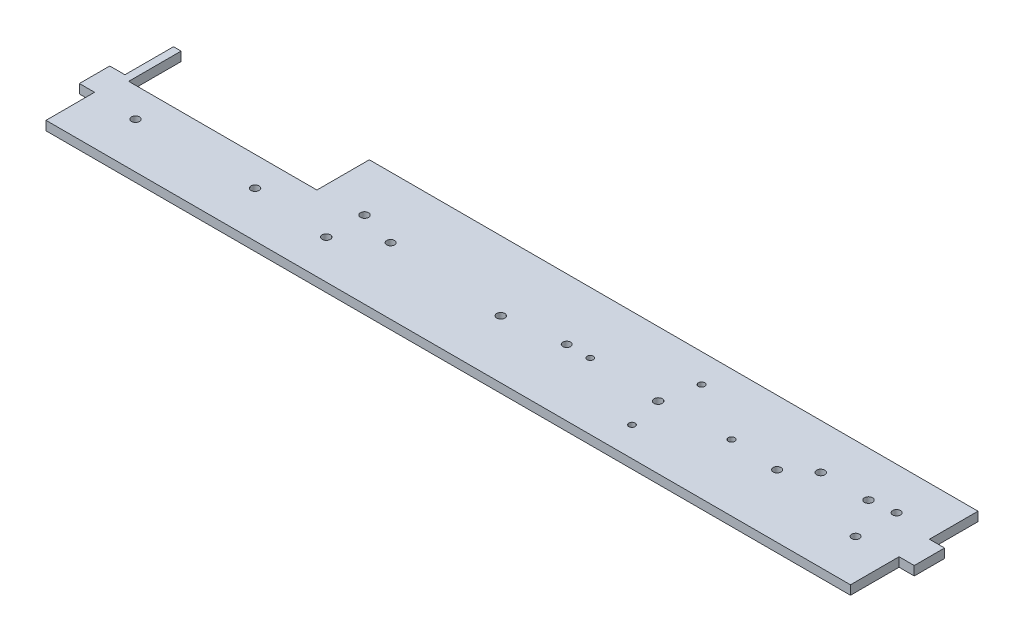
ISO-10303-21;
HEADER;
FILE_DESCRIPTION(('STEP AP214'),'2;1');
FILE_NAME('part.step','',(''),(''),'','','');
FILE_SCHEMA(('AUTOMOTIVE_DESIGN { 1 0 10303 214 1 1 1 1 }'));
ENDSEC;
DATA;
#1=APPLICATION_CONTEXT('core data for automotive mechanical design processes');
#2=APPLICATION_PROTOCOL_DEFINITION('international standard','automotive_design',2000,#1);
#3=PRODUCT_CONTEXT('',#1,'mechanical');
#4=PRODUCT('Part','Part','',(#3));
#5=PRODUCT_RELATED_PRODUCT_CATEGORY('part','',(#4));
#6=PRODUCT_DEFINITION_FORMATION('','',#4);
#7=PRODUCT_DEFINITION_CONTEXT('part definition',#1,'design');
#8=PRODUCT_DEFINITION('design','',#6,#7);
#9=PRODUCT_DEFINITION_SHAPE('','',#8);
#10=(LENGTH_UNIT() NAMED_UNIT(*) SI_UNIT(.MILLI.,.METRE.));
#11=(NAMED_UNIT(*) PLANE_ANGLE_UNIT() SI_UNIT($,.RADIAN.));
#12=(NAMED_UNIT(*) SI_UNIT($,.STERADIAN.) SOLID_ANGLE_UNIT());
#13=UNCERTAINTY_MEASURE_WITH_UNIT(LENGTH_MEASURE(1.E-05),#10,'distance_accuracy_value','');
#14=(GEOMETRIC_REPRESENTATION_CONTEXT(3) GLOBAL_UNCERTAINTY_ASSIGNED_CONTEXT((#13)) GLOBAL_UNIT_ASSIGNED_CONTEXT((#10,
#11,#12)) REPRESENTATION_CONTEXT('',''));
#15=CARTESIAN_POINT('',(0.,0.,0.));
#16=DIRECTION('',(0.,0.,1.));
#17=DIRECTION('',(1.,0.,0.));
#18=AXIS2_PLACEMENT_3D('',#15,#16,#17);
#19=CARTESIAN_POINT('',(-134.738932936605,14.9912284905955,-16.7074192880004));
#20=DIRECTION('',(0.,0.,1.));
#21=DIRECTION('',(0.,-1.,0.));
#22=AXIS2_PLACEMENT_3D('',#19,#20,#21);
#23=PLANE('',#22);
#24=DIRECTION('',(0.,1.,0.));
#25=VECTOR('',#24,1.);
#26=CARTESIAN_POINT('',(-131.563932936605,14.9912284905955,-16.7074192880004));
#27=LINE('',#26,#25);
#28=CARTESIAN_POINT('',(-131.563932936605,11.1812284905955,-16.7074192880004));
#29=VERTEX_POINT('',#28);
#30=CARTESIAN_POINT('',(-131.563932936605,14.9912284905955,-16.7074192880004));
#31=VERTEX_POINT('',#30);
#32=EDGE_CURVE('E171',#29,#31,#27,.T.);
#33=ORIENTED_EDGE('',*,*,#32,.F.);
#34=DIRECTION('',(-1.,0.,0.));
#35=VECTOR('',#34,1.);
#36=CARTESIAN_POINT('',(-134.738932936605,11.1812284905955,-16.7074192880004));
#37=LINE('',#36,#35);
#38=CARTESIAN_POINT('',(-134.738932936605,11.1812284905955,-16.7074192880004));
#39=VERTEX_POINT('',#38);
#40=EDGE_CURVE('E164',#29,#39,#37,.T.);
#41=ORIENTED_EDGE('',*,*,#40,.T.);
#42=DIRECTION('',(0.,-1.,0.));
#43=VECTOR('',#42,1.);
#44=CARTESIAN_POINT('',(-134.738932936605,14.9912284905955,-16.7074192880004));
#45=LINE('',#44,#43);
#46=CARTESIAN_POINT('',(-134.738932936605,14.9912284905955,-16.7074192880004));
#47=VERTEX_POINT('',#46);
#48=EDGE_CURVE('E37',#47,#39,#45,.T.);
#49=ORIENTED_EDGE('',*,*,#48,.F.);
#50=DIRECTION('',(-1.,0.,0.));
#51=VECTOR('',#50,1.);
#52=CARTESIAN_POINT('',(-134.738932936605,14.9912284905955,-16.7074192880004));
#53=LINE('',#52,#51);
#54=EDGE_CURVE('E198',#31,#47,#53,.T.);
#55=ORIENTED_EDGE('',*,*,#54,.F.);
#56=EDGE_LOOP('',(#33,#41,#49,#55));
#57=FACE_BOUND('',#56,.T.);
#58=ADVANCED_FACE('F30',(#57),#23,.F.);
#59=DIRECTION('',(0.,-1.,0.));
#60=VECTOR('',#59,1.);
#61=CARTESIAN_POINT('',(-52.8239329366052,14.9912284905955,-16.7074192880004));
#62=LINE('',#61,#60);
#63=CARTESIAN_POINT('',(-52.8239329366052,14.9912284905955,-16.7074192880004));
#64=VERTEX_POINT('',#63);
#65=CARTESIAN_POINT('',(-52.8239329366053,11.1812284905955,-16.7074192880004));
#66=VERTEX_POINT('',#65);
#67=EDGE_CURVE('E44',#64,#66,#62,.T.);
#68=ORIENTED_EDGE('',*,*,#67,.F.);
#69=CARTESIAN_POINT('',(201.811067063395,14.9912284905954,-16.7074192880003));
#70=VERTEX_POINT('',#69);
#71=EDGE_CURVE('E199',#70,#64,#53,.T.);
#72=ORIENTED_EDGE('',*,*,#71,.F.);
#73=DIRECTION('',(0.,-1.,0.));
#74=VECTOR('',#73,1.);
#75=CARTESIAN_POINT('',(201.811067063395,14.9912284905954,-16.7074192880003));
#76=LINE('',#75,#74);
#77=CARTESIAN_POINT('',(201.811067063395,11.1812284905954,-16.7074192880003));
#78=VERTEX_POINT('',#77);
#79=EDGE_CURVE('E222',#70,#78,#76,.T.);
#80=ORIENTED_EDGE('',*,*,#79,.T.);
#81=EDGE_CURVE('E170',#78,#66,#37,.T.);
#82=ORIENTED_EDGE('',*,*,#81,.T.);
#83=EDGE_LOOP('',(#68,#72,#80,#82));
#84=FACE_BOUND('',#83,.T.);
#85=ADVANCED_FACE('F271',(#84),#23,.F.);
#86=CARTESIAN_POINT('',(201.811067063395,14.9912284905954,-16.7074192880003));
#87=DIRECTION('',(0.,1.,0.));
#88=DIRECTION('',(1.,0.,0.));
#89=AXIS2_PLACEMENT_3D('',#86,#87,#88);
#90=PLANE('',#89);
#91=CARTESIAN_POINT('',(185.347985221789,14.9912284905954,18.0399650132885));
#92=DIRECTION('',(0.,1.,0.));
#93=DIRECTION('',(1.,0.,0.));
#94=AXIS2_PLACEMENT_3D('',#91,#92,#93);
#95=CIRCLE('',#94,1.63194999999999);
#96=CARTESIAN_POINT('',(186.979935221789,14.9912284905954,18.0399650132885));
#97=VERTEX_POINT('',#96);
#98=EDGE_CURVE('E640',#97,#97,#95,.T.);
#99=ORIENTED_EDGE('',*,*,#98,.F.);
#100=EDGE_LOOP('',(#99));
#101=FACE_BOUND('',#100,.T.);
#102=CARTESIAN_POINT('',(185.347985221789,14.9912284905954,0.894965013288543));
#103=DIRECTION('',(0.,1.,0.));
#104=DIRECTION('',(1.,0.,0.));
#105=AXIS2_PLACEMENT_3D('',#102,#103,#104);
#106=CIRCLE('',#105,1.63194999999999);
#107=CARTESIAN_POINT('',(186.979935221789,14.9912284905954,0.894965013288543));
#108=VERTEX_POINT('',#107);
#109=EDGE_CURVE('E642',#108,#108,#106,.T.);
#110=ORIENTED_EDGE('',*,*,#109,.F.);
#111=EDGE_LOOP('',(#110));
#112=FACE_BOUND('',#111,.T.);
#113=CARTESIAN_POINT('',(144.795562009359,14.9912284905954,10.3046123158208));
#114=DIRECTION('',(0.,1.,0.));
#115=DIRECTION('',(1.,0.,0.));
#116=AXIS2_PLACEMENT_3D('',#113,#114,#115);
#117=CIRCLE('',#116,1.65100000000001);
#118=CARTESIAN_POINT('',(146.446562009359,14.9912284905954,10.3046123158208));
#119=VERTEX_POINT('',#118);
#120=EDGE_CURVE('E650',#119,#119,#117,.T.);
#121=ORIENTED_EDGE('',*,*,#120,.F.);
#122=EDGE_LOOP('',(#121));
#123=FACE_BOUND('',#122,.T.);
#124=CARTESIAN_POINT('',(95.0348681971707,14.9912284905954,10.3046123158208));
#125=DIRECTION('',(0.,1.,0.));
#126=DIRECTION('',(1.,0.,0.));
#127=AXIS2_PLACEMENT_3D('',#124,#125,#126);
#128=CIRCLE('',#127,1.71922572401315);
#129=CARTESIAN_POINT('',(96.7540939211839,14.9912284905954,10.3046123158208));
#130=VERTEX_POINT('',#129);
#131=EDGE_CURVE('E656',#130,#130,#128,.T.);
#132=ORIENTED_EDGE('',*,*,#131,.F.);
#133=EDGE_LOOP('',(#132));
#134=FACE_BOUND('',#133,.T.);
#135=CARTESIAN_POINT('',(31.1985662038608,14.9912284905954,12.3209813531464));
#136=DIRECTION('',(0.,1.,0.));
#137=DIRECTION('',(1.,0.,0.));
#138=AXIS2_PLACEMENT_3D('',#135,#136,#137);
#139=CIRCLE('',#138,1.7);
#140=CARTESIAN_POINT('',(32.8985662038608,14.9912284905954,12.3209813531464));
#141=VERTEX_POINT('',#140);
#142=EDGE_CURVE('E662',#141,#141,#139,.T.);
#143=ORIENTED_EDGE('',*,*,#142,.F.);
#144=EDGE_LOOP('',(#143));
#145=FACE_BOUND('',#144,.T.);
#146=CARTESIAN_POINT('',(-33.8014337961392,14.9912284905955,20.3209813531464));
#147=DIRECTION('',(0.,1.,0.));
#148=DIRECTION('',(1.,0.,0.));
#149=AXIS2_PLACEMENT_3D('',#146,#147,#148);
#150=CIRCLE('',#149,1.69999999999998);
#151=CARTESIAN_POINT('',(-32.1014337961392,14.9912284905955,20.3209813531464));
#152=VERTEX_POINT('',#151);
#153=EDGE_CURVE('E668',#152,#152,#150,.T.);
#154=ORIENTED_EDGE('',*,*,#153,.F.);
#155=EDGE_LOOP('',(#154));
#156=FACE_BOUND('',#155,.T.);
#157=CARTESIAN_POINT('',(-33.8014337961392,14.9912284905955,4.32098135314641));
#158=DIRECTION('',(0.,1.,0.));
#159=DIRECTION('',(1.,0.,0.));
#160=AXIS2_PLACEMENT_3D('',#157,#158,#159);
#161=CIRCLE('',#160,1.69999999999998);
#162=CARTESIAN_POINT('',(-32.1014337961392,14.9912284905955,4.32098135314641));
#163=VERTEX_POINT('',#162);
#164=EDGE_CURVE('E674',#163,#163,#161,.T.);
#165=ORIENTED_EDGE('',*,*,#164,.F.);
#166=EDGE_LOOP('',(#165));
#167=FACE_BOUND('',#166,.T.);
#168=CARTESIAN_POINT('',(65.1684298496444,14.9912284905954,8.87224390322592));
#169=DIRECTION('',(0.,-1.,0.));
#170=DIRECTION('',(-1.,0.,0.));
#171=AXIS2_PLACEMENT_3D('',#168,#169,#170);
#172=CIRCLE('',#171,1.30920316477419);
#173=CARTESIAN_POINT('',(63.8592266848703,14.9912284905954,8.87224390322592));
#174=VERTEX_POINT('',#173);
#175=EDGE_CURVE('E683',#174,#174,#172,.T.);
#176=ORIENTED_EDGE('',*,*,#175,.T.);
#177=EDGE_LOOP('',(#176));
#178=FACE_BOUND('',#177,.T.);
#179=CARTESIAN_POINT('',(124.30545906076,14.9912284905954,8.87224390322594));
#180=DIRECTION('',(0.,-1.,0.));
#181=DIRECTION('',(-1.,0.,0.));
#182=AXIS2_PLACEMENT_3D('',#179,#180,#181);
#183=CIRCLE('',#182,1.37010252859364);
#184=CARTESIAN_POINT('',(122.935356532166,14.9912284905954,8.87224390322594));
#185=VERTEX_POINT('',#184);
#186=EDGE_CURVE('E689',#185,#185,#183,.T.);
#187=ORIENTED_EDGE('',*,*,#186,.T.);
#188=EDGE_LOOP('',(#187));
#189=FACE_BOUND('',#188,.T.);
#190=CARTESIAN_POINT('',(98.1392182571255,14.9912284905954,-4.73410946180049));
#191=DIRECTION('',(0.,-1.,0.));
#192=DIRECTION('',(-1.,0.,0.));
#193=AXIS2_PLACEMENT_3D('',#190,#191,#192);
#194=CIRCLE('',#193,1.34654167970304);
#195=CARTESIAN_POINT('',(96.7926765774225,14.9912284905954,-4.73410946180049));
#196=VERTEX_POINT('',#195);
#197=EDGE_CURVE('E695',#196,#196,#194,.T.);
#198=ORIENTED_EDGE('',*,*,#197,.T.);
#199=EDGE_LOOP('',(#198));
#200=FACE_BOUND('',#199,.T.);
#201=CARTESIAN_POINT('',(98.1392182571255,14.9912284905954,24.3916249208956));
#202=DIRECTION('',(0.,-1.,0.));
#203=DIRECTION('',(-1.,0.,0.));
#204=AXIS2_PLACEMENT_3D('',#201,#202,#203);
#205=CIRCLE('',#204,1.31995552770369);
#206=CARTESIAN_POINT('',(96.8192627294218,14.9912284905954,24.3916249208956));
#207=VERTEX_POINT('',#206);
#208=EDGE_CURVE('E701',#207,#207,#205,.T.);
#209=ORIENTED_EDGE('',*,*,#208,.T.);
#210=EDGE_LOOP('',(#209));
#211=FACE_BOUND('',#210,.T.);
#212=CARTESIAN_POINT('',(-116.426913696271,14.9912284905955,17.500169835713));
#213=DIRECTION('',(0.,-1.,0.));
#214=DIRECTION('',(-1.,0.,0.));
#215=AXIS2_PLACEMENT_3D('',#212,#213,#214);
#216=CIRCLE('',#215,1.69999999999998);
#217=CARTESIAN_POINT('',(-118.126913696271,14.9912284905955,17.500169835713));
#218=VERTEX_POINT('',#217);
#219=EDGE_CURVE('E707',#218,#218,#216,.T.);
#220=ORIENTED_EDGE('',*,*,#219,.T.);
#221=EDGE_LOOP('',(#220));
#222=FACE_BOUND('',#221,.T.);
#223=CARTESIAN_POINT('',(-66.4269136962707,14.9912284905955,17.500169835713));
#224=DIRECTION('',(0.,-1.,0.));
#225=DIRECTION('',(-1.,0.,0.));
#226=AXIS2_PLACEMENT_3D('',#223,#224,#225);
#227=CIRCLE('',#226,1.70000000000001);
#228=CARTESIAN_POINT('',(-68.1269136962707,14.9912284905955,17.500169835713));
#229=VERTEX_POINT('',#228);
#230=EDGE_CURVE('E713',#229,#229,#227,.T.);
#231=ORIENTED_EDGE('',*,*,#230,.T.);
#232=EDGE_LOOP('',(#231));
#233=FACE_BOUND('',#232,.T.);
#234=CARTESIAN_POINT('',(-18.3170596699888,14.9912284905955,8.87224390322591));
#235=DIRECTION('',(0.,-1.,0.));
#236=DIRECTION('',(-1.,0.,0.));
#237=AXIS2_PLACEMENT_3D('',#234,#235,#236);
#238=CIRCLE('',#237,1.63195);
#239=CARTESIAN_POINT('',(-19.9490096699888,14.9912284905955,8.87224390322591));
#240=VERTEX_POINT('',#239);
#241=EDGE_CURVE('E719',#240,#240,#238,.T.);
#242=ORIENTED_EDGE('',*,*,#241,.T.);
#243=EDGE_LOOP('',(#242));
#244=FACE_BOUND('',#243,.T.);
#245=CARTESIAN_POINT('',(55.3429403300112,14.9912284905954,8.87224390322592));
#246=DIRECTION('',(0.,-1.,0.));
#247=DIRECTION('',(-1.,0.,0.));
#248=AXIS2_PLACEMENT_3D('',#245,#246,#247);
#249=CIRCLE('',#248,1.63194999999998);
#250=CARTESIAN_POINT('',(53.7109903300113,14.9912284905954,8.87224390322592));
#251=VERTEX_POINT('',#250);
#252=EDGE_CURVE('E725',#251,#251,#249,.T.);
#253=ORIENTED_EDGE('',*,*,#252,.T.);
#254=EDGE_LOOP('',(#253));
#255=FACE_BOUND('',#254,.T.);
#256=CARTESIAN_POINT('',(154.879634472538,14.9912284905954,2.16956099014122));
#257=DIRECTION('',(0.,-1.,0.));
#258=DIRECTION('',(-1.,0.,0.));
#259=AXIS2_PLACEMENT_3D('',#256,#257,#258);
#260=CIRCLE('',#259,1.69999999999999);
#261=CARTESIAN_POINT('',(153.179634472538,14.9912284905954,2.16956099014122));
#262=VERTEX_POINT('',#261);
#263=EDGE_CURVE('E731',#262,#262,#260,.T.);
#264=ORIENTED_EDGE('',*,*,#263,.T.);
#265=EDGE_LOOP('',(#264));
#266=FACE_BOUND('',#265,.T.);
#267=CARTESIAN_POINT('',(174.879634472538,14.9912284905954,2.16956099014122));
#268=DIRECTION('',(0.,-1.,0.));
#269=DIRECTION('',(-1.,0.,0.));
#270=AXIS2_PLACEMENT_3D('',#267,#268,#269);
#271=CIRCLE('',#270,1.69999999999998);
#272=CARTESIAN_POINT('',(173.179634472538,14.9912284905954,2.16956099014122));
#273=VERTEX_POINT('',#272);
#274=EDGE_CURVE('E159',#273,#273,#271,.T.);
#275=ORIENTED_EDGE('',*,*,#274,.T.);
#276=EDGE_LOOP('',(#275));
#277=FACE_BOUND('',#276,.T.);
#278=DIRECTION('',(1.,0.,0.));
#279=VECTOR('',#278,1.);
#280=CARTESIAN_POINT('',(-131.563932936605,14.9912284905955,5.22010793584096));
#281=LINE('',#280,#279);
#282=CARTESIAN_POINT('',(-131.563932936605,14.9912284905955,5.22010793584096));
#283=VERTEX_POINT('',#282);
#284=CARTESIAN_POINT('',(-52.8239329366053,14.9912284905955,5.22010793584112));
#285=VERTEX_POINT('',#284);
#286=EDGE_CURVE('E261',#283,#285,#281,.T.);
#287=ORIENTED_EDGE('',*,*,#286,.F.);
#288=DIRECTION('',(0.,0.,1.));
#289=VECTOR('',#288,1.);
#290=CARTESIAN_POINT('',(-131.563932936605,14.9912284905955,-17.2507534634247));
#291=LINE('',#290,#289);
#292=EDGE_CURVE('E148',#31,#283,#291,.T.);
#293=ORIENTED_EDGE('',*,*,#292,.F.);
#294=ORIENTED_EDGE('',*,*,#54,.T.);
#295=DIRECTION('',(0.,0.,1.));
#296=VECTOR('',#295,1.);
#297=CARTESIAN_POINT('',(-134.738932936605,14.9912284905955,3.61258071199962));
#298=LINE('',#297,#296);
#299=CARTESIAN_POINT('',(-134.738932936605,14.9912284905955,3.61258071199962));
#300=VERTEX_POINT('',#299);
#301=EDGE_CURVE('E201',#47,#300,#298,.T.);
#302=ORIENTED_EDGE('',*,*,#301,.T.);
#303=DIRECTION('',(-1.,0.,0.));
#304=VECTOR('',#303,1.);
#305=CARTESIAN_POINT('',(-141.088932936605,14.9912284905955,3.61258071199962));
#306=LINE('',#305,#304);
#307=CARTESIAN_POINT('',(-141.088932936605,14.9912284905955,3.61258071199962));
#308=VERTEX_POINT('',#307);
#309=EDGE_CURVE('E203',#300,#308,#306,.T.);
#310=ORIENTED_EDGE('',*,*,#309,.T.);
#311=DIRECTION('',(0.,0.,1.));
#312=VECTOR('',#311,1.);
#313=CARTESIAN_POINT('',(-141.088932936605,14.9912284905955,3.61258071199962));
#314=LINE('',#313,#312);
#315=CARTESIAN_POINT('',(-141.088932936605,14.9912284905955,16.3125807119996));
#316=VERTEX_POINT('',#315);
#317=EDGE_CURVE('E205',#308,#316,#314,.T.);
#318=ORIENTED_EDGE('',*,*,#317,.T.);
#319=DIRECTION('',(1.,0.,0.));
#320=VECTOR('',#319,1.);
#321=CARTESIAN_POINT('',(-141.088932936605,14.9912284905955,16.3125807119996));
#322=LINE('',#321,#320);
#323=CARTESIAN_POINT('',(-134.738932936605,14.9912284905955,16.3125807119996));
#324=VERTEX_POINT('',#323);
#325=EDGE_CURVE('E207',#316,#324,#322,.T.);
#326=ORIENTED_EDGE('',*,*,#325,.T.);
#327=DIRECTION('',(0.,0.,1.));
#328=VECTOR('',#327,1.);
#329=CARTESIAN_POINT('',(-134.738932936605,14.9912284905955,16.3125807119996));
#330=LINE('',#329,#328);
#331=CARTESIAN_POINT('',(-134.738932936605,14.9912284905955,36.6325807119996));
#332=VERTEX_POINT('',#331);
#333=EDGE_CURVE('E209',#324,#332,#330,.T.);
#334=ORIENTED_EDGE('',*,*,#333,.T.);
#335=DIRECTION('',(1.,0.,0.));
#336=VECTOR('',#335,1.);
#337=CARTESIAN_POINT('',(-134.738932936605,14.9912284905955,36.6325807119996));
#338=LINE('',#337,#336);
#339=CARTESIAN_POINT('',(201.811067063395,14.9912284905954,36.6325807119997));
#340=VERTEX_POINT('',#339);
#341=EDGE_CURVE('E211',#332,#340,#338,.T.);
#342=ORIENTED_EDGE('',*,*,#341,.T.);
#343=DIRECTION('',(0.,0.,-1.));
#344=VECTOR('',#343,1.);
#345=CARTESIAN_POINT('',(201.811067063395,14.9912284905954,16.3125807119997));
#346=LINE('',#345,#344);
#347=CARTESIAN_POINT('',(201.811067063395,14.9912284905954,16.3125807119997));
#348=VERTEX_POINT('',#347);
#349=EDGE_CURVE('E213',#340,#348,#346,.T.);
#350=ORIENTED_EDGE('',*,*,#349,.T.);
#351=DIRECTION('',(1.,0.,0.));
#352=VECTOR('',#351,1.);
#353=CARTESIAN_POINT('',(201.811067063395,14.9912284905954,16.3125807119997));
#354=LINE('',#353,#352);
#355=CARTESIAN_POINT('',(208.161067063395,14.9912284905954,16.3125807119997));
#356=VERTEX_POINT('',#355);
#357=EDGE_CURVE('E215',#348,#356,#354,.T.);
#358=ORIENTED_EDGE('',*,*,#357,.T.);
#359=DIRECTION('',(0.,0.,-1.));
#360=VECTOR('',#359,1.);
#361=CARTESIAN_POINT('',(208.161067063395,14.9912284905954,3.61258071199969));
#362=LINE('',#361,#360);
#363=CARTESIAN_POINT('',(208.161067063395,14.9912284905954,3.61258071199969));
#364=VERTEX_POINT('',#363);
#365=EDGE_CURVE('E217',#356,#364,#362,.T.);
#366=ORIENTED_EDGE('',*,*,#365,.T.);
#367=DIRECTION('',(-1.,0.,0.));
#368=VECTOR('',#367,1.);
#369=CARTESIAN_POINT('',(201.811067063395,14.9912284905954,3.61258071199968));
#370=LINE('',#369,#368);
#371=CARTESIAN_POINT('',(201.811067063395,14.9912284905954,3.61258071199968));
#372=VERTEX_POINT('',#371);
#373=EDGE_CURVE('E219',#364,#372,#370,.T.);
#374=ORIENTED_EDGE('',*,*,#373,.T.);
#375=DIRECTION('',(0.,0.,-1.));
#376=VECTOR('',#375,1.);
#377=CARTESIAN_POINT('',(201.811067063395,14.9912284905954,3.61258071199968));
#378=LINE('',#377,#376);
#379=EDGE_CURVE('E52',#372,#70,#378,.T.);
#380=ORIENTED_EDGE('',*,*,#379,.T.);
#381=ORIENTED_EDGE('',*,*,#71,.T.);
#382=DIRECTION('',(0.,0.,-1.));
#383=VECTOR('',#382,1.);
#384=CARTESIAN_POINT('',(-52.8239329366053,14.9912284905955,5.22010793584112));
#385=LINE('',#384,#383);
#386=EDGE_CURVE('E263',#285,#64,#385,.T.);
#387=ORIENTED_EDGE('',*,*,#386,.F.);
#388=EDGE_LOOP('',(#287,#293,#294,#302,#310,#318,#326,#334,#342,#350,#358,#366,#374,#380,#381,#387));
#389=FACE_BOUND('',#388,.T.);
#390=ADVANCED_FACE('F259',(#101,#112,#123,#134,#145,#156,#167,#178,#189,#200,#211,#222,#233,
#244,#255,#266,#277,#389),#90,.T.);
#391=CARTESIAN_POINT('',(201.811067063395,11.1812284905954,-16.7074192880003));
#392=DIRECTION('',(0.,1.,0.));
#393=DIRECTION('',(1.,0.,0.));
#394=AXIS2_PLACEMENT_3D('',#391,#392,#393);
#395=PLANE('',#394);
#396=CARTESIAN_POINT('',(185.347985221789,11.1812284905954,18.0399650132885));
#397=DIRECTION('',(0.,1.,0.));
#398=DIRECTION('',(1.,0.,0.));
#399=AXIS2_PLACEMENT_3D('',#396,#397,#398);
#400=CIRCLE('',#399,1.63194999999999);
#401=CARTESIAN_POINT('',(186.979935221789,11.1812284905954,18.0399650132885));
#402=VERTEX_POINT('',#401);
#403=EDGE_CURVE('E638',#402,#402,#400,.T.);
#404=ORIENTED_EDGE('',*,*,#403,.T.);
#405=EDGE_LOOP('',(#404));
#406=FACE_BOUND('',#405,.T.);
#407=CARTESIAN_POINT('',(185.347985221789,11.1812284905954,0.894965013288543));
#408=DIRECTION('',(0.,1.,0.));
#409=DIRECTION('',(1.,0.,0.));
#410=AXIS2_PLACEMENT_3D('',#407,#408,#409);
#411=CIRCLE('',#410,1.63194999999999);
#412=CARTESIAN_POINT('',(186.979935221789,11.1812284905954,0.894965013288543));
#413=VERTEX_POINT('',#412);
#414=EDGE_CURVE('E647',#413,#413,#411,.T.);
#415=ORIENTED_EDGE('',*,*,#414,.T.);
#416=EDGE_LOOP('',(#415));
#417=FACE_BOUND('',#416,.T.);
#418=CARTESIAN_POINT('',(144.795562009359,11.1812284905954,10.3046123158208));
#419=DIRECTION('',(0.,1.,0.));
#420=DIRECTION('',(1.,0.,0.));
#421=AXIS2_PLACEMENT_3D('',#418,#419,#420);
#422=CIRCLE('',#421,1.65100000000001);
#423=CARTESIAN_POINT('',(146.446562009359,11.1812284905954,10.3046123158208));
#424=VERTEX_POINT('',#423);
#425=EDGE_CURVE('E653',#424,#424,#422,.T.);
#426=ORIENTED_EDGE('',*,*,#425,.T.);
#427=EDGE_LOOP('',(#426));
#428=FACE_BOUND('',#427,.T.);
#429=CARTESIAN_POINT('',(95.0348681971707,11.1812284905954,10.3046123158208));
#430=DIRECTION('',(0.,1.,0.));
#431=DIRECTION('',(1.,0.,0.));
#432=AXIS2_PLACEMENT_3D('',#429,#430,#431);
#433=CIRCLE('',#432,1.71922572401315);
#434=CARTESIAN_POINT('',(96.7540939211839,11.1812284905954,10.3046123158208));
#435=VERTEX_POINT('',#434);
#436=EDGE_CURVE('E659',#435,#435,#433,.T.);
#437=ORIENTED_EDGE('',*,*,#436,.T.);
#438=EDGE_LOOP('',(#437));
#439=FACE_BOUND('',#438,.T.);
#440=CARTESIAN_POINT('',(31.1985662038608,11.1812284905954,12.3209813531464));
#441=DIRECTION('',(0.,1.,0.));
#442=DIRECTION('',(1.,0.,0.));
#443=AXIS2_PLACEMENT_3D('',#440,#441,#442);
#444=CIRCLE('',#443,1.7);
#445=CARTESIAN_POINT('',(32.8985662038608,11.1812284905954,12.3209813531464));
#446=VERTEX_POINT('',#445);
#447=EDGE_CURVE('E665',#446,#446,#444,.T.);
#448=ORIENTED_EDGE('',*,*,#447,.T.);
#449=EDGE_LOOP('',(#448));
#450=FACE_BOUND('',#449,.T.);
#451=CARTESIAN_POINT('',(-33.8014337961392,11.1812284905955,20.3209813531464));
#452=DIRECTION('',(0.,1.,0.));
#453=DIRECTION('',(1.,0.,0.));
#454=AXIS2_PLACEMENT_3D('',#451,#452,#453);
#455=CIRCLE('',#454,1.69999999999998);
#456=CARTESIAN_POINT('',(-32.1014337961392,11.1812284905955,20.3209813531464));
#457=VERTEX_POINT('',#456);
#458=EDGE_CURVE('E671',#457,#457,#455,.T.);
#459=ORIENTED_EDGE('',*,*,#458,.T.);
#460=EDGE_LOOP('',(#459));
#461=FACE_BOUND('',#460,.T.);
#462=CARTESIAN_POINT('',(-33.8014337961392,11.1812284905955,4.32098135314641));
#463=DIRECTION('',(0.,1.,0.));
#464=DIRECTION('',(1.,0.,0.));
#465=AXIS2_PLACEMENT_3D('',#462,#463,#464);
#466=CIRCLE('',#465,1.69999999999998);
#467=CARTESIAN_POINT('',(-32.1014337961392,11.1812284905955,4.32098135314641));
#468=VERTEX_POINT('',#467);
#469=EDGE_CURVE('E677',#468,#468,#466,.T.);
#470=ORIENTED_EDGE('',*,*,#469,.T.);
#471=EDGE_LOOP('',(#470));
#472=FACE_BOUND('',#471,.T.);
#473=CARTESIAN_POINT('',(65.1684298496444,11.1812284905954,8.87224390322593));
#474=DIRECTION('',(0.,-1.,0.));
#475=DIRECTION('',(-1.,0.,0.));
#476=AXIS2_PLACEMENT_3D('',#473,#474,#475);
#477=CIRCLE('',#476,1.30920316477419);
#478=CARTESIAN_POINT('',(63.8592266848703,11.1812284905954,8.87224390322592));
#479=VERTEX_POINT('',#478);
#480=EDGE_CURVE('E680',#479,#479,#477,.T.);
#481=ORIENTED_EDGE('',*,*,#480,.F.);
#482=EDGE_LOOP('',(#481));
#483=FACE_BOUND('',#482,.T.);
#484=CARTESIAN_POINT('',(124.30545906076,11.1812284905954,8.87224390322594));
#485=DIRECTION('',(0.,-1.,0.));
#486=DIRECTION('',(-1.,0.,0.));
#487=AXIS2_PLACEMENT_3D('',#484,#485,#486);
#488=CIRCLE('',#487,1.37010252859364);
#489=CARTESIAN_POINT('',(122.935356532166,11.1812284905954,8.87224390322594));
#490=VERTEX_POINT('',#489);
#491=EDGE_CURVE('E686',#490,#490,#488,.T.);
#492=ORIENTED_EDGE('',*,*,#491,.F.);
#493=EDGE_LOOP('',(#492));
#494=FACE_BOUND('',#493,.T.);
#495=CARTESIAN_POINT('',(98.1392182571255,11.1812284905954,-4.73410946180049));
#496=DIRECTION('',(0.,-1.,0.));
#497=DIRECTION('',(-1.,0.,0.));
#498=AXIS2_PLACEMENT_3D('',#495,#496,#497);
#499=CIRCLE('',#498,1.34654167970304);
#500=CARTESIAN_POINT('',(96.7926765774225,11.1812284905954,-4.73410946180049));
#501=VERTEX_POINT('',#500);
#502=EDGE_CURVE('E692',#501,#501,#499,.T.);
#503=ORIENTED_EDGE('',*,*,#502,.F.);
#504=EDGE_LOOP('',(#503));
#505=FACE_BOUND('',#504,.T.);
#506=CARTESIAN_POINT('',(98.1392182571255,11.1812284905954,24.3916249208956));
#507=DIRECTION('',(0.,-1.,0.));
#508=DIRECTION('',(-1.,0.,0.));
#509=AXIS2_PLACEMENT_3D('',#506,#507,#508);
#510=CIRCLE('',#509,1.31995552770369);
#511=CARTESIAN_POINT('',(96.8192627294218,11.1812284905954,24.3916249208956));
#512=VERTEX_POINT('',#511);
#513=EDGE_CURVE('E698',#512,#512,#510,.T.);
#514=ORIENTED_EDGE('',*,*,#513,.F.);
#515=EDGE_LOOP('',(#514));
#516=FACE_BOUND('',#515,.T.);
#517=CARTESIAN_POINT('',(-116.426913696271,11.1812284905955,17.500169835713));
#518=DIRECTION('',(0.,-1.,0.));
#519=DIRECTION('',(-1.,0.,0.));
#520=AXIS2_PLACEMENT_3D('',#517,#518,#519);
#521=CIRCLE('',#520,1.69999999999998);
#522=CARTESIAN_POINT('',(-118.126913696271,11.1812284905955,17.500169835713));
#523=VERTEX_POINT('',#522);
#524=EDGE_CURVE('E704',#523,#523,#521,.T.);
#525=ORIENTED_EDGE('',*,*,#524,.F.);
#526=EDGE_LOOP('',(#525));
#527=FACE_BOUND('',#526,.T.);
#528=CARTESIAN_POINT('',(-66.4269136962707,11.1812284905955,17.500169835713));
#529=DIRECTION('',(0.,-1.,0.));
#530=DIRECTION('',(-1.,0.,0.));
#531=AXIS2_PLACEMENT_3D('',#528,#529,#530);
#532=CIRCLE('',#531,1.70000000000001);
#533=CARTESIAN_POINT('',(-68.1269136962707,11.1812284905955,17.500169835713));
#534=VERTEX_POINT('',#533);
#535=EDGE_CURVE('E710',#534,#534,#532,.T.);
#536=ORIENTED_EDGE('',*,*,#535,.F.);
#537=EDGE_LOOP('',(#536));
#538=FACE_BOUND('',#537,.T.);
#539=CARTESIAN_POINT('',(-18.3170596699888,11.1812284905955,8.87224390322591));
#540=DIRECTION('',(0.,-1.,0.));
#541=DIRECTION('',(-1.,0.,0.));
#542=AXIS2_PLACEMENT_3D('',#539,#540,#541);
#543=CIRCLE('',#542,1.63195);
#544=CARTESIAN_POINT('',(-19.9490096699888,11.1812284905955,8.87224390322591));
#545=VERTEX_POINT('',#544);
#546=EDGE_CURVE('E716',#545,#545,#543,.T.);
#547=ORIENTED_EDGE('',*,*,#546,.F.);
#548=EDGE_LOOP('',(#547));
#549=FACE_BOUND('',#548,.T.);
#550=CARTESIAN_POINT('',(55.3429403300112,11.1812284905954,8.87224390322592));
#551=DIRECTION('',(0.,-1.,0.));
#552=DIRECTION('',(-1.,0.,0.));
#553=AXIS2_PLACEMENT_3D('',#550,#551,#552);
#554=CIRCLE('',#553,1.63194999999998);
#555=CARTESIAN_POINT('',(53.7109903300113,11.1812284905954,8.87224390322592));
#556=VERTEX_POINT('',#555);
#557=EDGE_CURVE('E722',#556,#556,#554,.T.);
#558=ORIENTED_EDGE('',*,*,#557,.F.);
#559=EDGE_LOOP('',(#558));
#560=FACE_BOUND('',#559,.T.);
#561=CARTESIAN_POINT('',(154.879634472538,11.1812284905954,2.16956099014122));
#562=DIRECTION('',(0.,-1.,0.));
#563=DIRECTION('',(-1.,0.,0.));
#564=AXIS2_PLACEMENT_3D('',#561,#562,#563);
#565=CIRCLE('',#564,1.69999999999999);
#566=CARTESIAN_POINT('',(153.179634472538,11.1812284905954,2.16956099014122));
#567=VERTEX_POINT('',#566);
#568=EDGE_CURVE('E728',#567,#567,#565,.T.);
#569=ORIENTED_EDGE('',*,*,#568,.F.);
#570=EDGE_LOOP('',(#569));
#571=FACE_BOUND('',#570,.T.);
#572=CARTESIAN_POINT('',(174.879634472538,11.1812284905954,2.16956099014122));
#573=DIRECTION('',(0.,-1.,0.));
#574=DIRECTION('',(-1.,0.,0.));
#575=AXIS2_PLACEMENT_3D('',#572,#573,#574);
#576=CIRCLE('',#575,1.69999999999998);
#577=CARTESIAN_POINT('',(173.179634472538,11.1812284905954,2.16956099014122));
#578=VERTEX_POINT('',#577);
#579=EDGE_CURVE('E734',#578,#578,#576,.T.);
#580=ORIENTED_EDGE('',*,*,#579,.F.);
#581=EDGE_LOOP('',(#580));
#582=FACE_BOUND('',#581,.T.);
#583=DIRECTION('',(0.,0.,-1.));
#584=VECTOR('',#583,1.);
#585=CARTESIAN_POINT('',(-131.563932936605,11.1812284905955,-16.7074192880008));
#586=LINE('',#585,#584);
#587=CARTESIAN_POINT('',(-131.563932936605,11.1812284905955,5.22010793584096));
#588=VERTEX_POINT('',#587);
#589=EDGE_CURVE('E11',#588,#29,#586,.T.);
#590=ORIENTED_EDGE('',*,*,#589,.F.);
#591=DIRECTION('',(1.,0.,0.));
#592=VECTOR('',#591,1.);
#593=CARTESIAN_POINT('',(-131.563932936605,11.1812284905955,5.22010793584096));
#594=LINE('',#593,#592);
#595=CARTESIAN_POINT('',(-52.8239329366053,11.1812284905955,5.22010793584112));
#596=VERTEX_POINT('',#595);
#597=EDGE_CURVE('E154',#588,#596,#594,.T.);
#598=ORIENTED_EDGE('',*,*,#597,.T.);
#599=DIRECTION('',(0.,0.,-1.));
#600=VECTOR('',#599,1.);
#601=CARTESIAN_POINT('',(-52.8239329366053,11.1812284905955,5.22010793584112));
#602=LINE('',#601,#600);
#603=EDGE_CURVE('E158',#596,#66,#602,.T.);
#604=ORIENTED_EDGE('',*,*,#603,.T.);
#605=ORIENTED_EDGE('',*,*,#81,.F.);
#606=DIRECTION('',(0.,0.,-1.));
#607=VECTOR('',#606,1.);
#608=CARTESIAN_POINT('',(201.811067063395,11.1812284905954,3.61258071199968));
#609=LINE('',#608,#607);
#610=CARTESIAN_POINT('',(201.811067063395,11.1812284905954,3.61258071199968));
#611=VERTEX_POINT('',#610);
#612=EDGE_CURVE('E196',#611,#78,#609,.T.);
#613=ORIENTED_EDGE('',*,*,#612,.F.);
#614=DIRECTION('',(-1.,0.,0.));
#615=VECTOR('',#614,1.);
#616=CARTESIAN_POINT('',(201.811067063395,11.1812284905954,3.61258071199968));
#617=LINE('',#616,#615);
#618=CARTESIAN_POINT('',(208.161067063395,11.1812284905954,3.61258071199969));
#619=VERTEX_POINT('',#618);
#620=EDGE_CURVE('E194',#619,#611,#617,.T.);
#621=ORIENTED_EDGE('',*,*,#620,.F.);
#622=DIRECTION('',(0.,0.,-1.));
#623=VECTOR('',#622,1.);
#624=CARTESIAN_POINT('',(208.161067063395,11.1812284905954,3.61258071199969));
#625=LINE('',#624,#623);
#626=CARTESIAN_POINT('',(208.161067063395,11.1812284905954,16.3125807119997));
#627=VERTEX_POINT('',#626);
#628=EDGE_CURVE('E192',#627,#619,#625,.T.);
#629=ORIENTED_EDGE('',*,*,#628,.F.);
#630=DIRECTION('',(1.,0.,0.));
#631=VECTOR('',#630,1.);
#632=CARTESIAN_POINT('',(201.811067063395,11.1812284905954,16.3125807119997));
#633=LINE('',#632,#631);
#634=CARTESIAN_POINT('',(201.811067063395,11.1812284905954,16.3125807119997));
#635=VERTEX_POINT('',#634);
#636=EDGE_CURVE('E190',#635,#627,#633,.T.);
#637=ORIENTED_EDGE('',*,*,#636,.F.);
#638=DIRECTION('',(0.,0.,-1.));
#639=VECTOR('',#638,1.);
#640=CARTESIAN_POINT('',(201.811067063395,11.1812284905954,16.3125807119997));
#641=LINE('',#640,#639);
#642=CARTESIAN_POINT('',(201.811067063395,11.1812284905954,36.6325807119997));
#643=VERTEX_POINT('',#642);
#644=EDGE_CURVE('E188',#643,#635,#641,.T.);
#645=ORIENTED_EDGE('',*,*,#644,.F.);
#646=DIRECTION('',(1.,0.,0.));
#647=VECTOR('',#646,1.);
#648=CARTESIAN_POINT('',(-134.738932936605,11.1812284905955,36.6325807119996));
#649=LINE('',#648,#647);
#650=CARTESIAN_POINT('',(-134.738932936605,11.1812284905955,36.6325807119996));
#651=VERTEX_POINT('',#650);
#652=EDGE_CURVE('E186',#651,#643,#649,.T.);
#653=ORIENTED_EDGE('',*,*,#652,.F.);
#654=DIRECTION('',(0.,0.,1.));
#655=VECTOR('',#654,1.);
#656=CARTESIAN_POINT('',(-134.738932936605,11.1812284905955,16.3125807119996));
#657=LINE('',#656,#655);
#658=CARTESIAN_POINT('',(-134.738932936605,11.1812284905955,16.3125807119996));
#659=VERTEX_POINT('',#658);
#660=EDGE_CURVE('E184',#659,#651,#657,.T.);
#661=ORIENTED_EDGE('',*,*,#660,.F.);
#662=DIRECTION('',(1.,0.,0.));
#663=VECTOR('',#662,1.);
#664=CARTESIAN_POINT('',(-141.088932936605,11.1812284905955,16.3125807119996));
#665=LINE('',#664,#663);
#666=CARTESIAN_POINT('',(-141.088932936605,11.1812284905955,16.3125807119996));
#667=VERTEX_POINT('',#666);
#668=EDGE_CURVE('E182',#667,#659,#665,.T.);
#669=ORIENTED_EDGE('',*,*,#668,.F.);
#670=DIRECTION('',(0.,0.,1.));
#671=VECTOR('',#670,1.);
#672=CARTESIAN_POINT('',(-141.088932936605,11.1812284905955,3.61258071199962));
#673=LINE('',#672,#671);
#674=CARTESIAN_POINT('',(-141.088932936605,11.1812284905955,3.61258071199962));
#675=VERTEX_POINT('',#674);
#676=EDGE_CURVE('E180',#675,#667,#673,.T.);
#677=ORIENTED_EDGE('',*,*,#676,.F.);
#678=DIRECTION('',(-1.,0.,0.));
#679=VECTOR('',#678,1.);
#680=CARTESIAN_POINT('',(-141.088932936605,11.1812284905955,3.61258071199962));
#681=LINE('',#680,#679);
#682=CARTESIAN_POINT('',(-134.738932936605,11.1812284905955,3.61258071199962));
#683=VERTEX_POINT('',#682);
#684=EDGE_CURVE('E178',#683,#675,#681,.T.);
#685=ORIENTED_EDGE('',*,*,#684,.F.);
#686=DIRECTION('',(0.,0.,1.));
#687=VECTOR('',#686,1.);
#688=CARTESIAN_POINT('',(-134.738932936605,11.1812284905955,3.61258071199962));
#689=LINE('',#688,#687);
#690=EDGE_CURVE('E166',#39,#683,#689,.T.);
#691=ORIENTED_EDGE('',*,*,#690,.F.);
#692=ORIENTED_EDGE('',*,*,#40,.F.);
#693=EDGE_LOOP('',(#590,#598,#604,#605,#613,#621,#629,#637,#645,#653,#661,#669,#677,#685,#691,#692));
#694=FACE_BOUND('',#693,.T.);
#695=ADVANCED_FACE('F162',(#406,#417,#428,#439,#450,#461,#472,#483,#494,#505,#516,#527,#538,
#549,#560,#571,#582,#694),#395,.F.);
#696=CARTESIAN_POINT('',(-134.738932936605,14.9912284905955,3.61258071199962));
#697=DIRECTION('',(1.,0.,0.));
#698=DIRECTION('',(0.,-1.,0.));
#699=AXIS2_PLACEMENT_3D('',#696,#697,#698);
#700=PLANE('',#699);
#701=ORIENTED_EDGE('',*,*,#690,.T.);
#702=DIRECTION('',(0.,-1.,0.));
#703=VECTOR('',#702,1.);
#704=CARTESIAN_POINT('',(-134.738932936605,14.9912284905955,3.61258071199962));
#705=LINE('',#704,#703);
#706=EDGE_CURVE('E252',#300,#683,#705,.T.);
#707=ORIENTED_EDGE('',*,*,#706,.F.);
#708=ORIENTED_EDGE('',*,*,#301,.F.);
#709=ORIENTED_EDGE('',*,*,#48,.T.);
#710=EDGE_LOOP('',(#701,#707,#708,#709));
#711=FACE_BOUND('',#710,.T.);
#712=ADVANCED_FACE('F256',(#711),#700,.F.);
#713=CARTESIAN_POINT('',(-141.088932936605,14.9912284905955,3.61258071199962));
#714=DIRECTION('',(0.,0.,1.));
#715=DIRECTION('',(0.,-1.,0.));
#716=AXIS2_PLACEMENT_3D('',#713,#714,#715);
#717=PLANE('',#716);
#718=ORIENTED_EDGE('',*,*,#684,.T.);
#719=DIRECTION('',(0.,-1.,0.));
#720=VECTOR('',#719,1.);
#721=CARTESIAN_POINT('',(-141.088932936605,14.9912284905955,3.61258071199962));
#722=LINE('',#721,#720);
#723=EDGE_CURVE('E249',#308,#675,#722,.T.);
#724=ORIENTED_EDGE('',*,*,#723,.F.);
#725=ORIENTED_EDGE('',*,*,#309,.F.);
#726=ORIENTED_EDGE('',*,*,#706,.T.);
#727=EDGE_LOOP('',(#718,#724,#725,#726));
#728=FACE_BOUND('',#727,.T.);
#729=ADVANCED_FACE('F318',(#728),#717,.F.);
#730=CARTESIAN_POINT('',(-141.088932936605,14.9912284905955,3.61258071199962));
#731=DIRECTION('',(1.,0.,0.));
#732=DIRECTION('',(0.,-1.,0.));
#733=AXIS2_PLACEMENT_3D('',#730,#731,#732);
#734=PLANE('',#733);
#735=ORIENTED_EDGE('',*,*,#676,.T.);
#736=DIRECTION('',(0.,-1.,0.));
#737=VECTOR('',#736,1.);
#738=CARTESIAN_POINT('',(-141.088932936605,14.9912284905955,16.3125807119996));
#739=LINE('',#738,#737);
#740=EDGE_CURVE('E246',#316,#667,#739,.T.);
#741=ORIENTED_EDGE('',*,*,#740,.F.);
#742=ORIENTED_EDGE('',*,*,#317,.F.);
#743=ORIENTED_EDGE('',*,*,#723,.T.);
#744=EDGE_LOOP('',(#735,#741,#742,#743));
#745=FACE_BOUND('',#744,.T.);
#746=ADVANCED_FACE('F315',(#745),#734,.F.);
#747=CARTESIAN_POINT('',(-141.088932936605,14.9912284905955,16.3125807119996));
#748=DIRECTION('',(0.,0.,-1.));
#749=DIRECTION('',(0.,1.,0.));
#750=AXIS2_PLACEMENT_3D('',#747,#748,#749);
#751=PLANE('',#750);
#752=ORIENTED_EDGE('',*,*,#668,.T.);
#753=DIRECTION('',(0.,-1.,0.));
#754=VECTOR('',#753,1.);
#755=CARTESIAN_POINT('',(-134.738932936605,14.9912284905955,16.3125807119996));
#756=LINE('',#755,#754);
#757=EDGE_CURVE('E243',#324,#659,#756,.T.);
#758=ORIENTED_EDGE('',*,*,#757,.F.);
#759=ORIENTED_EDGE('',*,*,#325,.F.);
#760=ORIENTED_EDGE('',*,*,#740,.T.);
#761=EDGE_LOOP('',(#752,#758,#759,#760));
#762=FACE_BOUND('',#761,.T.);
#763=ADVANCED_FACE('F311',(#762),#751,.F.);
#764=CARTESIAN_POINT('',(-134.738932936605,14.9912284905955,16.3125807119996));
#765=DIRECTION('',(1.,0.,0.));
#766=DIRECTION('',(0.,-1.,0.));
#767=AXIS2_PLACEMENT_3D('',#764,#765,#766);
#768=PLANE('',#767);
#769=ORIENTED_EDGE('',*,*,#660,.T.);
#770=DIRECTION('',(0.,-1.,0.));
#771=VECTOR('',#770,1.);
#772=CARTESIAN_POINT('',(-134.738932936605,14.9912284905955,36.6325807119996));
#773=LINE('',#772,#771);
#774=EDGE_CURVE('E240',#332,#651,#773,.T.);
#775=ORIENTED_EDGE('',*,*,#774,.F.);
#776=ORIENTED_EDGE('',*,*,#333,.F.);
#777=ORIENTED_EDGE('',*,*,#757,.T.);
#778=EDGE_LOOP('',(#769,#775,#776,#777));
#779=FACE_BOUND('',#778,.T.);
#780=ADVANCED_FACE('F306',(#779),#768,.F.);
#781=CARTESIAN_POINT('',(-134.738932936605,14.9912284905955,36.6325807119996));
#782=DIRECTION('',(0.,0.,-1.));
#783=DIRECTION('',(-1.,0.,0.));
#784=AXIS2_PLACEMENT_3D('',#781,#782,#783);
#785=PLANE('',#784);
#786=ORIENTED_EDGE('',*,*,#652,.T.);
#787=DIRECTION('',(0.,-1.,0.));
#788=VECTOR('',#787,1.);
#789=CARTESIAN_POINT('',(201.811067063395,14.9912284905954,36.6325807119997));
#790=LINE('',#789,#788);
#791=EDGE_CURVE('E237',#340,#643,#790,.T.);
#792=ORIENTED_EDGE('',*,*,#791,.F.);
#793=ORIENTED_EDGE('',*,*,#341,.F.);
#794=ORIENTED_EDGE('',*,*,#774,.T.);
#795=EDGE_LOOP('',(#786,#792,#793,#794));
#796=FACE_BOUND('',#795,.T.);
#797=ADVANCED_FACE('F300',(#796),#785,.F.);
#798=CARTESIAN_POINT('',(201.811067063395,14.9912284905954,16.3125807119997));
#799=DIRECTION('',(-1.,0.,0.));
#800=DIRECTION('',(0.,0.,1.));
#801=AXIS2_PLACEMENT_3D('',#798,#799,#800);
#802=PLANE('',#801);
#803=ORIENTED_EDGE('',*,*,#644,.T.);
#804=DIRECTION('',(0.,-1.,0.));
#805=VECTOR('',#804,1.);
#806=CARTESIAN_POINT('',(201.811067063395,14.9912284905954,16.3125807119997));
#807=LINE('',#806,#805);
#808=EDGE_CURVE('E234',#348,#635,#807,.T.);
#809=ORIENTED_EDGE('',*,*,#808,.F.);
#810=ORIENTED_EDGE('',*,*,#349,.F.);
#811=ORIENTED_EDGE('',*,*,#791,.T.);
#812=EDGE_LOOP('',(#803,#809,#810,#811));
#813=FACE_BOUND('',#812,.T.);
#814=ADVANCED_FACE('F296',(#813),#802,.F.);
#815=CARTESIAN_POINT('',(201.811067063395,14.9912284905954,16.3125807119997));
#816=DIRECTION('',(0.,0.,-1.));
#817=DIRECTION('',(-1.,0.,0.));
#818=AXIS2_PLACEMENT_3D('',#815,#816,#817);
#819=PLANE('',#818);
#820=ORIENTED_EDGE('',*,*,#636,.T.);
#821=DIRECTION('',(0.,-1.,0.));
#822=VECTOR('',#821,1.);
#823=CARTESIAN_POINT('',(208.161067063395,14.9912284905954,16.3125807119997));
#824=LINE('',#823,#822);
#825=EDGE_CURVE('E231',#356,#627,#824,.T.);
#826=ORIENTED_EDGE('',*,*,#825,.F.);
#827=ORIENTED_EDGE('',*,*,#357,.F.);
#828=ORIENTED_EDGE('',*,*,#808,.T.);
#829=EDGE_LOOP('',(#820,#826,#827,#828));
#830=FACE_BOUND('',#829,.T.);
#831=ADVANCED_FACE('F291',(#830),#819,.F.);
#832=CARTESIAN_POINT('',(208.161067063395,14.9912284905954,3.61258071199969));
#833=DIRECTION('',(-1.,0.,0.));
#834=DIRECTION('',(0.,1.,0.));
#835=AXIS2_PLACEMENT_3D('',#832,#833,#834);
#836=PLANE('',#835);
#837=ORIENTED_EDGE('',*,*,#628,.T.);
#838=DIRECTION('',(0.,-1.,0.));
#839=VECTOR('',#838,1.);
#840=CARTESIAN_POINT('',(208.161067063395,14.9912284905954,3.61258071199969));
#841=LINE('',#840,#839);
#842=EDGE_CURVE('E228',#364,#619,#841,.T.);
#843=ORIENTED_EDGE('',*,*,#842,.F.);
#844=ORIENTED_EDGE('',*,*,#365,.F.);
#845=ORIENTED_EDGE('',*,*,#825,.T.);
#846=EDGE_LOOP('',(#837,#843,#844,#845));
#847=FACE_BOUND('',#846,.T.);
#848=ADVANCED_FACE('F285',(#847),#836,.F.);
#849=CARTESIAN_POINT('',(201.811067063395,14.9912284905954,3.61258071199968));
#850=DIRECTION('',(0.,0.,1.));
#851=DIRECTION('',(0.,-1.,0.));
#852=AXIS2_PLACEMENT_3D('',#849,#850,#851);
#853=PLANE('',#852);
#854=ORIENTED_EDGE('',*,*,#620,.T.);
#855=DIRECTION('',(0.,-1.,0.));
#856=VECTOR('',#855,1.);
#857=CARTESIAN_POINT('',(201.811067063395,14.9912284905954,3.61258071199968));
#858=LINE('',#857,#856);
#859=EDGE_CURVE('E225',#372,#611,#858,.T.);
#860=ORIENTED_EDGE('',*,*,#859,.F.);
#861=ORIENTED_EDGE('',*,*,#373,.F.);
#862=ORIENTED_EDGE('',*,*,#842,.T.);
#863=EDGE_LOOP('',(#854,#860,#861,#862));
#864=FACE_BOUND('',#863,.T.);
#865=ADVANCED_FACE('F281',(#864),#853,.F.);
#866=CARTESIAN_POINT('',(201.811067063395,14.9912284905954,3.61258071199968));
#867=DIRECTION('',(-1.,0.,0.));
#868=DIRECTION('',(0.,1.,0.));
#869=AXIS2_PLACEMENT_3D('',#866,#867,#868);
#870=PLANE('',#869);
#871=ORIENTED_EDGE('',*,*,#612,.T.);
#872=ORIENTED_EDGE('',*,*,#79,.F.);
#873=ORIENTED_EDGE('',*,*,#379,.F.);
#874=ORIENTED_EDGE('',*,*,#859,.T.);
#875=EDGE_LOOP('',(#871,#872,#873,#874));
#876=FACE_BOUND('',#875,.T.);
#877=ADVANCED_FACE('F277',(#876),#870,.F.);
#878=CARTESIAN_POINT('',(-131.563932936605,14.9912284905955,-17.2507534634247));
#879=DIRECTION('',(1.,0.,0.));
#880=DIRECTION('',(0.,0.,-1.));
#881=AXIS2_PLACEMENT_3D('',#878,#879,#880);
#882=PLANE('',#881);
#883=ORIENTED_EDGE('',*,*,#32,.T.);
#884=ORIENTED_EDGE('',*,*,#292,.T.);
#885=DIRECTION('',(0.,-1.,0.));
#886=VECTOR('',#885,1.);
#887=CARTESIAN_POINT('',(-131.563932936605,14.9912284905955,5.22010793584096));
#888=LINE('',#887,#886);
#889=EDGE_CURVE('E142',#283,#588,#888,.T.);
#890=ORIENTED_EDGE('',*,*,#889,.T.);
#891=ORIENTED_EDGE('',*,*,#589,.T.);
#892=EDGE_LOOP('',(#883,#884,#890,#891));
#893=FACE_BOUND('',#892,.T.);
#894=ADVANCED_FACE('F144',(#893),#882,.T.);
#895=CARTESIAN_POINT('',(-52.8239329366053,14.9912284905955,5.22010793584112));
#896=DIRECTION('',(-1.,0.,0.));
#897=DIRECTION('',(0.,0.,1.));
#898=AXIS2_PLACEMENT_3D('',#895,#896,#897);
#899=PLANE('',#898);
#900=ORIENTED_EDGE('',*,*,#67,.T.);
#901=ORIENTED_EDGE('',*,*,#603,.F.);
#902=DIRECTION('',(0.,-1.,0.));
#903=VECTOR('',#902,1.);
#904=CARTESIAN_POINT('',(-52.8239329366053,14.9912284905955,5.22010793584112));
#905=LINE('',#904,#903);
#906=EDGE_CURVE('E151',#285,#596,#905,.T.);
#907=ORIENTED_EDGE('',*,*,#906,.F.);
#908=ORIENTED_EDGE('',*,*,#386,.T.);
#909=EDGE_LOOP('',(#900,#901,#907,#908));
#910=FACE_BOUND('',#909,.T.);
#911=ADVANCED_FACE('F268',(#910),#899,.T.);
#912=CARTESIAN_POINT('',(-131.563932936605,14.9912284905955,5.22010793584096));
#913=DIRECTION('',(0.,0.,-1.));
#914=DIRECTION('',(-1.,0.,0.));
#915=AXIS2_PLACEMENT_3D('',#912,#913,#914);
#916=PLANE('',#915);
#917=ORIENTED_EDGE('',*,*,#597,.F.);
#918=ORIENTED_EDGE('',*,*,#889,.F.);
#919=ORIENTED_EDGE('',*,*,#286,.T.);
#920=ORIENTED_EDGE('',*,*,#906,.T.);
#921=EDGE_LOOP('',(#917,#918,#919,#920));
#922=FACE_BOUND('',#921,.T.);
#923=ADVANCED_FACE('F155',(#922),#916,.T.);
#924=CARTESIAN_POINT('',(174.879634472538,14.9912284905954,2.16956099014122));
#925=DIRECTION('',(0.,-1.,0.));
#926=DIRECTION('',(-1.,0.,0.));
#927=AXIS2_PLACEMENT_3D('',#924,#925,#926);
#928=CYLINDRICAL_SURFACE('',#927,1.69999999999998);
#929=CARTESIAN_POINT('',(173.179634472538,14.9912284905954,2.16956099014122));
#930=CARTESIAN_POINT('',(173.179634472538,14.9515409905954,2.16956099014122));
#931=CARTESIAN_POINT('',(173.179634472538,14.9118534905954,2.16956099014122));
#932=CARTESIAN_POINT('',(173.179634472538,14.8324784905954,2.16956099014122));
#933=CARTESIAN_POINT('',(173.179634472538,14.7927909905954,2.16956099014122));
#934=CARTESIAN_POINT('',(173.179634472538,14.7134159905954,2.16956099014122));
#935=CARTESIAN_POINT('',(173.179634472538,14.6737284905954,2.16956099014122));
#936=CARTESIAN_POINT('',(173.179634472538,14.5943534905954,2.16956099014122));
#937=CARTESIAN_POINT('',(173.179634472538,14.5546659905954,2.16956099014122));
#938=CARTESIAN_POINT('',(173.179634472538,14.4752909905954,2.16956099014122));
#939=CARTESIAN_POINT('',(173.179634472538,14.4356034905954,2.16956099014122));
#940=CARTESIAN_POINT('',(173.179634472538,14.3562284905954,2.16956099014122));
#941=CARTESIAN_POINT('',(173.179634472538,14.3165409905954,2.16956099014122));
#942=CARTESIAN_POINT('',(173.179634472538,14.2371659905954,2.16956099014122));
#943=CARTESIAN_POINT('',(173.179634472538,14.1974784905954,2.16956099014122));
#944=CARTESIAN_POINT('',(173.179634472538,14.1181034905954,2.16956099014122));
#945=CARTESIAN_POINT('',(173.179634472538,14.0784159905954,2.16956099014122));
#946=CARTESIAN_POINT('',(173.179634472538,13.9990409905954,2.16956099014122));
#947=CARTESIAN_POINT('',(173.179634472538,13.9593534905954,2.16956099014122));
#948=CARTESIAN_POINT('',(173.179634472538,13.8799784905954,2.16956099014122));
#949=CARTESIAN_POINT('',(173.179634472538,13.8402909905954,2.16956099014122));
#950=CARTESIAN_POINT('',(173.179634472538,13.7609159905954,2.16956099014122));
#951=CARTESIAN_POINT('',(173.179634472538,13.7212284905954,2.16956099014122));
#952=CARTESIAN_POINT('',(173.179634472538,13.6418534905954,2.16956099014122));
#953=CARTESIAN_POINT('',(173.179634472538,13.6021659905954,2.16956099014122));
#954=CARTESIAN_POINT('',(173.179634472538,13.5227909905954,2.16956099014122));
#955=CARTESIAN_POINT('',(173.179634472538,13.4831034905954,2.16956099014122));
#956=CARTESIAN_POINT('',(173.179634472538,13.4037284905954,2.16956099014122));
#957=CARTESIAN_POINT('',(173.179634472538,13.3640409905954,2.16956099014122));
#958=CARTESIAN_POINT('',(173.179634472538,13.2846659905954,2.16956099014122));
#959=CARTESIAN_POINT('',(173.179634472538,13.2449784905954,2.16956099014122));
#960=CARTESIAN_POINT('',(173.179634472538,13.1656034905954,2.16956099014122));
#961=CARTESIAN_POINT('',(173.179634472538,13.1259159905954,2.16956099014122));
#962=CARTESIAN_POINT('',(173.179634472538,13.0465409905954,2.16956099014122));
#963=CARTESIAN_POINT('',(173.179634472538,13.0068534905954,2.16956099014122));
#964=CARTESIAN_POINT('',(173.179634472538,12.9274784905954,2.16956099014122));
#965=CARTESIAN_POINT('',(173.179634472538,12.8877909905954,2.16956099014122));
#966=CARTESIAN_POINT('',(173.179634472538,12.8084159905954,2.16956099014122));
#967=CARTESIAN_POINT('',(173.179634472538,12.7687284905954,2.16956099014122));
#968=CARTESIAN_POINT('',(173.179634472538,12.6893534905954,2.16956099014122));
#969=CARTESIAN_POINT('',(173.179634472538,12.6496659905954,2.16956099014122));
#970=CARTESIAN_POINT('',(173.179634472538,12.5702909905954,2.16956099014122));
#971=CARTESIAN_POINT('',(173.179634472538,12.5306034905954,2.16956099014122));
#972=CARTESIAN_POINT('',(173.179634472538,12.4512284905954,2.16956099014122));
#973=CARTESIAN_POINT('',(173.179634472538,12.4115409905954,2.16956099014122));
#974=CARTESIAN_POINT('',(173.179634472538,12.3321659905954,2.16956099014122));
#975=CARTESIAN_POINT('',(173.179634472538,12.2924784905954,2.16956099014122));
#976=CARTESIAN_POINT('',(173.179634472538,12.2131034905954,2.16956099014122));
#977=CARTESIAN_POINT('',(173.179634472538,12.1734159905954,2.16956099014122));
#978=CARTESIAN_POINT('',(173.179634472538,12.0940409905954,2.16956099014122));
#979=CARTESIAN_POINT('',(173.179634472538,12.0543534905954,2.16956099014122));
#980=CARTESIAN_POINT('',(173.179634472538,11.9749784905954,2.16956099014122));
#981=CARTESIAN_POINT('',(173.179634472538,11.9352909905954,2.16956099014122));
#982=CARTESIAN_POINT('',(173.179634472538,11.8559159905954,2.16956099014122));
#983=CARTESIAN_POINT('',(173.179634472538,11.8162284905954,2.16956099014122));
#984=CARTESIAN_POINT('',(173.179634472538,11.7368534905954,2.16956099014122));
#985=CARTESIAN_POINT('',(173.179634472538,11.6971659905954,2.16956099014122));
#986=CARTESIAN_POINT('',(173.179634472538,11.6177909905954,2.16956099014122));
#987=CARTESIAN_POINT('',(173.179634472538,11.5781034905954,2.16956099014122));
#988=CARTESIAN_POINT('',(173.179634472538,11.4987284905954,2.16956099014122));
#989=CARTESIAN_POINT('',(173.179634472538,11.4590409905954,2.16956099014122));
#990=CARTESIAN_POINT('',(173.179634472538,11.3796659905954,2.16956099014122));
#991=CARTESIAN_POINT('',(173.179634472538,11.3399784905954,2.16956099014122));
#992=CARTESIAN_POINT('',(173.179634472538,11.2606034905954,2.16956099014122));
#993=CARTESIAN_POINT('',(173.179634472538,11.2209159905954,2.16956099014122));
#994=CARTESIAN_POINT('',(173.179634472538,11.1812284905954,2.16956099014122));
#995=B_SPLINE_CURVE_WITH_KNOTS('',3,(#929,#930,#931,#932,#933,#934,#935,#936,#937,#938,#939,
#940,#941,#942,#943,#944,#945,#946,#947,#948,#949,#950,#951,#952,#953,#954,#955,#956,#957,#958,
#959,#960,#961,#962,#963,#964,#965,#966,#967,#968,#969,#970,#971,#972,#973,#974,#975,#976,#977,
#978,#979,#980,#981,#982,#983,#984,#985,#986,#987,#988,#989,#990,#991,#992,#993,#994),
.UNSPECIFIED.,.F.,.F.,(4,2,2,2,2,2,2,2,2,2,2,2,2,2,2,2,2,2,2,2,2,2,2,2,2,2,2,2,2,2,2,2,4),(0.,
0.119062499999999,0.238124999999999,0.3571875,0.476249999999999,0.5953125,0.714375,
0.833437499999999,0.9525,1.0715625,1.190625,1.3096875,1.42875,1.5478125,1.666875,1.7859375,
1.905,2.0240625,2.143125,2.2621875,2.38125,2.5003125,2.619375,2.7384375,2.8575,2.9765625,
3.095625,3.2146875,3.33375,3.4528125,3.571875,3.6909375,3.81),.UNSPECIFIED.);
#996=EDGE_CURVE('BSEAM409',#273,#578,#995,.T.);
#997=ORIENTED_EDGE('',*,*,#274,.F.);
#998=ORIENTED_EDGE('',*,*,#579,.T.);
#999=ORIENTED_EDGE('',*,*,#996,.T.);
#1000=ORIENTED_EDGE('',*,*,#996,.F.);
#1001=EDGE_LOOP('',(#997,#999,#998,#1000));
#1002=FACE_BOUND('',#1001,.T.);
#1003=ADVANCED_FACE('F409',(#1002),#928,.F.);
#1004=CARTESIAN_POINT('',(154.879634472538,14.9912284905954,2.16956099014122));
#1005=DIRECTION('',(0.,-1.,0.));
#1006=DIRECTION('',(-1.,0.,0.));
#1007=AXIS2_PLACEMENT_3D('',#1004,#1005,#1006);
#1008=CYLINDRICAL_SURFACE('',#1007,1.69999999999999);
#1009=CARTESIAN_POINT('',(153.179634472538,14.9912284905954,2.16956099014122));
#1010=CARTESIAN_POINT('',(153.179634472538,14.9515409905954,2.16956099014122));
#1011=CARTESIAN_POINT('',(153.179634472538,14.9118534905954,2.16956099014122));
#1012=CARTESIAN_POINT('',(153.179634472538,14.8324784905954,2.16956099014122));
#1013=CARTESIAN_POINT('',(153.179634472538,14.7927909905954,2.16956099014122));
#1014=CARTESIAN_POINT('',(153.179634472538,14.7134159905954,2.16956099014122));
#1015=CARTESIAN_POINT('',(153.179634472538,14.6737284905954,2.16956099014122));
#1016=CARTESIAN_POINT('',(153.179634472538,14.5943534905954,2.16956099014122));
#1017=CARTESIAN_POINT('',(153.179634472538,14.5546659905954,2.16956099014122));
#1018=CARTESIAN_POINT('',(153.179634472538,14.4752909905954,2.16956099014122));
#1019=CARTESIAN_POINT('',(153.179634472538,14.4356034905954,2.16956099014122));
#1020=CARTESIAN_POINT('',(153.179634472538,14.3562284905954,2.16956099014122));
#1021=CARTESIAN_POINT('',(153.179634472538,14.3165409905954,2.16956099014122));
#1022=CARTESIAN_POINT('',(153.179634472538,14.2371659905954,2.16956099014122));
#1023=CARTESIAN_POINT('',(153.179634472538,14.1974784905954,2.16956099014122));
#1024=CARTESIAN_POINT('',(153.179634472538,14.1181034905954,2.16956099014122));
#1025=CARTESIAN_POINT('',(153.179634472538,14.0784159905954,2.16956099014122));
#1026=CARTESIAN_POINT('',(153.179634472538,13.9990409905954,2.16956099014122));
#1027=CARTESIAN_POINT('',(153.179634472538,13.9593534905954,2.16956099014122));
#1028=CARTESIAN_POINT('',(153.179634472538,13.8799784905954,2.16956099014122));
#1029=CARTESIAN_POINT('',(153.179634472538,13.8402909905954,2.16956099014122));
#1030=CARTESIAN_POINT('',(153.179634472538,13.7609159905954,2.16956099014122));
#1031=CARTESIAN_POINT('',(153.179634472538,13.7212284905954,2.16956099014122));
#1032=CARTESIAN_POINT('',(153.179634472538,13.6418534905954,2.16956099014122));
#1033=CARTESIAN_POINT('',(153.179634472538,13.6021659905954,2.16956099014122));
#1034=CARTESIAN_POINT('',(153.179634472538,13.5227909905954,2.16956099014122));
#1035=CARTESIAN_POINT('',(153.179634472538,13.4831034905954,2.16956099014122));
#1036=CARTESIAN_POINT('',(153.179634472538,13.4037284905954,2.16956099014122));
#1037=CARTESIAN_POINT('',(153.179634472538,13.3640409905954,2.16956099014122));
#1038=CARTESIAN_POINT('',(153.179634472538,13.2846659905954,2.16956099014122));
#1039=CARTESIAN_POINT('',(153.179634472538,13.2449784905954,2.16956099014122));
#1040=CARTESIAN_POINT('',(153.179634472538,13.1656034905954,2.16956099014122));
#1041=CARTESIAN_POINT('',(153.179634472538,13.1259159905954,2.16956099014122));
#1042=CARTESIAN_POINT('',(153.179634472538,13.0465409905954,2.16956099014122));
#1043=CARTESIAN_POINT('',(153.179634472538,13.0068534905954,2.16956099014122));
#1044=CARTESIAN_POINT('',(153.179634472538,12.9274784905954,2.16956099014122));
#1045=CARTESIAN_POINT('',(153.179634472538,12.8877909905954,2.16956099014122));
#1046=CARTESIAN_POINT('',(153.179634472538,12.8084159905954,2.16956099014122));
#1047=CARTESIAN_POINT('',(153.179634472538,12.7687284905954,2.16956099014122));
#1048=CARTESIAN_POINT('',(153.179634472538,12.6893534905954,2.16956099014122));
#1049=CARTESIAN_POINT('',(153.179634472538,12.6496659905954,2.16956099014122));
#1050=CARTESIAN_POINT('',(153.179634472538,12.5702909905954,2.16956099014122));
#1051=CARTESIAN_POINT('',(153.179634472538,12.5306034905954,2.16956099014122));
#1052=CARTESIAN_POINT('',(153.179634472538,12.4512284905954,2.16956099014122));
#1053=CARTESIAN_POINT('',(153.179634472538,12.4115409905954,2.16956099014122));
#1054=CARTESIAN_POINT('',(153.179634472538,12.3321659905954,2.16956099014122));
#1055=CARTESIAN_POINT('',(153.179634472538,12.2924784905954,2.16956099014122));
#1056=CARTESIAN_POINT('',(153.179634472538,12.2131034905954,2.16956099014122));
#1057=CARTESIAN_POINT('',(153.179634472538,12.1734159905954,2.16956099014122));
#1058=CARTESIAN_POINT('',(153.179634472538,12.0940409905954,2.16956099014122));
#1059=CARTESIAN_POINT('',(153.179634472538,12.0543534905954,2.16956099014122));
#1060=CARTESIAN_POINT('',(153.179634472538,11.9749784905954,2.16956099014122));
#1061=CARTESIAN_POINT('',(153.179634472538,11.9352909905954,2.16956099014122));
#1062=CARTESIAN_POINT('',(153.179634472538,11.8559159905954,2.16956099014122));
#1063=CARTESIAN_POINT('',(153.179634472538,11.8162284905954,2.16956099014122));
#1064=CARTESIAN_POINT('',(153.179634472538,11.7368534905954,2.16956099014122));
#1065=CARTESIAN_POINT('',(153.179634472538,11.6971659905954,2.16956099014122));
#1066=CARTESIAN_POINT('',(153.179634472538,11.6177909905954,2.16956099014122));
#1067=CARTESIAN_POINT('',(153.179634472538,11.5781034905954,2.16956099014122));
#1068=CARTESIAN_POINT('',(153.179634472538,11.4987284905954,2.16956099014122));
#1069=CARTESIAN_POINT('',(153.179634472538,11.4590409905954,2.16956099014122));
#1070=CARTESIAN_POINT('',(153.179634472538,11.3796659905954,2.16956099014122));
#1071=CARTESIAN_POINT('',(153.179634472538,11.3399784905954,2.16956099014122));
#1072=CARTESIAN_POINT('',(153.179634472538,11.2606034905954,2.16956099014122));
#1073=CARTESIAN_POINT('',(153.179634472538,11.2209159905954,2.16956099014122));
#1074=CARTESIAN_POINT('',(153.179634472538,11.1812284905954,2.16956099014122));
#1075=B_SPLINE_CURVE_WITH_KNOTS('',3,(#1009,#1010,#1011,#1012,#1013,#1014,#1015,#1016,#1017,
#1018,#1019,#1020,#1021,#1022,#1023,#1024,#1025,#1026,#1027,#1028,#1029,#1030,#1031,#1032,#1033,
#1034,#1035,#1036,#1037,#1038,#1039,#1040,#1041,#1042,#1043,#1044,#1045,#1046,#1047,#1048,#1049,
#1050,#1051,#1052,#1053,#1054,#1055,#1056,#1057,#1058,#1059,#1060,#1061,#1062,#1063,#1064,#1065,
#1066,#1067,#1068,#1069,#1070,#1071,#1072,#1073,#1074),.UNSPECIFIED.,.F.,.F.,(4,2,2,2,2,2,2,2,2,
2,2,2,2,2,2,2,2,2,2,2,2,2,2,2,2,2,2,2,2,2,2,2,4),(0.,0.119062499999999,0.238124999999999,
0.3571875,0.476249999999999,0.595312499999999,0.714375,0.833437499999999,0.9525,1.0715625,
1.190625,1.3096875,1.42875,1.5478125,1.666875,1.7859375,1.905,2.0240625,2.143125,2.2621875,
2.38125,2.5003125,2.619375,2.7384375,2.8575,2.9765625,3.095625,3.2146875,3.33375,3.4528125,
3.571875,3.6909375,3.81),.UNSPECIFIED.);
#1076=EDGE_CURVE('BSEAM416',#262,#567,#1075,.T.);
#1077=ORIENTED_EDGE('',*,*,#263,.F.);
#1078=ORIENTED_EDGE('',*,*,#568,.T.);
#1079=ORIENTED_EDGE('',*,*,#1076,.T.);
#1080=ORIENTED_EDGE('',*,*,#1076,.F.);
#1081=EDGE_LOOP('',(#1077,#1079,#1078,#1080));
#1082=FACE_BOUND('',#1081,.T.);
#1083=ADVANCED_FACE('F416',(#1082),#1008,.F.);
#1084=CARTESIAN_POINT('',(55.3429403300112,14.9912284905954,8.87224390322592));
#1085=DIRECTION('',(0.,-1.,0.));
#1086=DIRECTION('',(-1.,0.,0.));
#1087=AXIS2_PLACEMENT_3D('',#1084,#1085,#1086);
#1088=CYLINDRICAL_SURFACE('',#1087,1.63194999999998);
#1089=CARTESIAN_POINT('',(53.7109903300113,14.9912284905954,8.87224390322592));
#1090=CARTESIAN_POINT('',(53.7109903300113,14.9515409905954,8.87224390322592));
#1091=CARTESIAN_POINT('',(53.7109903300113,14.9118534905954,8.87224390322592));
#1092=CARTESIAN_POINT('',(53.7109903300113,14.8324784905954,8.87224390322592));
#1093=CARTESIAN_POINT('',(53.7109903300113,14.7927909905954,8.87224390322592));
#1094=CARTESIAN_POINT('',(53.7109903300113,14.7134159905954,8.87224390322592));
#1095=CARTESIAN_POINT('',(53.7109903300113,14.6737284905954,8.87224390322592));
#1096=CARTESIAN_POINT('',(53.7109903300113,14.5943534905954,8.87224390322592));
#1097=CARTESIAN_POINT('',(53.7109903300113,14.5546659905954,8.87224390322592));
#1098=CARTESIAN_POINT('',(53.7109903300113,14.4752909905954,8.87224390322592));
#1099=CARTESIAN_POINT('',(53.7109903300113,14.4356034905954,8.87224390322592));
#1100=CARTESIAN_POINT('',(53.7109903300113,14.3562284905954,8.87224390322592));
#1101=CARTESIAN_POINT('',(53.7109903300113,14.3165409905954,8.87224390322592));
#1102=CARTESIAN_POINT('',(53.7109903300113,14.2371659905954,8.87224390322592));
#1103=CARTESIAN_POINT('',(53.7109903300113,14.1974784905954,8.87224390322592));
#1104=CARTESIAN_POINT('',(53.7109903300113,14.1181034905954,8.87224390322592));
#1105=CARTESIAN_POINT('',(53.7109903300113,14.0784159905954,8.87224390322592));
#1106=CARTESIAN_POINT('',(53.7109903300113,13.9990409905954,8.87224390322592));
#1107=CARTESIAN_POINT('',(53.7109903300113,13.9593534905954,8.87224390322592));
#1108=CARTESIAN_POINT('',(53.7109903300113,13.8799784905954,8.87224390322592));
#1109=CARTESIAN_POINT('',(53.7109903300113,13.8402909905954,8.87224390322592));
#1110=CARTESIAN_POINT('',(53.7109903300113,13.7609159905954,8.87224390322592));
#1111=CARTESIAN_POINT('',(53.7109903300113,13.7212284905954,8.87224390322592));
#1112=CARTESIAN_POINT('',(53.7109903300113,13.6418534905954,8.87224390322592));
#1113=CARTESIAN_POINT('',(53.7109903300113,13.6021659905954,8.87224390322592));
#1114=CARTESIAN_POINT('',(53.7109903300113,13.5227909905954,8.87224390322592));
#1115=CARTESIAN_POINT('',(53.7109903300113,13.4831034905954,8.87224390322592));
#1116=CARTESIAN_POINT('',(53.7109903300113,13.4037284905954,8.87224390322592));
#1117=CARTESIAN_POINT('',(53.7109903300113,13.3640409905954,8.87224390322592));
#1118=CARTESIAN_POINT('',(53.7109903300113,13.2846659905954,8.87224390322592));
#1119=CARTESIAN_POINT('',(53.7109903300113,13.2449784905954,8.87224390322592));
#1120=CARTESIAN_POINT('',(53.7109903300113,13.1656034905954,8.87224390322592));
#1121=CARTESIAN_POINT('',(53.7109903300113,13.1259159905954,8.87224390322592));
#1122=CARTESIAN_POINT('',(53.7109903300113,13.0465409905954,8.87224390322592));
#1123=CARTESIAN_POINT('',(53.7109903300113,13.0068534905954,8.87224390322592));
#1124=CARTESIAN_POINT('',(53.7109903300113,12.9274784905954,8.87224390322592));
#1125=CARTESIAN_POINT('',(53.7109903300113,12.8877909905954,8.87224390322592));
#1126=CARTESIAN_POINT('',(53.7109903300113,12.8084159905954,8.87224390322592));
#1127=CARTESIAN_POINT('',(53.7109903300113,12.7687284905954,8.87224390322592));
#1128=CARTESIAN_POINT('',(53.7109903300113,12.6893534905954,8.87224390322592));
#1129=CARTESIAN_POINT('',(53.7109903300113,12.6496659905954,8.87224390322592));
#1130=CARTESIAN_POINT('',(53.7109903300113,12.5702909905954,8.87224390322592));
#1131=CARTESIAN_POINT('',(53.7109903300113,12.5306034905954,8.87224390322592));
#1132=CARTESIAN_POINT('',(53.7109903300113,12.4512284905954,8.87224390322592));
#1133=CARTESIAN_POINT('',(53.7109903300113,12.4115409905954,8.87224390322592));
#1134=CARTESIAN_POINT('',(53.7109903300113,12.3321659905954,8.87224390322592));
#1135=CARTESIAN_POINT('',(53.7109903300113,12.2924784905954,8.87224390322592));
#1136=CARTESIAN_POINT('',(53.7109903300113,12.2131034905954,8.87224390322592));
#1137=CARTESIAN_POINT('',(53.7109903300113,12.1734159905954,8.87224390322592));
#1138=CARTESIAN_POINT('',(53.7109903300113,12.0940409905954,8.87224390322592));
#1139=CARTESIAN_POINT('',(53.7109903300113,12.0543534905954,8.87224390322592));
#1140=CARTESIAN_POINT('',(53.7109903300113,11.9749784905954,8.87224390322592));
#1141=CARTESIAN_POINT('',(53.7109903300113,11.9352909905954,8.87224390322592));
#1142=CARTESIAN_POINT('',(53.7109903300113,11.8559159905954,8.87224390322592));
#1143=CARTESIAN_POINT('',(53.7109903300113,11.8162284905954,8.87224390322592));
#1144=CARTESIAN_POINT('',(53.7109903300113,11.7368534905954,8.87224390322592));
#1145=CARTESIAN_POINT('',(53.7109903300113,11.6971659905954,8.87224390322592));
#1146=CARTESIAN_POINT('',(53.7109903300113,11.6177909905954,8.87224390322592));
#1147=CARTESIAN_POINT('',(53.7109903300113,11.5781034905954,8.87224390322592));
#1148=CARTESIAN_POINT('',(53.7109903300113,11.4987284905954,8.87224390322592));
#1149=CARTESIAN_POINT('',(53.7109903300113,11.4590409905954,8.87224390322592));
#1150=CARTESIAN_POINT('',(53.7109903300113,11.3796659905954,8.87224390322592));
#1151=CARTESIAN_POINT('',(53.7109903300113,11.3399784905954,8.87224390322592));
#1152=CARTESIAN_POINT('',(53.7109903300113,11.2606034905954,8.87224390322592));
#1153=CARTESIAN_POINT('',(53.7109903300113,11.2209159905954,8.87224390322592));
#1154=CARTESIAN_POINT('',(53.7109903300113,11.1812284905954,8.87224390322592));
#1155=B_SPLINE_CURVE_WITH_KNOTS('',3,(#1089,#1090,#1091,#1092,#1093,#1094,#1095,#1096,#1097,
#1098,#1099,#1100,#1101,#1102,#1103,#1104,#1105,#1106,#1107,#1108,#1109,#1110,#1111,#1112,#1113,
#1114,#1115,#1116,#1117,#1118,#1119,#1120,#1121,#1122,#1123,#1124,#1125,#1126,#1127,#1128,#1129,
#1130,#1131,#1132,#1133,#1134,#1135,#1136,#1137,#1138,#1139,#1140,#1141,#1142,#1143,#1144,#1145,
#1146,#1147,#1148,#1149,#1150,#1151,#1152,#1153,#1154),.UNSPECIFIED.,.F.,.F.,(4,2,2,2,2,2,2,2,2,
2,2,2,2,2,2,2,2,2,2,2,2,2,2,2,2,2,2,2,2,2,2,2,4),(0.,0.119062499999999,0.238124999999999,
0.3571875,0.476249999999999,0.595312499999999,0.714375,0.833437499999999,0.952499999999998,
1.0715625,1.190625,1.3096875,1.42875,1.5478125,1.666875,1.7859375,1.905,2.0240625,2.143125,
2.2621875,2.38125,2.5003125,2.619375,2.7384375,2.8575,2.9765625,3.095625,3.2146875,3.33375,
3.4528125,3.571875,3.6909375,3.81),.UNSPECIFIED.);
#1156=EDGE_CURVE('BSEAM424',#251,#556,#1155,.T.);
#1157=ORIENTED_EDGE('',*,*,#252,.F.);
#1158=ORIENTED_EDGE('',*,*,#557,.T.);
#1159=ORIENTED_EDGE('',*,*,#1156,.T.);
#1160=ORIENTED_EDGE('',*,*,#1156,.F.);
#1161=EDGE_LOOP('',(#1157,#1159,#1158,#1160));
#1162=FACE_BOUND('',#1161,.T.);
#1163=ADVANCED_FACE('F424',(#1162),#1088,.F.);
#1164=CARTESIAN_POINT('',(-18.3170596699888,14.9912284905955,8.87224390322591));
#1165=DIRECTION('',(0.,-1.,0.));
#1166=DIRECTION('',(-1.,0.,0.));
#1167=AXIS2_PLACEMENT_3D('',#1164,#1165,#1166);
#1168=CYLINDRICAL_SURFACE('',#1167,1.63195);
#1169=CARTESIAN_POINT('',(-19.9490096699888,14.9912284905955,8.87224390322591));
#1170=CARTESIAN_POINT('',(-19.9490096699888,14.9515409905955,8.87224390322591));
#1171=CARTESIAN_POINT('',(-19.9490096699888,14.9118534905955,8.87224390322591));
#1172=CARTESIAN_POINT('',(-19.9490096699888,14.8324784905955,8.87224390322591));
#1173=CARTESIAN_POINT('',(-19.9490096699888,14.7927909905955,8.87224390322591));
#1174=CARTESIAN_POINT('',(-19.9490096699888,14.7134159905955,8.87224390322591));
#1175=CARTESIAN_POINT('',(-19.9490096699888,14.6737284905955,8.87224390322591));
#1176=CARTESIAN_POINT('',(-19.9490096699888,14.5943534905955,8.87224390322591));
#1177=CARTESIAN_POINT('',(-19.9490096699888,14.5546659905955,8.87224390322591));
#1178=CARTESIAN_POINT('',(-19.9490096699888,14.4752909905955,8.87224390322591));
#1179=CARTESIAN_POINT('',(-19.9490096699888,14.4356034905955,8.87224390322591));
#1180=CARTESIAN_POINT('',(-19.9490096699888,14.3562284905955,8.87224390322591));
#1181=CARTESIAN_POINT('',(-19.9490096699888,14.3165409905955,8.87224390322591));
#1182=CARTESIAN_POINT('',(-19.9490096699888,14.2371659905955,8.87224390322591));
#1183=CARTESIAN_POINT('',(-19.9490096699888,14.1974784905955,8.87224390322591));
#1184=CARTESIAN_POINT('',(-19.9490096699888,14.1181034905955,8.87224390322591));
#1185=CARTESIAN_POINT('',(-19.9490096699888,14.0784159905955,8.87224390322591));
#1186=CARTESIAN_POINT('',(-19.9490096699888,13.9990409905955,8.87224390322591));
#1187=CARTESIAN_POINT('',(-19.9490096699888,13.9593534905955,8.87224390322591));
#1188=CARTESIAN_POINT('',(-19.9490096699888,13.8799784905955,8.87224390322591));
#1189=CARTESIAN_POINT('',(-19.9490096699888,13.8402909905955,8.87224390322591));
#1190=CARTESIAN_POINT('',(-19.9490096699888,13.7609159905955,8.87224390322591));
#1191=CARTESIAN_POINT('',(-19.9490096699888,13.7212284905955,8.87224390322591));
#1192=CARTESIAN_POINT('',(-19.9490096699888,13.6418534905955,8.87224390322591));
#1193=CARTESIAN_POINT('',(-19.9490096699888,13.6021659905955,8.87224390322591));
#1194=CARTESIAN_POINT('',(-19.9490096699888,13.5227909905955,8.87224390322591));
#1195=CARTESIAN_POINT('',(-19.9490096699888,13.4831034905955,8.87224390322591));
#1196=CARTESIAN_POINT('',(-19.9490096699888,13.4037284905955,8.87224390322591));
#1197=CARTESIAN_POINT('',(-19.9490096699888,13.3640409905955,8.87224390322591));
#1198=CARTESIAN_POINT('',(-19.9490096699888,13.2846659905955,8.87224390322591));
#1199=CARTESIAN_POINT('',(-19.9490096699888,13.2449784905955,8.87224390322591));
#1200=CARTESIAN_POINT('',(-19.9490096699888,13.1656034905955,8.87224390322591));
#1201=CARTESIAN_POINT('',(-19.9490096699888,13.1259159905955,8.87224390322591));
#1202=CARTESIAN_POINT('',(-19.9490096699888,13.0465409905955,8.87224390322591));
#1203=CARTESIAN_POINT('',(-19.9490096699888,13.0068534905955,8.87224390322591));
#1204=CARTESIAN_POINT('',(-19.9490096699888,12.9274784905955,8.87224390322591));
#1205=CARTESIAN_POINT('',(-19.9490096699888,12.8877909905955,8.87224390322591));
#1206=CARTESIAN_POINT('',(-19.9490096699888,12.8084159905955,8.87224390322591));
#1207=CARTESIAN_POINT('',(-19.9490096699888,12.7687284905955,8.87224390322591));
#1208=CARTESIAN_POINT('',(-19.9490096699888,12.6893534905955,8.87224390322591));
#1209=CARTESIAN_POINT('',(-19.9490096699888,12.6496659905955,8.87224390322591));
#1210=CARTESIAN_POINT('',(-19.9490096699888,12.5702909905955,8.87224390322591));
#1211=CARTESIAN_POINT('',(-19.9490096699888,12.5306034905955,8.87224390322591));
#1212=CARTESIAN_POINT('',(-19.9490096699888,12.4512284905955,8.87224390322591));
#1213=CARTESIAN_POINT('',(-19.9490096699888,12.4115409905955,8.87224390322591));
#1214=CARTESIAN_POINT('',(-19.9490096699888,12.3321659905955,8.87224390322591));
#1215=CARTESIAN_POINT('',(-19.9490096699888,12.2924784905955,8.87224390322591));
#1216=CARTESIAN_POINT('',(-19.9490096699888,12.2131034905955,8.87224390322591));
#1217=CARTESIAN_POINT('',(-19.9490096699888,12.1734159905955,8.87224390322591));
#1218=CARTESIAN_POINT('',(-19.9490096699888,12.0940409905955,8.87224390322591));
#1219=CARTESIAN_POINT('',(-19.9490096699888,12.0543534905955,8.87224390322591));
#1220=CARTESIAN_POINT('',(-19.9490096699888,11.9749784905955,8.87224390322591));
#1221=CARTESIAN_POINT('',(-19.9490096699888,11.9352909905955,8.87224390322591));
#1222=CARTESIAN_POINT('',(-19.9490096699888,11.8559159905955,8.87224390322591));
#1223=CARTESIAN_POINT('',(-19.9490096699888,11.8162284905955,8.87224390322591));
#1224=CARTESIAN_POINT('',(-19.9490096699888,11.7368534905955,8.87224390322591));
#1225=CARTESIAN_POINT('',(-19.9490096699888,11.6971659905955,8.87224390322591));
#1226=CARTESIAN_POINT('',(-19.9490096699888,11.6177909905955,8.87224390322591));
#1227=CARTESIAN_POINT('',(-19.9490096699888,11.5781034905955,8.87224390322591));
#1228=CARTESIAN_POINT('',(-19.9490096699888,11.4987284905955,8.87224390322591));
#1229=CARTESIAN_POINT('',(-19.9490096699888,11.4590409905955,8.87224390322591));
#1230=CARTESIAN_POINT('',(-19.9490096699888,11.3796659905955,8.87224390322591));
#1231=CARTESIAN_POINT('',(-19.9490096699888,11.3399784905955,8.87224390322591));
#1232=CARTESIAN_POINT('',(-19.9490096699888,11.2606034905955,8.87224390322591));
#1233=CARTESIAN_POINT('',(-19.9490096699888,11.2209159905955,8.87224390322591));
#1234=CARTESIAN_POINT('',(-19.9490096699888,11.1812284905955,8.87224390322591));
#1235=B_SPLINE_CURVE_WITH_KNOTS('',3,(#1169,#1170,#1171,#1172,#1173,#1174,#1175,#1176,#1177,
#1178,#1179,#1180,#1181,#1182,#1183,#1184,#1185,#1186,#1187,#1188,#1189,#1190,#1191,#1192,#1193,
#1194,#1195,#1196,#1197,#1198,#1199,#1200,#1201,#1202,#1203,#1204,#1205,#1206,#1207,#1208,#1209,
#1210,#1211,#1212,#1213,#1214,#1215,#1216,#1217,#1218,#1219,#1220,#1221,#1222,#1223,#1224,#1225,
#1226,#1227,#1228,#1229,#1230,#1231,#1232,#1233,#1234),.UNSPECIFIED.,.F.,.F.,(4,2,2,2,2,2,2,2,2,
2,2,2,2,2,2,2,2,2,2,2,2,2,2,2,2,2,2,2,2,2,2,2,4),(0.,0.119062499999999,0.238124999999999,
0.3571875,0.476249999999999,0.595312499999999,0.714375,0.833437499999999,0.952499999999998,
1.0715625,1.190625,1.3096875,1.42875,1.5478125,1.666875,1.7859375,1.905,2.0240625,2.143125,
2.2621875,2.38125,2.5003125,2.619375,2.7384375,2.8575,2.9765625,3.095625,3.2146875,3.33375,
3.4528125,3.571875,3.6909375,3.81),.UNSPECIFIED.);
#1236=EDGE_CURVE('BSEAM432',#240,#545,#1235,.T.);
#1237=ORIENTED_EDGE('',*,*,#241,.F.);
#1238=ORIENTED_EDGE('',*,*,#546,.T.);
#1239=ORIENTED_EDGE('',*,*,#1236,.T.);
#1240=ORIENTED_EDGE('',*,*,#1236,.F.);
#1241=EDGE_LOOP('',(#1237,#1239,#1238,#1240));
#1242=FACE_BOUND('',#1241,.T.);
#1243=ADVANCED_FACE('F432',(#1242),#1168,.F.);
#1244=CARTESIAN_POINT('',(-66.4269136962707,14.9912284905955,17.500169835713));
#1245=DIRECTION('',(0.,-1.,0.));
#1246=DIRECTION('',(-1.,0.,0.));
#1247=AXIS2_PLACEMENT_3D('',#1244,#1245,#1246);
#1248=CYLINDRICAL_SURFACE('',#1247,1.70000000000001);
#1249=CARTESIAN_POINT('',(-68.1269136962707,14.9912284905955,17.500169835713));
#1250=CARTESIAN_POINT('',(-68.1269136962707,14.9515409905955,17.500169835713));
#1251=CARTESIAN_POINT('',(-68.1269136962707,14.9118534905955,17.500169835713));
#1252=CARTESIAN_POINT('',(-68.1269136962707,14.8324784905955,17.500169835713));
#1253=CARTESIAN_POINT('',(-68.1269136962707,14.7927909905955,17.500169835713));
#1254=CARTESIAN_POINT('',(-68.1269136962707,14.7134159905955,17.500169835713));
#1255=CARTESIAN_POINT('',(-68.1269136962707,14.6737284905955,17.500169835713));
#1256=CARTESIAN_POINT('',(-68.1269136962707,14.5943534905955,17.500169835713));
#1257=CARTESIAN_POINT('',(-68.1269136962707,14.5546659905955,17.500169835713));
#1258=CARTESIAN_POINT('',(-68.1269136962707,14.4752909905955,17.500169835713));
#1259=CARTESIAN_POINT('',(-68.1269136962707,14.4356034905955,17.500169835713));
#1260=CARTESIAN_POINT('',(-68.1269136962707,14.3562284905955,17.500169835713));
#1261=CARTESIAN_POINT('',(-68.1269136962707,14.3165409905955,17.500169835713));
#1262=CARTESIAN_POINT('',(-68.1269136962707,14.2371659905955,17.500169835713));
#1263=CARTESIAN_POINT('',(-68.1269136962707,14.1974784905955,17.500169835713));
#1264=CARTESIAN_POINT('',(-68.1269136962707,14.1181034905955,17.500169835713));
#1265=CARTESIAN_POINT('',(-68.1269136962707,14.0784159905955,17.500169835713));
#1266=CARTESIAN_POINT('',(-68.1269136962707,13.9990409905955,17.500169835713));
#1267=CARTESIAN_POINT('',(-68.1269136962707,13.9593534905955,17.500169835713));
#1268=CARTESIAN_POINT('',(-68.1269136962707,13.8799784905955,17.500169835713));
#1269=CARTESIAN_POINT('',(-68.1269136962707,13.8402909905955,17.500169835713));
#1270=CARTESIAN_POINT('',(-68.1269136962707,13.7609159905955,17.500169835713));
#1271=CARTESIAN_POINT('',(-68.1269136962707,13.7212284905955,17.500169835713));
#1272=CARTESIAN_POINT('',(-68.1269136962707,13.6418534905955,17.500169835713));
#1273=CARTESIAN_POINT('',(-68.1269136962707,13.6021659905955,17.500169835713));
#1274=CARTESIAN_POINT('',(-68.1269136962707,13.5227909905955,17.500169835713));
#1275=CARTESIAN_POINT('',(-68.1269136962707,13.4831034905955,17.500169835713));
#1276=CARTESIAN_POINT('',(-68.1269136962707,13.4037284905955,17.500169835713));
#1277=CARTESIAN_POINT('',(-68.1269136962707,13.3640409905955,17.500169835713));
#1278=CARTESIAN_POINT('',(-68.1269136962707,13.2846659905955,17.500169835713));
#1279=CARTESIAN_POINT('',(-68.1269136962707,13.2449784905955,17.500169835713));
#1280=CARTESIAN_POINT('',(-68.1269136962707,13.1656034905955,17.500169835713));
#1281=CARTESIAN_POINT('',(-68.1269136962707,13.1259159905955,17.500169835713));
#1282=CARTESIAN_POINT('',(-68.1269136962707,13.0465409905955,17.500169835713));
#1283=CARTESIAN_POINT('',(-68.1269136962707,13.0068534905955,17.500169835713));
#1284=CARTESIAN_POINT('',(-68.1269136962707,12.9274784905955,17.500169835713));
#1285=CARTESIAN_POINT('',(-68.1269136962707,12.8877909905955,17.500169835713));
#1286=CARTESIAN_POINT('',(-68.1269136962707,12.8084159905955,17.500169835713));
#1287=CARTESIAN_POINT('',(-68.1269136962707,12.7687284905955,17.500169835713));
#1288=CARTESIAN_POINT('',(-68.1269136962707,12.6893534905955,17.500169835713));
#1289=CARTESIAN_POINT('',(-68.1269136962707,12.6496659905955,17.500169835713));
#1290=CARTESIAN_POINT('',(-68.1269136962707,12.5702909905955,17.500169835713));
#1291=CARTESIAN_POINT('',(-68.1269136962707,12.5306034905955,17.500169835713));
#1292=CARTESIAN_POINT('',(-68.1269136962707,12.4512284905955,17.500169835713));
#1293=CARTESIAN_POINT('',(-68.1269136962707,12.4115409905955,17.500169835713));
#1294=CARTESIAN_POINT('',(-68.1269136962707,12.3321659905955,17.500169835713));
#1295=CARTESIAN_POINT('',(-68.1269136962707,12.2924784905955,17.500169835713));
#1296=CARTESIAN_POINT('',(-68.1269136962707,12.2131034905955,17.500169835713));
#1297=CARTESIAN_POINT('',(-68.1269136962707,12.1734159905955,17.500169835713));
#1298=CARTESIAN_POINT('',(-68.1269136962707,12.0940409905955,17.500169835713));
#1299=CARTESIAN_POINT('',(-68.1269136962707,12.0543534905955,17.500169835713));
#1300=CARTESIAN_POINT('',(-68.1269136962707,11.9749784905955,17.500169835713));
#1301=CARTESIAN_POINT('',(-68.1269136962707,11.9352909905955,17.500169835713));
#1302=CARTESIAN_POINT('',(-68.1269136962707,11.8559159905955,17.500169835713));
#1303=CARTESIAN_POINT('',(-68.1269136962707,11.8162284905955,17.500169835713));
#1304=CARTESIAN_POINT('',(-68.1269136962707,11.7368534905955,17.500169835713));
#1305=CARTESIAN_POINT('',(-68.1269136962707,11.6971659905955,17.500169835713));
#1306=CARTESIAN_POINT('',(-68.1269136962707,11.6177909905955,17.500169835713));
#1307=CARTESIAN_POINT('',(-68.1269136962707,11.5781034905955,17.500169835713));
#1308=CARTESIAN_POINT('',(-68.1269136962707,11.4987284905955,17.500169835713));
#1309=CARTESIAN_POINT('',(-68.1269136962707,11.4590409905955,17.500169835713));
#1310=CARTESIAN_POINT('',(-68.1269136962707,11.3796659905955,17.500169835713));
#1311=CARTESIAN_POINT('',(-68.1269136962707,11.3399784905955,17.500169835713));
#1312=CARTESIAN_POINT('',(-68.1269136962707,11.2606034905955,17.500169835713));
#1313=CARTESIAN_POINT('',(-68.1269136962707,11.2209159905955,17.500169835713));
#1314=CARTESIAN_POINT('',(-68.1269136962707,11.1812284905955,17.500169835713));
#1315=B_SPLINE_CURVE_WITH_KNOTS('',3,(#1249,#1250,#1251,#1252,#1253,#1254,#1255,#1256,#1257,
#1258,#1259,#1260,#1261,#1262,#1263,#1264,#1265,#1266,#1267,#1268,#1269,#1270,#1271,#1272,#1273,
#1274,#1275,#1276,#1277,#1278,#1279,#1280,#1281,#1282,#1283,#1284,#1285,#1286,#1287,#1288,#1289,
#1290,#1291,#1292,#1293,#1294,#1295,#1296,#1297,#1298,#1299,#1300,#1301,#1302,#1303,#1304,#1305,
#1306,#1307,#1308,#1309,#1310,#1311,#1312,#1313,#1314),.UNSPECIFIED.,.F.,.F.,(4,2,2,2,2,2,2,2,2,
2,2,2,2,2,2,2,2,2,2,2,2,2,2,2,2,2,2,2,2,2,2,2,4),(0.,0.119062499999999,0.238124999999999,
0.3571875,0.476249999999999,0.595312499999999,0.714375,0.833437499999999,0.952499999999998,
1.0715625,1.190625,1.3096875,1.42875,1.5478125,1.666875,1.7859375,1.905,2.0240625,2.143125,
2.2621875,2.38125,2.5003125,2.619375,2.7384375,2.8575,2.9765625,3.095625,3.2146875,3.33375,
3.4528125,3.571875,3.6909375,3.81),.UNSPECIFIED.);
#1316=EDGE_CURVE('BSEAM440',#229,#534,#1315,.T.);
#1317=ORIENTED_EDGE('',*,*,#230,.F.);
#1318=ORIENTED_EDGE('',*,*,#535,.T.);
#1319=ORIENTED_EDGE('',*,*,#1316,.T.);
#1320=ORIENTED_EDGE('',*,*,#1316,.F.);
#1321=EDGE_LOOP('',(#1317,#1319,#1318,#1320));
#1322=FACE_BOUND('',#1321,.T.);
#1323=ADVANCED_FACE('F440',(#1322),#1248,.F.);
#1324=CARTESIAN_POINT('',(-116.426913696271,14.9912284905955,17.500169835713));
#1325=DIRECTION('',(0.,-1.,0.));
#1326=DIRECTION('',(-1.,0.,0.));
#1327=AXIS2_PLACEMENT_3D('',#1324,#1325,#1326);
#1328=CYLINDRICAL_SURFACE('',#1327,1.69999999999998);
#1329=CARTESIAN_POINT('',(-118.126913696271,14.9912284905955,17.500169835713));
#1330=CARTESIAN_POINT('',(-118.126913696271,14.9515409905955,17.500169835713));
#1331=CARTESIAN_POINT('',(-118.126913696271,14.9118534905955,17.500169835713));
#1332=CARTESIAN_POINT('',(-118.126913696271,14.8324784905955,17.500169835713));
#1333=CARTESIAN_POINT('',(-118.126913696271,14.7927909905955,17.500169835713));
#1334=CARTESIAN_POINT('',(-118.126913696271,14.7134159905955,17.500169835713));
#1335=CARTESIAN_POINT('',(-118.126913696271,14.6737284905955,17.500169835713));
#1336=CARTESIAN_POINT('',(-118.126913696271,14.5943534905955,17.500169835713));
#1337=CARTESIAN_POINT('',(-118.126913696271,14.5546659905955,17.500169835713));
#1338=CARTESIAN_POINT('',(-118.126913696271,14.4752909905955,17.500169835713));
#1339=CARTESIAN_POINT('',(-118.126913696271,14.4356034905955,17.500169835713));
#1340=CARTESIAN_POINT('',(-118.126913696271,14.3562284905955,17.500169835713));
#1341=CARTESIAN_POINT('',(-118.126913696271,14.3165409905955,17.500169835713));
#1342=CARTESIAN_POINT('',(-118.126913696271,14.2371659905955,17.500169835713));
#1343=CARTESIAN_POINT('',(-118.126913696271,14.1974784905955,17.500169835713));
#1344=CARTESIAN_POINT('',(-118.126913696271,14.1181034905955,17.500169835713));
#1345=CARTESIAN_POINT('',(-118.126913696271,14.0784159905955,17.500169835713));
#1346=CARTESIAN_POINT('',(-118.126913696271,13.9990409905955,17.500169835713));
#1347=CARTESIAN_POINT('',(-118.126913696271,13.9593534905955,17.500169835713));
#1348=CARTESIAN_POINT('',(-118.126913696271,13.8799784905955,17.500169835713));
#1349=CARTESIAN_POINT('',(-118.126913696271,13.8402909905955,17.500169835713));
#1350=CARTESIAN_POINT('',(-118.126913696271,13.7609159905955,17.500169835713));
#1351=CARTESIAN_POINT('',(-118.126913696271,13.7212284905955,17.500169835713));
#1352=CARTESIAN_POINT('',(-118.126913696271,13.6418534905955,17.500169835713));
#1353=CARTESIAN_POINT('',(-118.126913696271,13.6021659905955,17.500169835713));
#1354=CARTESIAN_POINT('',(-118.126913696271,13.5227909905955,17.500169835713));
#1355=CARTESIAN_POINT('',(-118.126913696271,13.4831034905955,17.500169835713));
#1356=CARTESIAN_POINT('',(-118.126913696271,13.4037284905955,17.500169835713));
#1357=CARTESIAN_POINT('',(-118.126913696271,13.3640409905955,17.500169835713));
#1358=CARTESIAN_POINT('',(-118.126913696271,13.2846659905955,17.500169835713));
#1359=CARTESIAN_POINT('',(-118.126913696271,13.2449784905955,17.500169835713));
#1360=CARTESIAN_POINT('',(-118.126913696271,13.1656034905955,17.500169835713));
#1361=CARTESIAN_POINT('',(-118.126913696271,13.1259159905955,17.500169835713));
#1362=CARTESIAN_POINT('',(-118.126913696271,13.0465409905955,17.500169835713));
#1363=CARTESIAN_POINT('',(-118.126913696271,13.0068534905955,17.500169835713));
#1364=CARTESIAN_POINT('',(-118.126913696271,12.9274784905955,17.500169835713));
#1365=CARTESIAN_POINT('',(-118.126913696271,12.8877909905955,17.500169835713));
#1366=CARTESIAN_POINT('',(-118.126913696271,12.8084159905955,17.500169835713));
#1367=CARTESIAN_POINT('',(-118.126913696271,12.7687284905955,17.500169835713));
#1368=CARTESIAN_POINT('',(-118.126913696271,12.6893534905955,17.500169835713));
#1369=CARTESIAN_POINT('',(-118.126913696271,12.6496659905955,17.500169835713));
#1370=CARTESIAN_POINT('',(-118.126913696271,12.5702909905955,17.500169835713));
#1371=CARTESIAN_POINT('',(-118.126913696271,12.5306034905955,17.500169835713));
#1372=CARTESIAN_POINT('',(-118.126913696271,12.4512284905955,17.500169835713));
#1373=CARTESIAN_POINT('',(-118.126913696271,12.4115409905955,17.500169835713));
#1374=CARTESIAN_POINT('',(-118.126913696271,12.3321659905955,17.500169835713));
#1375=CARTESIAN_POINT('',(-118.126913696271,12.2924784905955,17.500169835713));
#1376=CARTESIAN_POINT('',(-118.126913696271,12.2131034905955,17.500169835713));
#1377=CARTESIAN_POINT('',(-118.126913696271,12.1734159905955,17.500169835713));
#1378=CARTESIAN_POINT('',(-118.126913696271,12.0940409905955,17.500169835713));
#1379=CARTESIAN_POINT('',(-118.126913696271,12.0543534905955,17.500169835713));
#1380=CARTESIAN_POINT('',(-118.126913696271,11.9749784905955,17.500169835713));
#1381=CARTESIAN_POINT('',(-118.126913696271,11.9352909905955,17.500169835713));
#1382=CARTESIAN_POINT('',(-118.126913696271,11.8559159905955,17.500169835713));
#1383=CARTESIAN_POINT('',(-118.126913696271,11.8162284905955,17.500169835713));
#1384=CARTESIAN_POINT('',(-118.126913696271,11.7368534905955,17.500169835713));
#1385=CARTESIAN_POINT('',(-118.126913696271,11.6971659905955,17.500169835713));
#1386=CARTESIAN_POINT('',(-118.126913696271,11.6177909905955,17.500169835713));
#1387=CARTESIAN_POINT('',(-118.126913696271,11.5781034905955,17.500169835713));
#1388=CARTESIAN_POINT('',(-118.126913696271,11.4987284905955,17.500169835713));
#1389=CARTESIAN_POINT('',(-118.126913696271,11.4590409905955,17.500169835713));
#1390=CARTESIAN_POINT('',(-118.126913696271,11.3796659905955,17.500169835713));
#1391=CARTESIAN_POINT('',(-118.126913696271,11.3399784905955,17.500169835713));
#1392=CARTESIAN_POINT('',(-118.126913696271,11.2606034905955,17.500169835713));
#1393=CARTESIAN_POINT('',(-118.126913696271,11.2209159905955,17.500169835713));
#1394=CARTESIAN_POINT('',(-118.126913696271,11.1812284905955,17.500169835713));
#1395=B_SPLINE_CURVE_WITH_KNOTS('',3,(#1329,#1330,#1331,#1332,#1333,#1334,#1335,#1336,#1337,
#1338,#1339,#1340,#1341,#1342,#1343,#1344,#1345,#1346,#1347,#1348,#1349,#1350,#1351,#1352,#1353,
#1354,#1355,#1356,#1357,#1358,#1359,#1360,#1361,#1362,#1363,#1364,#1365,#1366,#1367,#1368,#1369,
#1370,#1371,#1372,#1373,#1374,#1375,#1376,#1377,#1378,#1379,#1380,#1381,#1382,#1383,#1384,#1385,
#1386,#1387,#1388,#1389,#1390,#1391,#1392,#1393,#1394),.UNSPECIFIED.,.F.,.F.,(4,2,2,2,2,2,2,2,2,
2,2,2,2,2,2,2,2,2,2,2,2,2,2,2,2,2,2,2,2,2,2,2,4),(0.,0.119062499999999,0.238124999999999,
0.3571875,0.476249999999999,0.595312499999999,0.714375,0.833437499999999,0.9525,1.0715625,
1.190625,1.3096875,1.42875,1.5478125,1.666875,1.7859375,1.905,2.0240625,2.143125,2.2621875,
2.38125,2.5003125,2.619375,2.7384375,2.8575,2.9765625,3.095625,3.2146875,3.33375,3.4528125,
3.571875,3.6909375,3.81),.UNSPECIFIED.);
#1396=EDGE_CURVE('BSEAM448',#218,#523,#1395,.T.);
#1397=ORIENTED_EDGE('',*,*,#219,.F.);
#1398=ORIENTED_EDGE('',*,*,#524,.T.);
#1399=ORIENTED_EDGE('',*,*,#1396,.T.);
#1400=ORIENTED_EDGE('',*,*,#1396,.F.);
#1401=EDGE_LOOP('',(#1397,#1399,#1398,#1400));
#1402=FACE_BOUND('',#1401,.T.);
#1403=ADVANCED_FACE('F448',(#1402),#1328,.F.);
#1404=CARTESIAN_POINT('',(98.1392182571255,14.9912284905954,24.3916249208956));
#1405=DIRECTION('',(0.,-1.,0.));
#1406=DIRECTION('',(-1.,0.,0.));
#1407=AXIS2_PLACEMENT_3D('',#1404,#1405,#1406);
#1408=CYLINDRICAL_SURFACE('',#1407,1.31995552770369);
#1409=CARTESIAN_POINT('',(96.8192627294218,14.9912284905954,24.3916249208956));
#1410=CARTESIAN_POINT('',(96.8192627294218,14.9515409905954,24.3916249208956));
#1411=CARTESIAN_POINT('',(96.8192627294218,14.9118534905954,24.3916249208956));
#1412=CARTESIAN_POINT('',(96.8192627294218,14.8324784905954,24.3916249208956));
#1413=CARTESIAN_POINT('',(96.8192627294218,14.7927909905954,24.3916249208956));
#1414=CARTESIAN_POINT('',(96.8192627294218,14.7134159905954,24.3916249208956));
#1415=CARTESIAN_POINT('',(96.8192627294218,14.6737284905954,24.3916249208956));
#1416=CARTESIAN_POINT('',(96.8192627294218,14.5943534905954,24.3916249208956));
#1417=CARTESIAN_POINT('',(96.8192627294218,14.5546659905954,24.3916249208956));
#1418=CARTESIAN_POINT('',(96.8192627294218,14.4752909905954,24.3916249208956));
#1419=CARTESIAN_POINT('',(96.8192627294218,14.4356034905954,24.3916249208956));
#1420=CARTESIAN_POINT('',(96.8192627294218,14.3562284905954,24.3916249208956));
#1421=CARTESIAN_POINT('',(96.8192627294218,14.3165409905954,24.3916249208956));
#1422=CARTESIAN_POINT('',(96.8192627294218,14.2371659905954,24.3916249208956));
#1423=CARTESIAN_POINT('',(96.8192627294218,14.1974784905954,24.3916249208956));
#1424=CARTESIAN_POINT('',(96.8192627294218,14.1181034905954,24.3916249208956));
#1425=CARTESIAN_POINT('',(96.8192627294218,14.0784159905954,24.3916249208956));
#1426=CARTESIAN_POINT('',(96.8192627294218,13.9990409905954,24.3916249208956));
#1427=CARTESIAN_POINT('',(96.8192627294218,13.9593534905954,24.3916249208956));
#1428=CARTESIAN_POINT('',(96.8192627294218,13.8799784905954,24.3916249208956));
#1429=CARTESIAN_POINT('',(96.8192627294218,13.8402909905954,24.3916249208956));
#1430=CARTESIAN_POINT('',(96.8192627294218,13.7609159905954,24.3916249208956));
#1431=CARTESIAN_POINT('',(96.8192627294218,13.7212284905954,24.3916249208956));
#1432=CARTESIAN_POINT('',(96.8192627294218,13.6418534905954,24.3916249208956));
#1433=CARTESIAN_POINT('',(96.8192627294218,13.6021659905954,24.3916249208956));
#1434=CARTESIAN_POINT('',(96.8192627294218,13.5227909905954,24.3916249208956));
#1435=CARTESIAN_POINT('',(96.8192627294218,13.4831034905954,24.3916249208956));
#1436=CARTESIAN_POINT('',(96.8192627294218,13.4037284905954,24.3916249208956));
#1437=CARTESIAN_POINT('',(96.8192627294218,13.3640409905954,24.3916249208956));
#1438=CARTESIAN_POINT('',(96.8192627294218,13.2846659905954,24.3916249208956));
#1439=CARTESIAN_POINT('',(96.8192627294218,13.2449784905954,24.3916249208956));
#1440=CARTESIAN_POINT('',(96.8192627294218,13.1656034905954,24.3916249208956));
#1441=CARTESIAN_POINT('',(96.8192627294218,13.1259159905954,24.3916249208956));
#1442=CARTESIAN_POINT('',(96.8192627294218,13.0465409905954,24.3916249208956));
#1443=CARTESIAN_POINT('',(96.8192627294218,13.0068534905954,24.3916249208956));
#1444=CARTESIAN_POINT('',(96.8192627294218,12.9274784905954,24.3916249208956));
#1445=CARTESIAN_POINT('',(96.8192627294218,12.8877909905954,24.3916249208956));
#1446=CARTESIAN_POINT('',(96.8192627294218,12.8084159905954,24.3916249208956));
#1447=CARTESIAN_POINT('',(96.8192627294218,12.7687284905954,24.3916249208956));
#1448=CARTESIAN_POINT('',(96.8192627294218,12.6893534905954,24.3916249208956));
#1449=CARTESIAN_POINT('',(96.8192627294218,12.6496659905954,24.3916249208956));
#1450=CARTESIAN_POINT('',(96.8192627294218,12.5702909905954,24.3916249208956));
#1451=CARTESIAN_POINT('',(96.8192627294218,12.5306034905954,24.3916249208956));
#1452=CARTESIAN_POINT('',(96.8192627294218,12.4512284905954,24.3916249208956));
#1453=CARTESIAN_POINT('',(96.8192627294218,12.4115409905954,24.3916249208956));
#1454=CARTESIAN_POINT('',(96.8192627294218,12.3321659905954,24.3916249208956));
#1455=CARTESIAN_POINT('',(96.8192627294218,12.2924784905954,24.3916249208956));
#1456=CARTESIAN_POINT('',(96.8192627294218,12.2131034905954,24.3916249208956));
#1457=CARTESIAN_POINT('',(96.8192627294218,12.1734159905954,24.3916249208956));
#1458=CARTESIAN_POINT('',(96.8192627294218,12.0940409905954,24.3916249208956));
#1459=CARTESIAN_POINT('',(96.8192627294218,12.0543534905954,24.3916249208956));
#1460=CARTESIAN_POINT('',(96.8192627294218,11.9749784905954,24.3916249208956));
#1461=CARTESIAN_POINT('',(96.8192627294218,11.9352909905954,24.3916249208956));
#1462=CARTESIAN_POINT('',(96.8192627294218,11.8559159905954,24.3916249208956));
#1463=CARTESIAN_POINT('',(96.8192627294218,11.8162284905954,24.3916249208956));
#1464=CARTESIAN_POINT('',(96.8192627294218,11.7368534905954,24.3916249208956));
#1465=CARTESIAN_POINT('',(96.8192627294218,11.6971659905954,24.3916249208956));
#1466=CARTESIAN_POINT('',(96.8192627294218,11.6177909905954,24.3916249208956));
#1467=CARTESIAN_POINT('',(96.8192627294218,11.5781034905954,24.3916249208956));
#1468=CARTESIAN_POINT('',(96.8192627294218,11.4987284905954,24.3916249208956));
#1469=CARTESIAN_POINT('',(96.8192627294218,11.4590409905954,24.3916249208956));
#1470=CARTESIAN_POINT('',(96.8192627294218,11.3796659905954,24.3916249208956));
#1471=CARTESIAN_POINT('',(96.8192627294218,11.3399784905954,24.3916249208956));
#1472=CARTESIAN_POINT('',(96.8192627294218,11.2606034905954,24.3916249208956));
#1473=CARTESIAN_POINT('',(96.8192627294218,11.2209159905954,24.3916249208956));
#1474=CARTESIAN_POINT('',(96.8192627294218,11.1812284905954,24.3916249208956));
#1475=B_SPLINE_CURVE_WITH_KNOTS('',3,(#1409,#1410,#1411,#1412,#1413,#1414,#1415,#1416,#1417,
#1418,#1419,#1420,#1421,#1422,#1423,#1424,#1425,#1426,#1427,#1428,#1429,#1430,#1431,#1432,#1433,
#1434,#1435,#1436,#1437,#1438,#1439,#1440,#1441,#1442,#1443,#1444,#1445,#1446,#1447,#1448,#1449,
#1450,#1451,#1452,#1453,#1454,#1455,#1456,#1457,#1458,#1459,#1460,#1461,#1462,#1463,#1464,#1465,
#1466,#1467,#1468,#1469,#1470,#1471,#1472,#1473,#1474),.UNSPECIFIED.,.F.,.F.,(4,2,2,2,2,2,2,2,2,
2,2,2,2,2,2,2,2,2,2,2,2,2,2,2,2,2,2,2,2,2,2,2,4),(0.,0.119062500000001,0.238125,
0.357187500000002,0.476250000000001,0.5953125,0.714375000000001,0.833437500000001,
0.952500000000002,1.0715625,1.190625,1.3096875,1.42875,1.5478125,1.666875,1.7859375,1.905,
2.0240625,2.143125,2.2621875,2.38125,2.5003125,2.619375,2.7384375,2.8575,2.9765625,3.095625,
3.2146875,3.33375,3.4528125,3.571875,3.6909375,3.81),.UNSPECIFIED.);
#1476=EDGE_CURVE('BSEAM456',#207,#512,#1475,.T.);
#1477=ORIENTED_EDGE('',*,*,#208,.F.);
#1478=ORIENTED_EDGE('',*,*,#513,.T.);
#1479=ORIENTED_EDGE('',*,*,#1476,.T.);
#1480=ORIENTED_EDGE('',*,*,#1476,.F.);
#1481=EDGE_LOOP('',(#1477,#1479,#1478,#1480));
#1482=FACE_BOUND('',#1481,.T.);
#1483=ADVANCED_FACE('F456',(#1482),#1408,.F.);
#1484=CARTESIAN_POINT('',(98.1392182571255,14.9912284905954,-4.73410946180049));
#1485=DIRECTION('',(0.,-1.,0.));
#1486=DIRECTION('',(-1.,0.,0.));
#1487=AXIS2_PLACEMENT_3D('',#1484,#1485,#1486);
#1488=CYLINDRICAL_SURFACE('',#1487,1.34654167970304);
#1489=CARTESIAN_POINT('',(96.7926765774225,14.9912284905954,-4.73410946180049));
#1490=CARTESIAN_POINT('',(96.7926765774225,14.9515409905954,-4.73410946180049));
#1491=CARTESIAN_POINT('',(96.7926765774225,14.9118534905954,-4.73410946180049));
#1492=CARTESIAN_POINT('',(96.7926765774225,14.8324784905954,-4.73410946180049));
#1493=CARTESIAN_POINT('',(96.7926765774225,14.7927909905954,-4.73410946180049));
#1494=CARTESIAN_POINT('',(96.7926765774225,14.7134159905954,-4.73410946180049));
#1495=CARTESIAN_POINT('',(96.7926765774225,14.6737284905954,-4.73410946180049));
#1496=CARTESIAN_POINT('',(96.7926765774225,14.5943534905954,-4.73410946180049));
#1497=CARTESIAN_POINT('',(96.7926765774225,14.5546659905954,-4.73410946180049));
#1498=CARTESIAN_POINT('',(96.7926765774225,14.4752909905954,-4.73410946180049));
#1499=CARTESIAN_POINT('',(96.7926765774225,14.4356034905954,-4.73410946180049));
#1500=CARTESIAN_POINT('',(96.7926765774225,14.3562284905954,-4.73410946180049));
#1501=CARTESIAN_POINT('',(96.7926765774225,14.3165409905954,-4.73410946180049));
#1502=CARTESIAN_POINT('',(96.7926765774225,14.2371659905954,-4.73410946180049));
#1503=CARTESIAN_POINT('',(96.7926765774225,14.1974784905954,-4.73410946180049));
#1504=CARTESIAN_POINT('',(96.7926765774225,14.1181034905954,-4.73410946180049));
#1505=CARTESIAN_POINT('',(96.7926765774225,14.0784159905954,-4.73410946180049));
#1506=CARTESIAN_POINT('',(96.7926765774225,13.9990409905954,-4.73410946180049));
#1507=CARTESIAN_POINT('',(96.7926765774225,13.9593534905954,-4.73410946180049));
#1508=CARTESIAN_POINT('',(96.7926765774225,13.8799784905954,-4.73410946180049));
#1509=CARTESIAN_POINT('',(96.7926765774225,13.8402909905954,-4.73410946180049));
#1510=CARTESIAN_POINT('',(96.7926765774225,13.7609159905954,-4.73410946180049));
#1511=CARTESIAN_POINT('',(96.7926765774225,13.7212284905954,-4.73410946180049));
#1512=CARTESIAN_POINT('',(96.7926765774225,13.6418534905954,-4.73410946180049));
#1513=CARTESIAN_POINT('',(96.7926765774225,13.6021659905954,-4.73410946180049));
#1514=CARTESIAN_POINT('',(96.7926765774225,13.5227909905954,-4.73410946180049));
#1515=CARTESIAN_POINT('',(96.7926765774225,13.4831034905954,-4.73410946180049));
#1516=CARTESIAN_POINT('',(96.7926765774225,13.4037284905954,-4.73410946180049));
#1517=CARTESIAN_POINT('',(96.7926765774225,13.3640409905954,-4.73410946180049));
#1518=CARTESIAN_POINT('',(96.7926765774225,13.2846659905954,-4.73410946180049));
#1519=CARTESIAN_POINT('',(96.7926765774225,13.2449784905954,-4.73410946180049));
#1520=CARTESIAN_POINT('',(96.7926765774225,13.1656034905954,-4.73410946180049));
#1521=CARTESIAN_POINT('',(96.7926765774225,13.1259159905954,-4.73410946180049));
#1522=CARTESIAN_POINT('',(96.7926765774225,13.0465409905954,-4.73410946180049));
#1523=CARTESIAN_POINT('',(96.7926765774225,13.0068534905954,-4.73410946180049));
#1524=CARTESIAN_POINT('',(96.7926765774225,12.9274784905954,-4.73410946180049));
#1525=CARTESIAN_POINT('',(96.7926765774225,12.8877909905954,-4.73410946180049));
#1526=CARTESIAN_POINT('',(96.7926765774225,12.8084159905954,-4.73410946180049));
#1527=CARTESIAN_POINT('',(96.7926765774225,12.7687284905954,-4.73410946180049));
#1528=CARTESIAN_POINT('',(96.7926765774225,12.6893534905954,-4.73410946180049));
#1529=CARTESIAN_POINT('',(96.7926765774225,12.6496659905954,-4.73410946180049));
#1530=CARTESIAN_POINT('',(96.7926765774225,12.5702909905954,-4.73410946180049));
#1531=CARTESIAN_POINT('',(96.7926765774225,12.5306034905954,-4.73410946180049));
#1532=CARTESIAN_POINT('',(96.7926765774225,12.4512284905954,-4.73410946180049));
#1533=CARTESIAN_POINT('',(96.7926765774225,12.4115409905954,-4.73410946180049));
#1534=CARTESIAN_POINT('',(96.7926765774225,12.3321659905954,-4.73410946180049));
#1535=CARTESIAN_POINT('',(96.7926765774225,12.2924784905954,-4.73410946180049));
#1536=CARTESIAN_POINT('',(96.7926765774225,12.2131034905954,-4.73410946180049));
#1537=CARTESIAN_POINT('',(96.7926765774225,12.1734159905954,-4.73410946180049));
#1538=CARTESIAN_POINT('',(96.7926765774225,12.0940409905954,-4.73410946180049));
#1539=CARTESIAN_POINT('',(96.7926765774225,12.0543534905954,-4.73410946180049));
#1540=CARTESIAN_POINT('',(96.7926765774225,11.9749784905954,-4.73410946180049));
#1541=CARTESIAN_POINT('',(96.7926765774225,11.9352909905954,-4.73410946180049));
#1542=CARTESIAN_POINT('',(96.7926765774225,11.8559159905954,-4.73410946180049));
#1543=CARTESIAN_POINT('',(96.7926765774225,11.8162284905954,-4.73410946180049));
#1544=CARTESIAN_POINT('',(96.7926765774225,11.7368534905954,-4.73410946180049));
#1545=CARTESIAN_POINT('',(96.7926765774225,11.6971659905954,-4.73410946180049));
#1546=CARTESIAN_POINT('',(96.7926765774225,11.6177909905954,-4.73410946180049));
#1547=CARTESIAN_POINT('',(96.7926765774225,11.5781034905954,-4.73410946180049));
#1548=CARTESIAN_POINT('',(96.7926765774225,11.4987284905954,-4.73410946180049));
#1549=CARTESIAN_POINT('',(96.7926765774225,11.4590409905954,-4.73410946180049));
#1550=CARTESIAN_POINT('',(96.7926765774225,11.3796659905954,-4.73410946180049));
#1551=CARTESIAN_POINT('',(96.7926765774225,11.3399784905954,-4.73410946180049));
#1552=CARTESIAN_POINT('',(96.7926765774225,11.2606034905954,-4.73410946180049));
#1553=CARTESIAN_POINT('',(96.7926765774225,11.2209159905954,-4.73410946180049));
#1554=CARTESIAN_POINT('',(96.7926765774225,11.1812284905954,-4.73410946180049));
#1555=B_SPLINE_CURVE_WITH_KNOTS('',3,(#1489,#1490,#1491,#1492,#1493,#1494,#1495,#1496,#1497,
#1498,#1499,#1500,#1501,#1502,#1503,#1504,#1505,#1506,#1507,#1508,#1509,#1510,#1511,#1512,#1513,
#1514,#1515,#1516,#1517,#1518,#1519,#1520,#1521,#1522,#1523,#1524,#1525,#1526,#1527,#1528,#1529,
#1530,#1531,#1532,#1533,#1534,#1535,#1536,#1537,#1538,#1539,#1540,#1541,#1542,#1543,#1544,#1545,
#1546,#1547,#1548,#1549,#1550,#1551,#1552,#1553,#1554),.UNSPECIFIED.,.F.,.F.,(4,2,2,2,2,2,2,2,2,
2,2,2,2,2,2,2,2,2,2,2,2,2,2,2,2,2,2,2,2,2,2,2,4),(0.,0.119062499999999,0.238124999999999,
0.3571875,0.476249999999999,0.595312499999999,0.714375,0.833437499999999,0.952499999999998,
1.0715625,1.190625,1.3096875,1.42875,1.5478125,1.666875,1.7859375,1.905,2.0240625,2.143125,
2.2621875,2.38125,2.5003125,2.619375,2.7384375,2.8575,2.9765625,3.095625,3.2146875,3.33375,
3.4528125,3.571875,3.6909375,3.81),.UNSPECIFIED.);
#1556=EDGE_CURVE('BSEAM464',#196,#501,#1555,.T.);
#1557=ORIENTED_EDGE('',*,*,#197,.F.);
#1558=ORIENTED_EDGE('',*,*,#502,.T.);
#1559=ORIENTED_EDGE('',*,*,#1556,.T.);
#1560=ORIENTED_EDGE('',*,*,#1556,.F.);
#1561=EDGE_LOOP('',(#1557,#1559,#1558,#1560));
#1562=FACE_BOUND('',#1561,.T.);
#1563=ADVANCED_FACE('F464',(#1562),#1488,.F.);
#1564=CARTESIAN_POINT('',(124.30545906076,14.9912284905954,8.87224390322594));
#1565=DIRECTION('',(0.,-1.,0.));
#1566=DIRECTION('',(-1.,0.,0.));
#1567=AXIS2_PLACEMENT_3D('',#1564,#1565,#1566);
#1568=CYLINDRICAL_SURFACE('',#1567,1.37010252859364);
#1569=CARTESIAN_POINT('',(122.935356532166,14.9912284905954,8.87224390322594));
#1570=CARTESIAN_POINT('',(122.935356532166,14.9515409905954,8.87224390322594));
#1571=CARTESIAN_POINT('',(122.935356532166,14.9118534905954,8.87224390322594));
#1572=CARTESIAN_POINT('',(122.935356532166,14.8324784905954,8.87224390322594));
#1573=CARTESIAN_POINT('',(122.935356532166,14.7927909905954,8.87224390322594));
#1574=CARTESIAN_POINT('',(122.935356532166,14.7134159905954,8.87224390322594));
#1575=CARTESIAN_POINT('',(122.935356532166,14.6737284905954,8.87224390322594));
#1576=CARTESIAN_POINT('',(122.935356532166,14.5943534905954,8.87224390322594));
#1577=CARTESIAN_POINT('',(122.935356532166,14.5546659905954,8.87224390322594));
#1578=CARTESIAN_POINT('',(122.935356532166,14.4752909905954,8.87224390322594));
#1579=CARTESIAN_POINT('',(122.935356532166,14.4356034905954,8.87224390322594));
#1580=CARTESIAN_POINT('',(122.935356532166,14.3562284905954,8.87224390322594));
#1581=CARTESIAN_POINT('',(122.935356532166,14.3165409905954,8.87224390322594));
#1582=CARTESIAN_POINT('',(122.935356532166,14.2371659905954,8.87224390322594));
#1583=CARTESIAN_POINT('',(122.935356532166,14.1974784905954,8.87224390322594));
#1584=CARTESIAN_POINT('',(122.935356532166,14.1181034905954,8.87224390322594));
#1585=CARTESIAN_POINT('',(122.935356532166,14.0784159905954,8.87224390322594));
#1586=CARTESIAN_POINT('',(122.935356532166,13.9990409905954,8.87224390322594));
#1587=CARTESIAN_POINT('',(122.935356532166,13.9593534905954,8.87224390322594));
#1588=CARTESIAN_POINT('',(122.935356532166,13.8799784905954,8.87224390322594));
#1589=CARTESIAN_POINT('',(122.935356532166,13.8402909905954,8.87224390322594));
#1590=CARTESIAN_POINT('',(122.935356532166,13.7609159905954,8.87224390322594));
#1591=CARTESIAN_POINT('',(122.935356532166,13.7212284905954,8.87224390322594));
#1592=CARTESIAN_POINT('',(122.935356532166,13.6418534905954,8.87224390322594));
#1593=CARTESIAN_POINT('',(122.935356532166,13.6021659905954,8.87224390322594));
#1594=CARTESIAN_POINT('',(122.935356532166,13.5227909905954,8.87224390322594));
#1595=CARTESIAN_POINT('',(122.935356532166,13.4831034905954,8.87224390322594));
#1596=CARTESIAN_POINT('',(122.935356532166,13.4037284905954,8.87224390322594));
#1597=CARTESIAN_POINT('',(122.935356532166,13.3640409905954,8.87224390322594));
#1598=CARTESIAN_POINT('',(122.935356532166,13.2846659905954,8.87224390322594));
#1599=CARTESIAN_POINT('',(122.935356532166,13.2449784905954,8.87224390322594));
#1600=CARTESIAN_POINT('',(122.935356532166,13.1656034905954,8.87224390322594));
#1601=CARTESIAN_POINT('',(122.935356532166,13.1259159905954,8.87224390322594));
#1602=CARTESIAN_POINT('',(122.935356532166,13.0465409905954,8.87224390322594));
#1603=CARTESIAN_POINT('',(122.935356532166,13.0068534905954,8.87224390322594));
#1604=CARTESIAN_POINT('',(122.935356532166,12.9274784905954,8.87224390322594));
#1605=CARTESIAN_POINT('',(122.935356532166,12.8877909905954,8.87224390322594));
#1606=CARTESIAN_POINT('',(122.935356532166,12.8084159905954,8.87224390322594));
#1607=CARTESIAN_POINT('',(122.935356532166,12.7687284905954,8.87224390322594));
#1608=CARTESIAN_POINT('',(122.935356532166,12.6893534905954,8.87224390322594));
#1609=CARTESIAN_POINT('',(122.935356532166,12.6496659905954,8.87224390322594));
#1610=CARTESIAN_POINT('',(122.935356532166,12.5702909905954,8.87224390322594));
#1611=CARTESIAN_POINT('',(122.935356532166,12.5306034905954,8.87224390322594));
#1612=CARTESIAN_POINT('',(122.935356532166,12.4512284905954,8.87224390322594));
#1613=CARTESIAN_POINT('',(122.935356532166,12.4115409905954,8.87224390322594));
#1614=CARTESIAN_POINT('',(122.935356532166,12.3321659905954,8.87224390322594));
#1615=CARTESIAN_POINT('',(122.935356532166,12.2924784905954,8.87224390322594));
#1616=CARTESIAN_POINT('',(122.935356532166,12.2131034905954,8.87224390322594));
#1617=CARTESIAN_POINT('',(122.935356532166,12.1734159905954,8.87224390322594));
#1618=CARTESIAN_POINT('',(122.935356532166,12.0940409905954,8.87224390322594));
#1619=CARTESIAN_POINT('',(122.935356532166,12.0543534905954,8.87224390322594));
#1620=CARTESIAN_POINT('',(122.935356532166,11.9749784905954,8.87224390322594));
#1621=CARTESIAN_POINT('',(122.935356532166,11.9352909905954,8.87224390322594));
#1622=CARTESIAN_POINT('',(122.935356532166,11.8559159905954,8.87224390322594));
#1623=CARTESIAN_POINT('',(122.935356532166,11.8162284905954,8.87224390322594));
#1624=CARTESIAN_POINT('',(122.935356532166,11.7368534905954,8.87224390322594));
#1625=CARTESIAN_POINT('',(122.935356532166,11.6971659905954,8.87224390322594));
#1626=CARTESIAN_POINT('',(122.935356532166,11.6177909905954,8.87224390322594));
#1627=CARTESIAN_POINT('',(122.935356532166,11.5781034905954,8.87224390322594));
#1628=CARTESIAN_POINT('',(122.935356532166,11.4987284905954,8.87224390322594));
#1629=CARTESIAN_POINT('',(122.935356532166,11.4590409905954,8.87224390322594));
#1630=CARTESIAN_POINT('',(122.935356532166,11.3796659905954,8.87224390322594));
#1631=CARTESIAN_POINT('',(122.935356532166,11.3399784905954,8.87224390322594));
#1632=CARTESIAN_POINT('',(122.935356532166,11.2606034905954,8.87224390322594));
#1633=CARTESIAN_POINT('',(122.935356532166,11.2209159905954,8.87224390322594));
#1634=CARTESIAN_POINT('',(122.935356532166,11.1812284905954,8.87224390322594));
#1635=B_SPLINE_CURVE_WITH_KNOTS('',3,(#1569,#1570,#1571,#1572,#1573,#1574,#1575,#1576,#1577,
#1578,#1579,#1580,#1581,#1582,#1583,#1584,#1585,#1586,#1587,#1588,#1589,#1590,#1591,#1592,#1593,
#1594,#1595,#1596,#1597,#1598,#1599,#1600,#1601,#1602,#1603,#1604,#1605,#1606,#1607,#1608,#1609,
#1610,#1611,#1612,#1613,#1614,#1615,#1616,#1617,#1618,#1619,#1620,#1621,#1622,#1623,#1624,#1625,
#1626,#1627,#1628,#1629,#1630,#1631,#1632,#1633,#1634),.UNSPECIFIED.,.F.,.F.,(4,2,2,2,2,2,2,2,2,
2,2,2,2,2,2,2,2,2,2,2,2,2,2,2,2,2,2,2,2,2,2,2,4),(0.,0.119062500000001,0.238125,
0.357187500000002,0.476250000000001,0.5953125,0.714375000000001,0.833437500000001,0.9525,
1.0715625,1.190625,1.3096875,1.42875,1.5478125,1.666875,1.7859375,1.905,2.0240625,2.143125,
2.2621875,2.38125,2.5003125,2.619375,2.7384375,2.8575,2.9765625,3.095625,3.2146875,3.33375,
3.4528125,3.571875,3.6909375,3.81),.UNSPECIFIED.);
#1636=EDGE_CURVE('BSEAM472',#185,#490,#1635,.T.);
#1637=ORIENTED_EDGE('',*,*,#186,.F.);
#1638=ORIENTED_EDGE('',*,*,#491,.T.);
#1639=ORIENTED_EDGE('',*,*,#1636,.T.);
#1640=ORIENTED_EDGE('',*,*,#1636,.F.);
#1641=EDGE_LOOP('',(#1637,#1639,#1638,#1640));
#1642=FACE_BOUND('',#1641,.T.);
#1643=ADVANCED_FACE('F472',(#1642),#1568,.F.);
#1644=CARTESIAN_POINT('',(65.1684298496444,14.9912284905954,8.87224390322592));
#1645=DIRECTION('',(0.,-1.,0.));
#1646=DIRECTION('',(-1.,0.,0.));
#1647=AXIS2_PLACEMENT_3D('',#1644,#1645,#1646);
#1648=CYLINDRICAL_SURFACE('',#1647,1.30920316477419);
#1649=CARTESIAN_POINT('',(63.8592266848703,14.9912284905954,8.87224390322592));
#1650=CARTESIAN_POINT('',(63.8592266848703,14.9515409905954,8.87224390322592));
#1651=CARTESIAN_POINT('',(63.8592266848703,14.9118534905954,8.87224390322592));
#1652=CARTESIAN_POINT('',(63.8592266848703,14.8324784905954,8.87224390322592));
#1653=CARTESIAN_POINT('',(63.8592266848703,14.7927909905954,8.87224390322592));
#1654=CARTESIAN_POINT('',(63.8592266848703,14.7134159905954,8.87224390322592));
#1655=CARTESIAN_POINT('',(63.8592266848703,14.6737284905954,8.87224390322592));
#1656=CARTESIAN_POINT('',(63.8592266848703,14.5943534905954,8.87224390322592));
#1657=CARTESIAN_POINT('',(63.8592266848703,14.5546659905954,8.87224390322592));
#1658=CARTESIAN_POINT('',(63.8592266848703,14.4752909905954,8.87224390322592));
#1659=CARTESIAN_POINT('',(63.8592266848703,14.4356034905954,8.87224390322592));
#1660=CARTESIAN_POINT('',(63.8592266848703,14.3562284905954,8.87224390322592));
#1661=CARTESIAN_POINT('',(63.8592266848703,14.3165409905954,8.87224390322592));
#1662=CARTESIAN_POINT('',(63.8592266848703,14.2371659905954,8.87224390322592));
#1663=CARTESIAN_POINT('',(63.8592266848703,14.1974784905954,8.87224390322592));
#1664=CARTESIAN_POINT('',(63.8592266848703,14.1181034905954,8.87224390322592));
#1665=CARTESIAN_POINT('',(63.8592266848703,14.0784159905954,8.87224390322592));
#1666=CARTESIAN_POINT('',(63.8592266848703,13.9990409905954,8.87224390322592));
#1667=CARTESIAN_POINT('',(63.8592266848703,13.9593534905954,8.87224390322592));
#1668=CARTESIAN_POINT('',(63.8592266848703,13.8799784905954,8.87224390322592));
#1669=CARTESIAN_POINT('',(63.8592266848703,13.8402909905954,8.87224390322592));
#1670=CARTESIAN_POINT('',(63.8592266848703,13.7609159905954,8.87224390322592));
#1671=CARTESIAN_POINT('',(63.8592266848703,13.7212284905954,8.87224390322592));
#1672=CARTESIAN_POINT('',(63.8592266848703,13.6418534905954,8.87224390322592));
#1673=CARTESIAN_POINT('',(63.8592266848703,13.6021659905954,8.87224390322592));
#1674=CARTESIAN_POINT('',(63.8592266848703,13.5227909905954,8.87224390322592));
#1675=CARTESIAN_POINT('',(63.8592266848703,13.4831034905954,8.87224390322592));
#1676=CARTESIAN_POINT('',(63.8592266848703,13.4037284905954,8.87224390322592));
#1677=CARTESIAN_POINT('',(63.8592266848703,13.3640409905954,8.87224390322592));
#1678=CARTESIAN_POINT('',(63.8592266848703,13.2846659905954,8.87224390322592));
#1679=CARTESIAN_POINT('',(63.8592266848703,13.2449784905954,8.87224390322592));
#1680=CARTESIAN_POINT('',(63.8592266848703,13.1656034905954,8.87224390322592));
#1681=CARTESIAN_POINT('',(63.8592266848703,13.1259159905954,8.87224390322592));
#1682=CARTESIAN_POINT('',(63.8592266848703,13.0465409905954,8.87224390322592));
#1683=CARTESIAN_POINT('',(63.8592266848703,13.0068534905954,8.87224390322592));
#1684=CARTESIAN_POINT('',(63.8592266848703,12.9274784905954,8.87224390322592));
#1685=CARTESIAN_POINT('',(63.8592266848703,12.8877909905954,8.87224390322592));
#1686=CARTESIAN_POINT('',(63.8592266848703,12.8084159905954,8.87224390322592));
#1687=CARTESIAN_POINT('',(63.8592266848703,12.7687284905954,8.87224390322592));
#1688=CARTESIAN_POINT('',(63.8592266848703,12.6893534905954,8.87224390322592));
#1689=CARTESIAN_POINT('',(63.8592266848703,12.6496659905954,8.87224390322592));
#1690=CARTESIAN_POINT('',(63.8592266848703,12.5702909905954,8.87224390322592));
#1691=CARTESIAN_POINT('',(63.8592266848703,12.5306034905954,8.87224390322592));
#1692=CARTESIAN_POINT('',(63.8592266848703,12.4512284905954,8.87224390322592));
#1693=CARTESIAN_POINT('',(63.8592266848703,12.4115409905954,8.87224390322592));
#1694=CARTESIAN_POINT('',(63.8592266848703,12.3321659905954,8.87224390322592));
#1695=CARTESIAN_POINT('',(63.8592266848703,12.2924784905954,8.87224390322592));
#1696=CARTESIAN_POINT('',(63.8592266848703,12.2131034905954,8.87224390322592));
#1697=CARTESIAN_POINT('',(63.8592266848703,12.1734159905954,8.87224390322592));
#1698=CARTESIAN_POINT('',(63.8592266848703,12.0940409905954,8.87224390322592));
#1699=CARTESIAN_POINT('',(63.8592266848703,12.0543534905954,8.87224390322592));
#1700=CARTESIAN_POINT('',(63.8592266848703,11.9749784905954,8.87224390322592));
#1701=CARTESIAN_POINT('',(63.8592266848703,11.9352909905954,8.87224390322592));
#1702=CARTESIAN_POINT('',(63.8592266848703,11.8559159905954,8.87224390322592));
#1703=CARTESIAN_POINT('',(63.8592266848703,11.8162284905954,8.87224390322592));
#1704=CARTESIAN_POINT('',(63.8592266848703,11.7368534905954,8.87224390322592));
#1705=CARTESIAN_POINT('',(63.8592266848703,11.6971659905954,8.87224390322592));
#1706=CARTESIAN_POINT('',(63.8592266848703,11.6177909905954,8.87224390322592));
#1707=CARTESIAN_POINT('',(63.8592266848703,11.5781034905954,8.87224390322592));
#1708=CARTESIAN_POINT('',(63.8592266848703,11.4987284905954,8.87224390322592));
#1709=CARTESIAN_POINT('',(63.8592266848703,11.4590409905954,8.87224390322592));
#1710=CARTESIAN_POINT('',(63.8592266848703,11.3796659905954,8.87224390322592));
#1711=CARTESIAN_POINT('',(63.8592266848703,11.3399784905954,8.87224390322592));
#1712=CARTESIAN_POINT('',(63.8592266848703,11.2606034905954,8.87224390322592));
#1713=CARTESIAN_POINT('',(63.8592266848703,11.2209159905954,8.87224390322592));
#1714=CARTESIAN_POINT('',(63.8592266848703,11.1812284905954,8.87224390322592));
#1715=B_SPLINE_CURVE_WITH_KNOTS('',3,(#1649,#1650,#1651,#1652,#1653,#1654,#1655,#1656,#1657,
#1658,#1659,#1660,#1661,#1662,#1663,#1664,#1665,#1666,#1667,#1668,#1669,#1670,#1671,#1672,#1673,
#1674,#1675,#1676,#1677,#1678,#1679,#1680,#1681,#1682,#1683,#1684,#1685,#1686,#1687,#1688,#1689,
#1690,#1691,#1692,#1693,#1694,#1695,#1696,#1697,#1698,#1699,#1700,#1701,#1702,#1703,#1704,#1705,
#1706,#1707,#1708,#1709,#1710,#1711,#1712,#1713,#1714),.UNSPECIFIED.,.F.,.F.,(4,2,2,2,2,2,2,2,2,
2,2,2,2,2,2,2,2,2,2,2,2,2,2,2,2,2,2,2,2,2,2,2,4),(0.,0.119062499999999,0.238124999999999,
0.3571875,0.476249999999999,0.595312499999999,0.714375,0.833437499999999,0.952499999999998,
1.0715625,1.190625,1.3096875,1.42875,1.5478125,1.666875,1.7859375,1.905,2.0240625,2.143125,
2.2621875,2.38125,2.5003125,2.619375,2.7384375,2.8575,2.9765625,3.095625,3.2146875,3.33375,
3.4528125,3.571875,3.6909375,3.81),.UNSPECIFIED.);
#1716=EDGE_CURVE('BSEAM480',#174,#479,#1715,.T.);
#1717=ORIENTED_EDGE('',*,*,#175,.F.);
#1718=ORIENTED_EDGE('',*,*,#480,.T.);
#1719=ORIENTED_EDGE('',*,*,#1716,.T.);
#1720=ORIENTED_EDGE('',*,*,#1716,.F.);
#1721=EDGE_LOOP('',(#1717,#1719,#1718,#1720));
#1722=FACE_BOUND('',#1721,.T.);
#1723=ADVANCED_FACE('F480',(#1722),#1648,.F.);
#1724=CARTESIAN_POINT('',(-33.8014337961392,11.1812284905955,4.32098135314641));
#1725=DIRECTION('',(0.,1.,0.));
#1726=DIRECTION('',(1.,0.,0.));
#1727=AXIS2_PLACEMENT_3D('',#1724,#1725,#1726);
#1728=CYLINDRICAL_SURFACE('',#1727,1.69999999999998);
#1729=CARTESIAN_POINT('',(-32.1014337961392,11.1812284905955,4.32098135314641));
#1730=CARTESIAN_POINT('',(-32.1014337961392,11.2209159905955,4.32098135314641));
#1731=CARTESIAN_POINT('',(-32.1014337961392,11.2606034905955,4.32098135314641));
#1732=CARTESIAN_POINT('',(-32.1014337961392,11.3399784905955,4.32098135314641));
#1733=CARTESIAN_POINT('',(-32.1014337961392,11.3796659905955,4.32098135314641));
#1734=CARTESIAN_POINT('',(-32.1014337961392,11.4590409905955,4.32098135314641));
#1735=CARTESIAN_POINT('',(-32.1014337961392,11.4987284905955,4.32098135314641));
#1736=CARTESIAN_POINT('',(-32.1014337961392,11.5781034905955,4.32098135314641));
#1737=CARTESIAN_POINT('',(-32.1014337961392,11.6177909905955,4.32098135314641));
#1738=CARTESIAN_POINT('',(-32.1014337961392,11.6971659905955,4.32098135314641));
#1739=CARTESIAN_POINT('',(-32.1014337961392,11.7368534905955,4.32098135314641));
#1740=CARTESIAN_POINT('',(-32.1014337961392,11.8162284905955,4.32098135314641));
#1741=CARTESIAN_POINT('',(-32.1014337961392,11.8559159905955,4.32098135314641));
#1742=CARTESIAN_POINT('',(-32.1014337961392,11.9352909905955,4.32098135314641));
#1743=CARTESIAN_POINT('',(-32.1014337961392,11.9749784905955,4.32098135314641));
#1744=CARTESIAN_POINT('',(-32.1014337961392,12.0543534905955,4.32098135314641));
#1745=CARTESIAN_POINT('',(-32.1014337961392,12.0940409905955,4.32098135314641));
#1746=CARTESIAN_POINT('',(-32.1014337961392,12.1734159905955,4.32098135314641));
#1747=CARTESIAN_POINT('',(-32.1014337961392,12.2131034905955,4.32098135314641));
#1748=CARTESIAN_POINT('',(-32.1014337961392,12.2924784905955,4.32098135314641));
#1749=CARTESIAN_POINT('',(-32.1014337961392,12.3321659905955,4.32098135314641));
#1750=CARTESIAN_POINT('',(-32.1014337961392,12.4115409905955,4.32098135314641));
#1751=CARTESIAN_POINT('',(-32.1014337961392,12.4512284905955,4.32098135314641));
#1752=CARTESIAN_POINT('',(-32.1014337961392,12.5306034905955,4.32098135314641));
#1753=CARTESIAN_POINT('',(-32.1014337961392,12.5702909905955,4.32098135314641));
#1754=CARTESIAN_POINT('',(-32.1014337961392,12.6496659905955,4.32098135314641));
#1755=CARTESIAN_POINT('',(-32.1014337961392,12.6893534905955,4.32098135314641));
#1756=CARTESIAN_POINT('',(-32.1014337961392,12.7687284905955,4.32098135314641));
#1757=CARTESIAN_POINT('',(-32.1014337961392,12.8084159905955,4.32098135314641));
#1758=CARTESIAN_POINT('',(-32.1014337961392,12.8877909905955,4.32098135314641));
#1759=CARTESIAN_POINT('',(-32.1014337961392,12.9274784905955,4.32098135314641));
#1760=CARTESIAN_POINT('',(-32.1014337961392,13.0068534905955,4.32098135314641));
#1761=CARTESIAN_POINT('',(-32.1014337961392,13.0465409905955,4.32098135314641));
#1762=CARTESIAN_POINT('',(-32.1014337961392,13.1259159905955,4.32098135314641));
#1763=CARTESIAN_POINT('',(-32.1014337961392,13.1656034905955,4.32098135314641));
#1764=CARTESIAN_POINT('',(-32.1014337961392,13.2449784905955,4.32098135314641));
#1765=CARTESIAN_POINT('',(-32.1014337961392,13.2846659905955,4.32098135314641));
#1766=CARTESIAN_POINT('',(-32.1014337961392,13.3640409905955,4.32098135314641));
#1767=CARTESIAN_POINT('',(-32.1014337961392,13.4037284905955,4.32098135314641));
#1768=CARTESIAN_POINT('',(-32.1014337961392,13.4831034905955,4.32098135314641));
#1769=CARTESIAN_POINT('',(-32.1014337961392,13.5227909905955,4.32098135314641));
#1770=CARTESIAN_POINT('',(-32.1014337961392,13.6021659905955,4.32098135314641));
#1771=CARTESIAN_POINT('',(-32.1014337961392,13.6418534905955,4.32098135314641));
#1772=CARTESIAN_POINT('',(-32.1014337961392,13.7212284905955,4.32098135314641));
#1773=CARTESIAN_POINT('',(-32.1014337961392,13.7609159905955,4.32098135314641));
#1774=CARTESIAN_POINT('',(-32.1014337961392,13.8402909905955,4.32098135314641));
#1775=CARTESIAN_POINT('',(-32.1014337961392,13.8799784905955,4.32098135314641));
#1776=CARTESIAN_POINT('',(-32.1014337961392,13.9593534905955,4.32098135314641));
#1777=CARTESIAN_POINT('',(-32.1014337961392,13.9990409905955,4.32098135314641));
#1778=CARTESIAN_POINT('',(-32.1014337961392,14.0784159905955,4.32098135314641));
#1779=CARTESIAN_POINT('',(-32.1014337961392,14.1181034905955,4.32098135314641));
#1780=CARTESIAN_POINT('',(-32.1014337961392,14.1974784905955,4.32098135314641));
#1781=CARTESIAN_POINT('',(-32.1014337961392,14.2371659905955,4.32098135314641));
#1782=CARTESIAN_POINT('',(-32.1014337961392,14.3165409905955,4.32098135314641));
#1783=CARTESIAN_POINT('',(-32.1014337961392,14.3562284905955,4.32098135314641));
#1784=CARTESIAN_POINT('',(-32.1014337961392,14.4356034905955,4.32098135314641));
#1785=CARTESIAN_POINT('',(-32.1014337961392,14.4752909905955,4.32098135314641));
#1786=CARTESIAN_POINT('',(-32.1014337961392,14.5546659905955,4.32098135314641));
#1787=CARTESIAN_POINT('',(-32.1014337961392,14.5943534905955,4.32098135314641));
#1788=CARTESIAN_POINT('',(-32.1014337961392,14.6737284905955,4.32098135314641));
#1789=CARTESIAN_POINT('',(-32.1014337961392,14.7134159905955,4.32098135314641));
#1790=CARTESIAN_POINT('',(-32.1014337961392,14.7927909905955,4.32098135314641));
#1791=CARTESIAN_POINT('',(-32.1014337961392,14.8324784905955,4.32098135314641));
#1792=CARTESIAN_POINT('',(-32.1014337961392,14.9118534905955,4.32098135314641));
#1793=CARTESIAN_POINT('',(-32.1014337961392,14.9515409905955,4.32098135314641));
#1794=CARTESIAN_POINT('',(-32.1014337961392,14.9912284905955,4.32098135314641));
#1795=B_SPLINE_CURVE_WITH_KNOTS('',3,(#1729,#1730,#1731,#1732,#1733,#1734,#1735,#1736,#1737,
#1738,#1739,#1740,#1741,#1742,#1743,#1744,#1745,#1746,#1747,#1748,#1749,#1750,#1751,#1752,#1753,
#1754,#1755,#1756,#1757,#1758,#1759,#1760,#1761,#1762,#1763,#1764,#1765,#1766,#1767,#1768,#1769,
#1770,#1771,#1772,#1773,#1774,#1775,#1776,#1777,#1778,#1779,#1780,#1781,#1782,#1783,#1784,#1785,
#1786,#1787,#1788,#1789,#1790,#1791,#1792,#1793,#1794),.UNSPECIFIED.,.F.,.F.,(4,2,2,2,2,2,2,2,2,
2,2,2,2,2,2,2,2,2,2,2,2,2,2,2,2,2,2,2,2,2,2,2,4),(0.,0.119062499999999,0.238124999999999,
0.3571875,0.476249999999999,0.595312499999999,0.714375,0.833437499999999,0.952499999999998,
1.0715625,1.190625,1.3096875,1.42875,1.5478125,1.666875,1.7859375,1.905,2.0240625,2.143125,
2.2621875,2.38125,2.5003125,2.619375,2.7384375,2.8575,2.9765625,3.095625,3.2146875,3.33375,
3.4528125,3.571875,3.6909375,3.81),.UNSPECIFIED.);
#1796=EDGE_CURVE('BSEAM488',#468,#163,#1795,.T.);
#1797=ORIENTED_EDGE('',*,*,#469,.F.);
#1798=ORIENTED_EDGE('',*,*,#164,.T.);
#1799=ORIENTED_EDGE('',*,*,#1796,.T.);
#1800=ORIENTED_EDGE('',*,*,#1796,.F.);
#1801=EDGE_LOOP('',(#1797,#1799,#1798,#1800));
#1802=FACE_BOUND('',#1801,.T.);
#1803=ADVANCED_FACE('F488',(#1802),#1728,.F.);
#1804=CARTESIAN_POINT('',(-33.8014337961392,11.1812284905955,20.3209813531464));
#1805=DIRECTION('',(0.,1.,0.));
#1806=DIRECTION('',(1.,0.,0.));
#1807=AXIS2_PLACEMENT_3D('',#1804,#1805,#1806);
#1808=CYLINDRICAL_SURFACE('',#1807,1.69999999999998);
#1809=CARTESIAN_POINT('',(-32.1014337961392,11.1812284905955,20.3209813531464));
#1810=CARTESIAN_POINT('',(-32.1014337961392,11.2209159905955,20.3209813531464));
#1811=CARTESIAN_POINT('',(-32.1014337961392,11.2606034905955,20.3209813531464));
#1812=CARTESIAN_POINT('',(-32.1014337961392,11.3399784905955,20.3209813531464));
#1813=CARTESIAN_POINT('',(-32.1014337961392,11.3796659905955,20.3209813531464));
#1814=CARTESIAN_POINT('',(-32.1014337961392,11.4590409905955,20.3209813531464));
#1815=CARTESIAN_POINT('',(-32.1014337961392,11.4987284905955,20.3209813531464));
#1816=CARTESIAN_POINT('',(-32.1014337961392,11.5781034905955,20.3209813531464));
#1817=CARTESIAN_POINT('',(-32.1014337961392,11.6177909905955,20.3209813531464));
#1818=CARTESIAN_POINT('',(-32.1014337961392,11.6971659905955,20.3209813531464));
#1819=CARTESIAN_POINT('',(-32.1014337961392,11.7368534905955,20.3209813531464));
#1820=CARTESIAN_POINT('',(-32.1014337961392,11.8162284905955,20.3209813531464));
#1821=CARTESIAN_POINT('',(-32.1014337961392,11.8559159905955,20.3209813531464));
#1822=CARTESIAN_POINT('',(-32.1014337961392,11.9352909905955,20.3209813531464));
#1823=CARTESIAN_POINT('',(-32.1014337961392,11.9749784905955,20.3209813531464));
#1824=CARTESIAN_POINT('',(-32.1014337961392,12.0543534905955,20.3209813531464));
#1825=CARTESIAN_POINT('',(-32.1014337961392,12.0940409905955,20.3209813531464));
#1826=CARTESIAN_POINT('',(-32.1014337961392,12.1734159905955,20.3209813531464));
#1827=CARTESIAN_POINT('',(-32.1014337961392,12.2131034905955,20.3209813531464));
#1828=CARTESIAN_POINT('',(-32.1014337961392,12.2924784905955,20.3209813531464));
#1829=CARTESIAN_POINT('',(-32.1014337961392,12.3321659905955,20.3209813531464));
#1830=CARTESIAN_POINT('',(-32.1014337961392,12.4115409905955,20.3209813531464));
#1831=CARTESIAN_POINT('',(-32.1014337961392,12.4512284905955,20.3209813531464));
#1832=CARTESIAN_POINT('',(-32.1014337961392,12.5306034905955,20.3209813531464));
#1833=CARTESIAN_POINT('',(-32.1014337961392,12.5702909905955,20.3209813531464));
#1834=CARTESIAN_POINT('',(-32.1014337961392,12.6496659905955,20.3209813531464));
#1835=CARTESIAN_POINT('',(-32.1014337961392,12.6893534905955,20.3209813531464));
#1836=CARTESIAN_POINT('',(-32.1014337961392,12.7687284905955,20.3209813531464));
#1837=CARTESIAN_POINT('',(-32.1014337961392,12.8084159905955,20.3209813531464));
#1838=CARTESIAN_POINT('',(-32.1014337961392,12.8877909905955,20.3209813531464));
#1839=CARTESIAN_POINT('',(-32.1014337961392,12.9274784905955,20.3209813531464));
#1840=CARTESIAN_POINT('',(-32.1014337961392,13.0068534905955,20.3209813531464));
#1841=CARTESIAN_POINT('',(-32.1014337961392,13.0465409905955,20.3209813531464));
#1842=CARTESIAN_POINT('',(-32.1014337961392,13.1259159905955,20.3209813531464));
#1843=CARTESIAN_POINT('',(-32.1014337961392,13.1656034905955,20.3209813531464));
#1844=CARTESIAN_POINT('',(-32.1014337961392,13.2449784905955,20.3209813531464));
#1845=CARTESIAN_POINT('',(-32.1014337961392,13.2846659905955,20.3209813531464));
#1846=CARTESIAN_POINT('',(-32.1014337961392,13.3640409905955,20.3209813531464));
#1847=CARTESIAN_POINT('',(-32.1014337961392,13.4037284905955,20.3209813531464));
#1848=CARTESIAN_POINT('',(-32.1014337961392,13.4831034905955,20.3209813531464));
#1849=CARTESIAN_POINT('',(-32.1014337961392,13.5227909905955,20.3209813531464));
#1850=CARTESIAN_POINT('',(-32.1014337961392,13.6021659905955,20.3209813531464));
#1851=CARTESIAN_POINT('',(-32.1014337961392,13.6418534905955,20.3209813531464));
#1852=CARTESIAN_POINT('',(-32.1014337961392,13.7212284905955,20.3209813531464));
#1853=CARTESIAN_POINT('',(-32.1014337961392,13.7609159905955,20.3209813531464));
#1854=CARTESIAN_POINT('',(-32.1014337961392,13.8402909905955,20.3209813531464));
#1855=CARTESIAN_POINT('',(-32.1014337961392,13.8799784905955,20.3209813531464));
#1856=CARTESIAN_POINT('',(-32.1014337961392,13.9593534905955,20.3209813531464));
#1857=CARTESIAN_POINT('',(-32.1014337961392,13.9990409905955,20.3209813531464));
#1858=CARTESIAN_POINT('',(-32.1014337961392,14.0784159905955,20.3209813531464));
#1859=CARTESIAN_POINT('',(-32.1014337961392,14.1181034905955,20.3209813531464));
#1860=CARTESIAN_POINT('',(-32.1014337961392,14.1974784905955,20.3209813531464));
#1861=CARTESIAN_POINT('',(-32.1014337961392,14.2371659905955,20.3209813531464));
#1862=CARTESIAN_POINT('',(-32.1014337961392,14.3165409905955,20.3209813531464));
#1863=CARTESIAN_POINT('',(-32.1014337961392,14.3562284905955,20.3209813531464));
#1864=CARTESIAN_POINT('',(-32.1014337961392,14.4356034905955,20.3209813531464));
#1865=CARTESIAN_POINT('',(-32.1014337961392,14.4752909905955,20.3209813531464));
#1866=CARTESIAN_POINT('',(-32.1014337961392,14.5546659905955,20.3209813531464));
#1867=CARTESIAN_POINT('',(-32.1014337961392,14.5943534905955,20.3209813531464));
#1868=CARTESIAN_POINT('',(-32.1014337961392,14.6737284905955,20.3209813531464));
#1869=CARTESIAN_POINT('',(-32.1014337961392,14.7134159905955,20.3209813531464));
#1870=CARTESIAN_POINT('',(-32.1014337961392,14.7927909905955,20.3209813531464));
#1871=CARTESIAN_POINT('',(-32.1014337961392,14.8324784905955,20.3209813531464));
#1872=CARTESIAN_POINT('',(-32.1014337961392,14.9118534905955,20.3209813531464));
#1873=CARTESIAN_POINT('',(-32.1014337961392,14.9515409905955,20.3209813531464));
#1874=CARTESIAN_POINT('',(-32.1014337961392,14.9912284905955,20.3209813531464));
#1875=B_SPLINE_CURVE_WITH_KNOTS('',3,(#1809,#1810,#1811,#1812,#1813,#1814,#1815,#1816,#1817,
#1818,#1819,#1820,#1821,#1822,#1823,#1824,#1825,#1826,#1827,#1828,#1829,#1830,#1831,#1832,#1833,
#1834,#1835,#1836,#1837,#1838,#1839,#1840,#1841,#1842,#1843,#1844,#1845,#1846,#1847,#1848,#1849,
#1850,#1851,#1852,#1853,#1854,#1855,#1856,#1857,#1858,#1859,#1860,#1861,#1862,#1863,#1864,#1865,
#1866,#1867,#1868,#1869,#1870,#1871,#1872,#1873,#1874),.UNSPECIFIED.,.F.,.F.,(4,2,2,2,2,2,2,2,2,
2,2,2,2,2,2,2,2,2,2,2,2,2,2,2,2,2,2,2,2,2,2,2,4),(0.,0.119062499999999,0.238124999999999,
0.3571875,0.476249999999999,0.595312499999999,0.714375,0.833437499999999,0.952499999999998,
1.0715625,1.190625,1.3096875,1.42875,1.5478125,1.666875,1.7859375,1.905,2.0240625,2.143125,
2.2621875,2.38125,2.5003125,2.619375,2.7384375,2.8575,2.9765625,3.095625,3.2146875,3.33375,
3.4528125,3.571875,3.6909375,3.81),.UNSPECIFIED.);
#1876=EDGE_CURVE('BSEAM496',#457,#152,#1875,.T.);
#1877=ORIENTED_EDGE('',*,*,#458,.F.);
#1878=ORIENTED_EDGE('',*,*,#153,.T.);
#1879=ORIENTED_EDGE('',*,*,#1876,.T.);
#1880=ORIENTED_EDGE('',*,*,#1876,.F.);
#1881=EDGE_LOOP('',(#1877,#1879,#1878,#1880));
#1882=FACE_BOUND('',#1881,.T.);
#1883=ADVANCED_FACE('F496',(#1882),#1808,.F.);
#1884=CARTESIAN_POINT('',(31.1985662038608,11.1812284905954,12.3209813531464));
#1885=DIRECTION('',(0.,1.,0.));
#1886=DIRECTION('',(1.,0.,0.));
#1887=AXIS2_PLACEMENT_3D('',#1884,#1885,#1886);
#1888=CYLINDRICAL_SURFACE('',#1887,1.7);
#1889=CARTESIAN_POINT('',(32.8985662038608,11.1812284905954,12.3209813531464));
#1890=CARTESIAN_POINT('',(32.8985662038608,11.2209159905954,12.3209813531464));
#1891=CARTESIAN_POINT('',(32.8985662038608,11.2606034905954,12.3209813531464));
#1892=CARTESIAN_POINT('',(32.8985662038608,11.3399784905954,12.3209813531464));
#1893=CARTESIAN_POINT('',(32.8985662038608,11.3796659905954,12.3209813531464));
#1894=CARTESIAN_POINT('',(32.8985662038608,11.4590409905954,12.3209813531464));
#1895=CARTESIAN_POINT('',(32.8985662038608,11.4987284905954,12.3209813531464));
#1896=CARTESIAN_POINT('',(32.8985662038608,11.5781034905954,12.3209813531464));
#1897=CARTESIAN_POINT('',(32.8985662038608,11.6177909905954,12.3209813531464));
#1898=CARTESIAN_POINT('',(32.8985662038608,11.6971659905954,12.3209813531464));
#1899=CARTESIAN_POINT('',(32.8985662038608,11.7368534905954,12.3209813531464));
#1900=CARTESIAN_POINT('',(32.8985662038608,11.8162284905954,12.3209813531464));
#1901=CARTESIAN_POINT('',(32.8985662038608,11.8559159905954,12.3209813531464));
#1902=CARTESIAN_POINT('',(32.8985662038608,11.9352909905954,12.3209813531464));
#1903=CARTESIAN_POINT('',(32.8985662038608,11.9749784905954,12.3209813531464));
#1904=CARTESIAN_POINT('',(32.8985662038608,12.0543534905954,12.3209813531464));
#1905=CARTESIAN_POINT('',(32.8985662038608,12.0940409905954,12.3209813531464));
#1906=CARTESIAN_POINT('',(32.8985662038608,12.1734159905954,12.3209813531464));
#1907=CARTESIAN_POINT('',(32.8985662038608,12.2131034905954,12.3209813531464));
#1908=CARTESIAN_POINT('',(32.8985662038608,12.2924784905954,12.3209813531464));
#1909=CARTESIAN_POINT('',(32.8985662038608,12.3321659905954,12.3209813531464));
#1910=CARTESIAN_POINT('',(32.8985662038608,12.4115409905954,12.3209813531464));
#1911=CARTESIAN_POINT('',(32.8985662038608,12.4512284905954,12.3209813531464));
#1912=CARTESIAN_POINT('',(32.8985662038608,12.5306034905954,12.3209813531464));
#1913=CARTESIAN_POINT('',(32.8985662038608,12.5702909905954,12.3209813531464));
#1914=CARTESIAN_POINT('',(32.8985662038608,12.6496659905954,12.3209813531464));
#1915=CARTESIAN_POINT('',(32.8985662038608,12.6893534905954,12.3209813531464));
#1916=CARTESIAN_POINT('',(32.8985662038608,12.7687284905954,12.3209813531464));
#1917=CARTESIAN_POINT('',(32.8985662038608,12.8084159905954,12.3209813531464));
#1918=CARTESIAN_POINT('',(32.8985662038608,12.8877909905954,12.3209813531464));
#1919=CARTESIAN_POINT('',(32.8985662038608,12.9274784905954,12.3209813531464));
#1920=CARTESIAN_POINT('',(32.8985662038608,13.0068534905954,12.3209813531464));
#1921=CARTESIAN_POINT('',(32.8985662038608,13.0465409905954,12.3209813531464));
#1922=CARTESIAN_POINT('',(32.8985662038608,13.1259159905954,12.3209813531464));
#1923=CARTESIAN_POINT('',(32.8985662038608,13.1656034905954,12.3209813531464));
#1924=CARTESIAN_POINT('',(32.8985662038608,13.2449784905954,12.3209813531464));
#1925=CARTESIAN_POINT('',(32.8985662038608,13.2846659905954,12.3209813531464));
#1926=CARTESIAN_POINT('',(32.8985662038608,13.3640409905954,12.3209813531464));
#1927=CARTESIAN_POINT('',(32.8985662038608,13.4037284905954,12.3209813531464));
#1928=CARTESIAN_POINT('',(32.8985662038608,13.4831034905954,12.3209813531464));
#1929=CARTESIAN_POINT('',(32.8985662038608,13.5227909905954,12.3209813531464));
#1930=CARTESIAN_POINT('',(32.8985662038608,13.6021659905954,12.3209813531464));
#1931=CARTESIAN_POINT('',(32.8985662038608,13.6418534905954,12.3209813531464));
#1932=CARTESIAN_POINT('',(32.8985662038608,13.7212284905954,12.3209813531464));
#1933=CARTESIAN_POINT('',(32.8985662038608,13.7609159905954,12.3209813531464));
#1934=CARTESIAN_POINT('',(32.8985662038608,13.8402909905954,12.3209813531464));
#1935=CARTESIAN_POINT('',(32.8985662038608,13.8799784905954,12.3209813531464));
#1936=CARTESIAN_POINT('',(32.8985662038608,13.9593534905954,12.3209813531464));
#1937=CARTESIAN_POINT('',(32.8985662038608,13.9990409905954,12.3209813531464));
#1938=CARTESIAN_POINT('',(32.8985662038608,14.0784159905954,12.3209813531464));
#1939=CARTESIAN_POINT('',(32.8985662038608,14.1181034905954,12.3209813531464));
#1940=CARTESIAN_POINT('',(32.8985662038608,14.1974784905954,12.3209813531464));
#1941=CARTESIAN_POINT('',(32.8985662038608,14.2371659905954,12.3209813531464));
#1942=CARTESIAN_POINT('',(32.8985662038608,14.3165409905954,12.3209813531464));
#1943=CARTESIAN_POINT('',(32.8985662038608,14.3562284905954,12.3209813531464));
#1944=CARTESIAN_POINT('',(32.8985662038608,14.4356034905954,12.3209813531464));
#1945=CARTESIAN_POINT('',(32.8985662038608,14.4752909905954,12.3209813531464));
#1946=CARTESIAN_POINT('',(32.8985662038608,14.5546659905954,12.3209813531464));
#1947=CARTESIAN_POINT('',(32.8985662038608,14.5943534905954,12.3209813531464));
#1948=CARTESIAN_POINT('',(32.8985662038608,14.6737284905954,12.3209813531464));
#1949=CARTESIAN_POINT('',(32.8985662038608,14.7134159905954,12.3209813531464));
#1950=CARTESIAN_POINT('',(32.8985662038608,14.7927909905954,12.3209813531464));
#1951=CARTESIAN_POINT('',(32.8985662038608,14.8324784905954,12.3209813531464));
#1952=CARTESIAN_POINT('',(32.8985662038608,14.9118534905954,12.3209813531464));
#1953=CARTESIAN_POINT('',(32.8985662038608,14.9515409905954,12.3209813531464));
#1954=CARTESIAN_POINT('',(32.8985662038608,14.9912284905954,12.3209813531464));
#1955=B_SPLINE_CURVE_WITH_KNOTS('',3,(#1889,#1890,#1891,#1892,#1893,#1894,#1895,#1896,#1897,
#1898,#1899,#1900,#1901,#1902,#1903,#1904,#1905,#1906,#1907,#1908,#1909,#1910,#1911,#1912,#1913,
#1914,#1915,#1916,#1917,#1918,#1919,#1920,#1921,#1922,#1923,#1924,#1925,#1926,#1927,#1928,#1929,
#1930,#1931,#1932,#1933,#1934,#1935,#1936,#1937,#1938,#1939,#1940,#1941,#1942,#1943,#1944,#1945,
#1946,#1947,#1948,#1949,#1950,#1951,#1952,#1953,#1954),.UNSPECIFIED.,.F.,.F.,(4,2,2,2,2,2,2,2,2,
2,2,2,2,2,2,2,2,2,2,2,2,2,2,2,2,2,2,2,2,2,2,2,4),(0.,0.119062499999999,0.238124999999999,
0.3571875,0.476249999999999,0.595312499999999,0.714374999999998,0.833437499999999,
0.952499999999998,1.0715625,1.190625,1.3096875,1.42875,1.5478125,1.666875,1.7859375,1.905,
2.0240625,2.143125,2.2621875,2.38125,2.5003125,2.619375,2.7384375,2.8575,2.9765625,3.095625,
3.2146875,3.33375,3.4528125,3.571875,3.6909375,3.81),.UNSPECIFIED.);
#1956=EDGE_CURVE('BSEAM504',#446,#141,#1955,.T.);
#1957=ORIENTED_EDGE('',*,*,#447,.F.);
#1958=ORIENTED_EDGE('',*,*,#142,.T.);
#1959=ORIENTED_EDGE('',*,*,#1956,.T.);
#1960=ORIENTED_EDGE('',*,*,#1956,.F.);
#1961=EDGE_LOOP('',(#1957,#1959,#1958,#1960));
#1962=FACE_BOUND('',#1961,.T.);
#1963=ADVANCED_FACE('F504',(#1962),#1888,.F.);
#1964=CARTESIAN_POINT('',(95.0348681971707,11.1812284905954,10.3046123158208));
#1965=DIRECTION('',(0.,1.,0.));
#1966=DIRECTION('',(1.,0.,0.));
#1967=AXIS2_PLACEMENT_3D('',#1964,#1965,#1966);
#1968=CYLINDRICAL_SURFACE('',#1967,1.71922572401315);
#1969=CARTESIAN_POINT('',(96.7540939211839,11.1812284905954,10.3046123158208));
#1970=CARTESIAN_POINT('',(96.7540939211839,11.2209159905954,10.3046123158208));
#1971=CARTESIAN_POINT('',(96.7540939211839,11.2606034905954,10.3046123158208));
#1972=CARTESIAN_POINT('',(96.7540939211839,11.3399784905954,10.3046123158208));
#1973=CARTESIAN_POINT('',(96.7540939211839,11.3796659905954,10.3046123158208));
#1974=CARTESIAN_POINT('',(96.7540939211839,11.4590409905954,10.3046123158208));
#1975=CARTESIAN_POINT('',(96.7540939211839,11.4987284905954,10.3046123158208));
#1976=CARTESIAN_POINT('',(96.7540939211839,11.5781034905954,10.3046123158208));
#1977=CARTESIAN_POINT('',(96.7540939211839,11.6177909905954,10.3046123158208));
#1978=CARTESIAN_POINT('',(96.7540939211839,11.6971659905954,10.3046123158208));
#1979=CARTESIAN_POINT('',(96.7540939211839,11.7368534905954,10.3046123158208));
#1980=CARTESIAN_POINT('',(96.7540939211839,11.8162284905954,10.3046123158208));
#1981=CARTESIAN_POINT('',(96.7540939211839,11.8559159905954,10.3046123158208));
#1982=CARTESIAN_POINT('',(96.7540939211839,11.9352909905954,10.3046123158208));
#1983=CARTESIAN_POINT('',(96.7540939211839,11.9749784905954,10.3046123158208));
#1984=CARTESIAN_POINT('',(96.7540939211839,12.0543534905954,10.3046123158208));
#1985=CARTESIAN_POINT('',(96.7540939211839,12.0940409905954,10.3046123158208));
#1986=CARTESIAN_POINT('',(96.7540939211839,12.1734159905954,10.3046123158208));
#1987=CARTESIAN_POINT('',(96.7540939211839,12.2131034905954,10.3046123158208));
#1988=CARTESIAN_POINT('',(96.7540939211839,12.2924784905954,10.3046123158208));
#1989=CARTESIAN_POINT('',(96.7540939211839,12.3321659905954,10.3046123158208));
#1990=CARTESIAN_POINT('',(96.7540939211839,12.4115409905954,10.3046123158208));
#1991=CARTESIAN_POINT('',(96.7540939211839,12.4512284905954,10.3046123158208));
#1992=CARTESIAN_POINT('',(96.7540939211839,12.5306034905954,10.3046123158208));
#1993=CARTESIAN_POINT('',(96.7540939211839,12.5702909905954,10.3046123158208));
#1994=CARTESIAN_POINT('',(96.7540939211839,12.6496659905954,10.3046123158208));
#1995=CARTESIAN_POINT('',(96.7540939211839,12.6893534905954,10.3046123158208));
#1996=CARTESIAN_POINT('',(96.7540939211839,12.7687284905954,10.3046123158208));
#1997=CARTESIAN_POINT('',(96.7540939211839,12.8084159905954,10.3046123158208));
#1998=CARTESIAN_POINT('',(96.7540939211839,12.8877909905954,10.3046123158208));
#1999=CARTESIAN_POINT('',(96.7540939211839,12.9274784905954,10.3046123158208));
#2000=CARTESIAN_POINT('',(96.7540939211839,13.0068534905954,10.3046123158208));
#2001=CARTESIAN_POINT('',(96.7540939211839,13.0465409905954,10.3046123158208));
#2002=CARTESIAN_POINT('',(96.7540939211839,13.1259159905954,10.3046123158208));
#2003=CARTESIAN_POINT('',(96.7540939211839,13.1656034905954,10.3046123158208));
#2004=CARTESIAN_POINT('',(96.7540939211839,13.2449784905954,10.3046123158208));
#2005=CARTESIAN_POINT('',(96.7540939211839,13.2846659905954,10.3046123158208));
#2006=CARTESIAN_POINT('',(96.7540939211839,13.3640409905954,10.3046123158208));
#2007=CARTESIAN_POINT('',(96.7540939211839,13.4037284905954,10.3046123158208));
#2008=CARTESIAN_POINT('',(96.7540939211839,13.4831034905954,10.3046123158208));
#2009=CARTESIAN_POINT('',(96.7540939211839,13.5227909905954,10.3046123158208));
#2010=CARTESIAN_POINT('',(96.7540939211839,13.6021659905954,10.3046123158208));
#2011=CARTESIAN_POINT('',(96.7540939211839,13.6418534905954,10.3046123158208));
#2012=CARTESIAN_POINT('',(96.7540939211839,13.7212284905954,10.3046123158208));
#2013=CARTESIAN_POINT('',(96.7540939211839,13.7609159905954,10.3046123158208));
#2014=CARTESIAN_POINT('',(96.7540939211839,13.8402909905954,10.3046123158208));
#2015=CARTESIAN_POINT('',(96.7540939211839,13.8799784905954,10.3046123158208));
#2016=CARTESIAN_POINT('',(96.7540939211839,13.9593534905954,10.3046123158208));
#2017=CARTESIAN_POINT('',(96.7540939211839,13.9990409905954,10.3046123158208));
#2018=CARTESIAN_POINT('',(96.7540939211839,14.0784159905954,10.3046123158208));
#2019=CARTESIAN_POINT('',(96.7540939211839,14.1181034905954,10.3046123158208));
#2020=CARTESIAN_POINT('',(96.7540939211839,14.1974784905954,10.3046123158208));
#2021=CARTESIAN_POINT('',(96.7540939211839,14.2371659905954,10.3046123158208));
#2022=CARTESIAN_POINT('',(96.7540939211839,14.3165409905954,10.3046123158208));
#2023=CARTESIAN_POINT('',(96.7540939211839,14.3562284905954,10.3046123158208));
#2024=CARTESIAN_POINT('',(96.7540939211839,14.4356034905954,10.3046123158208));
#2025=CARTESIAN_POINT('',(96.7540939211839,14.4752909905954,10.3046123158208));
#2026=CARTESIAN_POINT('',(96.7540939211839,14.5546659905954,10.3046123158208));
#2027=CARTESIAN_POINT('',(96.7540939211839,14.5943534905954,10.3046123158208));
#2028=CARTESIAN_POINT('',(96.7540939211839,14.6737284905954,10.3046123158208));
#2029=CARTESIAN_POINT('',(96.7540939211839,14.7134159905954,10.3046123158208));
#2030=CARTESIAN_POINT('',(96.7540939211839,14.7927909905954,10.3046123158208));
#2031=CARTESIAN_POINT('',(96.7540939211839,14.8324784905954,10.3046123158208));
#2032=CARTESIAN_POINT('',(96.7540939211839,14.9118534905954,10.3046123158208));
#2033=CARTESIAN_POINT('',(96.7540939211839,14.9515409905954,10.3046123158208));
#2034=CARTESIAN_POINT('',(96.7540939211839,14.9912284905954,10.3046123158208));
#2035=B_SPLINE_CURVE_WITH_KNOTS('',3,(#1969,#1970,#1971,#1972,#1973,#1974,#1975,#1976,#1977,
#1978,#1979,#1980,#1981,#1982,#1983,#1984,#1985,#1986,#1987,#1988,#1989,#1990,#1991,#1992,#1993,
#1994,#1995,#1996,#1997,#1998,#1999,#2000,#2001,#2002,#2003,#2004,#2005,#2006,#2007,#2008,#2009,
#2010,#2011,#2012,#2013,#2014,#2015,#2016,#2017,#2018,#2019,#2020,#2021,#2022,#2023,#2024,#2025,
#2026,#2027,#2028,#2029,#2030,#2031,#2032,#2033,#2034),.UNSPECIFIED.,.F.,.F.,(4,2,2,2,2,2,2,2,2,
2,2,2,2,2,2,2,2,2,2,2,2,2,2,2,2,2,2,2,2,2,2,2,4),(0.,0.119062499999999,0.238124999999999,
0.3571875,0.476249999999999,0.595312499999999,0.714375,0.833437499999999,0.952499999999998,
1.0715625,1.190625,1.3096875,1.42875,1.5478125,1.666875,1.7859375,1.905,2.0240625,2.143125,
2.2621875,2.38125,2.5003125,2.619375,2.7384375,2.8575,2.9765625,3.095625,3.2146875,3.33375,
3.4528125,3.571875,3.6909375,3.81),.UNSPECIFIED.);
#2036=EDGE_CURVE('BSEAM512',#435,#130,#2035,.T.);
#2037=ORIENTED_EDGE('',*,*,#436,.F.);
#2038=ORIENTED_EDGE('',*,*,#131,.T.);
#2039=ORIENTED_EDGE('',*,*,#2036,.T.);
#2040=ORIENTED_EDGE('',*,*,#2036,.F.);
#2041=EDGE_LOOP('',(#2037,#2039,#2038,#2040));
#2042=FACE_BOUND('',#2041,.T.);
#2043=ADVANCED_FACE('F512',(#2042),#1968,.F.);
#2044=CARTESIAN_POINT('',(144.795562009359,11.1812284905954,10.3046123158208));
#2045=DIRECTION('',(0.,1.,0.));
#2046=DIRECTION('',(1.,0.,0.));
#2047=AXIS2_PLACEMENT_3D('',#2044,#2045,#2046);
#2048=CYLINDRICAL_SURFACE('',#2047,1.65100000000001);
#2049=CARTESIAN_POINT('',(146.446562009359,11.1812284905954,10.3046123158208));
#2050=CARTESIAN_POINT('',(146.446562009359,11.2209159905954,10.3046123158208));
#2051=CARTESIAN_POINT('',(146.446562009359,11.2606034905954,10.3046123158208));
#2052=CARTESIAN_POINT('',(146.446562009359,11.3399784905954,10.3046123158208));
#2053=CARTESIAN_POINT('',(146.446562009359,11.3796659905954,10.3046123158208));
#2054=CARTESIAN_POINT('',(146.446562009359,11.4590409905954,10.3046123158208));
#2055=CARTESIAN_POINT('',(146.446562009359,11.4987284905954,10.3046123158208));
#2056=CARTESIAN_POINT('',(146.446562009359,11.5781034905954,10.3046123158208));
#2057=CARTESIAN_POINT('',(146.446562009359,11.6177909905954,10.3046123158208));
#2058=CARTESIAN_POINT('',(146.446562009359,11.6971659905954,10.3046123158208));
#2059=CARTESIAN_POINT('',(146.446562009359,11.7368534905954,10.3046123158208));
#2060=CARTESIAN_POINT('',(146.446562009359,11.8162284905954,10.3046123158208));
#2061=CARTESIAN_POINT('',(146.446562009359,11.8559159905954,10.3046123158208));
#2062=CARTESIAN_POINT('',(146.446562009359,11.9352909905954,10.3046123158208));
#2063=CARTESIAN_POINT('',(146.446562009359,11.9749784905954,10.3046123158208));
#2064=CARTESIAN_POINT('',(146.446562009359,12.0543534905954,10.3046123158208));
#2065=CARTESIAN_POINT('',(146.446562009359,12.0940409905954,10.3046123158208));
#2066=CARTESIAN_POINT('',(146.446562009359,12.1734159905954,10.3046123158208));
#2067=CARTESIAN_POINT('',(146.446562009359,12.2131034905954,10.3046123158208));
#2068=CARTESIAN_POINT('',(146.446562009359,12.2924784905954,10.3046123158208));
#2069=CARTESIAN_POINT('',(146.446562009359,12.3321659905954,10.3046123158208));
#2070=CARTESIAN_POINT('',(146.446562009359,12.4115409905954,10.3046123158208));
#2071=CARTESIAN_POINT('',(146.446562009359,12.4512284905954,10.3046123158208));
#2072=CARTESIAN_POINT('',(146.446562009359,12.5306034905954,10.3046123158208));
#2073=CARTESIAN_POINT('',(146.446562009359,12.5702909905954,10.3046123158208));
#2074=CARTESIAN_POINT('',(146.446562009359,12.6496659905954,10.3046123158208));
#2075=CARTESIAN_POINT('',(146.446562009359,12.6893534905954,10.3046123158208));
#2076=CARTESIAN_POINT('',(146.446562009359,12.7687284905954,10.3046123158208));
#2077=CARTESIAN_POINT('',(146.446562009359,12.8084159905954,10.3046123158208));
#2078=CARTESIAN_POINT('',(146.446562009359,12.8877909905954,10.3046123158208));
#2079=CARTESIAN_POINT('',(146.446562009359,12.9274784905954,10.3046123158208));
#2080=CARTESIAN_POINT('',(146.446562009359,13.0068534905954,10.3046123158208));
#2081=CARTESIAN_POINT('',(146.446562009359,13.0465409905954,10.3046123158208));
#2082=CARTESIAN_POINT('',(146.446562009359,13.1259159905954,10.3046123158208));
#2083=CARTESIAN_POINT('',(146.446562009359,13.1656034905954,10.3046123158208));
#2084=CARTESIAN_POINT('',(146.446562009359,13.2449784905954,10.3046123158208));
#2085=CARTESIAN_POINT('',(146.446562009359,13.2846659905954,10.3046123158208));
#2086=CARTESIAN_POINT('',(146.446562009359,13.3640409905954,10.3046123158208));
#2087=CARTESIAN_POINT('',(146.446562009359,13.4037284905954,10.3046123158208));
#2088=CARTESIAN_POINT('',(146.446562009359,13.4831034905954,10.3046123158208));
#2089=CARTESIAN_POINT('',(146.446562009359,13.5227909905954,10.3046123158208));
#2090=CARTESIAN_POINT('',(146.446562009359,13.6021659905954,10.3046123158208));
#2091=CARTESIAN_POINT('',(146.446562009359,13.6418534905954,10.3046123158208));
#2092=CARTESIAN_POINT('',(146.446562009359,13.7212284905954,10.3046123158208));
#2093=CARTESIAN_POINT('',(146.446562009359,13.7609159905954,10.3046123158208));
#2094=CARTESIAN_POINT('',(146.446562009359,13.8402909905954,10.3046123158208));
#2095=CARTESIAN_POINT('',(146.446562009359,13.8799784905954,10.3046123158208));
#2096=CARTESIAN_POINT('',(146.446562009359,13.9593534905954,10.3046123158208));
#2097=CARTESIAN_POINT('',(146.446562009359,13.9990409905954,10.3046123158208));
#2098=CARTESIAN_POINT('',(146.446562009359,14.0784159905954,10.3046123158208));
#2099=CARTESIAN_POINT('',(146.446562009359,14.1181034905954,10.3046123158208));
#2100=CARTESIAN_POINT('',(146.446562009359,14.1974784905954,10.3046123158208));
#2101=CARTESIAN_POINT('',(146.446562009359,14.2371659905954,10.3046123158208));
#2102=CARTESIAN_POINT('',(146.446562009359,14.3165409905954,10.3046123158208));
#2103=CARTESIAN_POINT('',(146.446562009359,14.3562284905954,10.3046123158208));
#2104=CARTESIAN_POINT('',(146.446562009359,14.4356034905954,10.3046123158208));
#2105=CARTESIAN_POINT('',(146.446562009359,14.4752909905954,10.3046123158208));
#2106=CARTESIAN_POINT('',(146.446562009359,14.5546659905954,10.3046123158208));
#2107=CARTESIAN_POINT('',(146.446562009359,14.5943534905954,10.3046123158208));
#2108=CARTESIAN_POINT('',(146.446562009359,14.6737284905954,10.3046123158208));
#2109=CARTESIAN_POINT('',(146.446562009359,14.7134159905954,10.3046123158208));
#2110=CARTESIAN_POINT('',(146.446562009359,14.7927909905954,10.3046123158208));
#2111=CARTESIAN_POINT('',(146.446562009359,14.8324784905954,10.3046123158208));
#2112=CARTESIAN_POINT('',(146.446562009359,14.9118534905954,10.3046123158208));
#2113=CARTESIAN_POINT('',(146.446562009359,14.9515409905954,10.3046123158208));
#2114=CARTESIAN_POINT('',(146.446562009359,14.9912284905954,10.3046123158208));
#2115=B_SPLINE_CURVE_WITH_KNOTS('',3,(#2049,#2050,#2051,#2052,#2053,#2054,#2055,#2056,#2057,
#2058,#2059,#2060,#2061,#2062,#2063,#2064,#2065,#2066,#2067,#2068,#2069,#2070,#2071,#2072,#2073,
#2074,#2075,#2076,#2077,#2078,#2079,#2080,#2081,#2082,#2083,#2084,#2085,#2086,#2087,#2088,#2089,
#2090,#2091,#2092,#2093,#2094,#2095,#2096,#2097,#2098,#2099,#2100,#2101,#2102,#2103,#2104,#2105,
#2106,#2107,#2108,#2109,#2110,#2111,#2112,#2113,#2114),.UNSPECIFIED.,.F.,.F.,(4,2,2,2,2,2,2,2,2,
2,2,2,2,2,2,2,2,2,2,2,2,2,2,2,2,2,2,2,2,2,2,2,4),(0.,0.119062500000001,0.238125,
0.357187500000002,0.476250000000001,0.5953125,0.714375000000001,0.833437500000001,0.9525,
1.0715625,1.190625,1.3096875,1.42875,1.5478125,1.666875,1.7859375,1.905,2.0240625,2.143125,
2.2621875,2.38125,2.5003125,2.619375,2.7384375,2.8575,2.9765625,3.095625,3.2146875,3.33375,
3.4528125,3.571875,3.6909375,3.81),.UNSPECIFIED.);
#2116=EDGE_CURVE('BSEAM520',#424,#119,#2115,.T.);
#2117=ORIENTED_EDGE('',*,*,#425,.F.);
#2118=ORIENTED_EDGE('',*,*,#120,.T.);
#2119=ORIENTED_EDGE('',*,*,#2116,.T.);
#2120=ORIENTED_EDGE('',*,*,#2116,.F.);
#2121=EDGE_LOOP('',(#2117,#2119,#2118,#2120));
#2122=FACE_BOUND('',#2121,.T.);
#2123=ADVANCED_FACE('F520',(#2122),#2048,.F.);
#2124=CARTESIAN_POINT('',(185.347985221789,11.1812284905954,0.894965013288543));
#2125=DIRECTION('',(0.,1.,0.));
#2126=DIRECTION('',(1.,0.,0.));
#2127=AXIS2_PLACEMENT_3D('',#2124,#2125,#2126);
#2128=CYLINDRICAL_SURFACE('',#2127,1.63194999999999);
#2129=CARTESIAN_POINT('',(186.979935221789,11.1812284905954,0.894965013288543));
#2130=CARTESIAN_POINT('',(186.979935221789,11.2209159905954,0.894965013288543));
#2131=CARTESIAN_POINT('',(186.979935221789,11.2606034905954,0.894965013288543));
#2132=CARTESIAN_POINT('',(186.979935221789,11.3399784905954,0.894965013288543));
#2133=CARTESIAN_POINT('',(186.979935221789,11.3796659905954,0.894965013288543));
#2134=CARTESIAN_POINT('',(186.979935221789,11.4590409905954,0.894965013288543));
#2135=CARTESIAN_POINT('',(186.979935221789,11.4987284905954,0.894965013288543));
#2136=CARTESIAN_POINT('',(186.979935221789,11.5781034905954,0.894965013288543));
#2137=CARTESIAN_POINT('',(186.979935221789,11.6177909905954,0.894965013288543));
#2138=CARTESIAN_POINT('',(186.979935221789,11.6971659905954,0.894965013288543));
#2139=CARTESIAN_POINT('',(186.979935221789,11.7368534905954,0.894965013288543));
#2140=CARTESIAN_POINT('',(186.979935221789,11.8162284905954,0.894965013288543));
#2141=CARTESIAN_POINT('',(186.979935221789,11.8559159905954,0.894965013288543));
#2142=CARTESIAN_POINT('',(186.979935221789,11.9352909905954,0.894965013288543));
#2143=CARTESIAN_POINT('',(186.979935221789,11.9749784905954,0.894965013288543));
#2144=CARTESIAN_POINT('',(186.979935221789,12.0543534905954,0.894965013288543));
#2145=CARTESIAN_POINT('',(186.979935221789,12.0940409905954,0.894965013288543));
#2146=CARTESIAN_POINT('',(186.979935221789,12.1734159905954,0.894965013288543));
#2147=CARTESIAN_POINT('',(186.979935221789,12.2131034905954,0.894965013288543));
#2148=CARTESIAN_POINT('',(186.979935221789,12.2924784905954,0.894965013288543));
#2149=CARTESIAN_POINT('',(186.979935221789,12.3321659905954,0.894965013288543));
#2150=CARTESIAN_POINT('',(186.979935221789,12.4115409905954,0.894965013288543));
#2151=CARTESIAN_POINT('',(186.979935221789,12.4512284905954,0.894965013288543));
#2152=CARTESIAN_POINT('',(186.979935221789,12.5306034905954,0.894965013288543));
#2153=CARTESIAN_POINT('',(186.979935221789,12.5702909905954,0.894965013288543));
#2154=CARTESIAN_POINT('',(186.979935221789,12.6496659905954,0.894965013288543));
#2155=CARTESIAN_POINT('',(186.979935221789,12.6893534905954,0.894965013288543));
#2156=CARTESIAN_POINT('',(186.979935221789,12.7687284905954,0.894965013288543));
#2157=CARTESIAN_POINT('',(186.979935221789,12.8084159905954,0.894965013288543));
#2158=CARTESIAN_POINT('',(186.979935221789,12.8877909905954,0.894965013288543));
#2159=CARTESIAN_POINT('',(186.979935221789,12.9274784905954,0.894965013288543));
#2160=CARTESIAN_POINT('',(186.979935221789,13.0068534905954,0.894965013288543));
#2161=CARTESIAN_POINT('',(186.979935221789,13.0465409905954,0.894965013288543));
#2162=CARTESIAN_POINT('',(186.979935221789,13.1259159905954,0.894965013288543));
#2163=CARTESIAN_POINT('',(186.979935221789,13.1656034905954,0.894965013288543));
#2164=CARTESIAN_POINT('',(186.979935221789,13.2449784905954,0.894965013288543));
#2165=CARTESIAN_POINT('',(186.979935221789,13.2846659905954,0.894965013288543));
#2166=CARTESIAN_POINT('',(186.979935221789,13.3640409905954,0.894965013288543));
#2167=CARTESIAN_POINT('',(186.979935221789,13.4037284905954,0.894965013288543));
#2168=CARTESIAN_POINT('',(186.979935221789,13.4831034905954,0.894965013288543));
#2169=CARTESIAN_POINT('',(186.979935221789,13.5227909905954,0.894965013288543));
#2170=CARTESIAN_POINT('',(186.979935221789,13.6021659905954,0.894965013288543));
#2171=CARTESIAN_POINT('',(186.979935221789,13.6418534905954,0.894965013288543));
#2172=CARTESIAN_POINT('',(186.979935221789,13.7212284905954,0.894965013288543));
#2173=CARTESIAN_POINT('',(186.979935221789,13.7609159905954,0.894965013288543));
#2174=CARTESIAN_POINT('',(186.979935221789,13.8402909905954,0.894965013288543));
#2175=CARTESIAN_POINT('',(186.979935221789,13.8799784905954,0.894965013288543));
#2176=CARTESIAN_POINT('',(186.979935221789,13.9593534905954,0.894965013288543));
#2177=CARTESIAN_POINT('',(186.979935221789,13.9990409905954,0.894965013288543));
#2178=CARTESIAN_POINT('',(186.979935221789,14.0784159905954,0.894965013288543));
#2179=CARTESIAN_POINT('',(186.979935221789,14.1181034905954,0.894965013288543));
#2180=CARTESIAN_POINT('',(186.979935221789,14.1974784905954,0.894965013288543));
#2181=CARTESIAN_POINT('',(186.979935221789,14.2371659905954,0.894965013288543));
#2182=CARTESIAN_POINT('',(186.979935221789,14.3165409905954,0.894965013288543));
#2183=CARTESIAN_POINT('',(186.979935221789,14.3562284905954,0.894965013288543));
#2184=CARTESIAN_POINT('',(186.979935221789,14.4356034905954,0.894965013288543));
#2185=CARTESIAN_POINT('',(186.979935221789,14.4752909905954,0.894965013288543));
#2186=CARTESIAN_POINT('',(186.979935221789,14.5546659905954,0.894965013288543));
#2187=CARTESIAN_POINT('',(186.979935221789,14.5943534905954,0.894965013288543));
#2188=CARTESIAN_POINT('',(186.979935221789,14.6737284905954,0.894965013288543));
#2189=CARTESIAN_POINT('',(186.979935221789,14.7134159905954,0.894965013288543));
#2190=CARTESIAN_POINT('',(186.979935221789,14.7927909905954,0.894965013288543));
#2191=CARTESIAN_POINT('',(186.979935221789,14.8324784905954,0.894965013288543));
#2192=CARTESIAN_POINT('',(186.979935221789,14.9118534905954,0.894965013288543));
#2193=CARTESIAN_POINT('',(186.979935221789,14.9515409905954,0.894965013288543));
#2194=CARTESIAN_POINT('',(186.979935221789,14.9912284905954,0.894965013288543));
#2195=B_SPLINE_CURVE_WITH_KNOTS('',3,(#2129,#2130,#2131,#2132,#2133,#2134,#2135,#2136,#2137,
#2138,#2139,#2140,#2141,#2142,#2143,#2144,#2145,#2146,#2147,#2148,#2149,#2150,#2151,#2152,#2153,
#2154,#2155,#2156,#2157,#2158,#2159,#2160,#2161,#2162,#2163,#2164,#2165,#2166,#2167,#2168,#2169,
#2170,#2171,#2172,#2173,#2174,#2175,#2176,#2177,#2178,#2179,#2180,#2181,#2182,#2183,#2184,#2185,
#2186,#2187,#2188,#2189,#2190,#2191,#2192,#2193,#2194),.UNSPECIFIED.,.F.,.F.,(4,2,2,2,2,2,2,2,2,
2,2,2,2,2,2,2,2,2,2,2,2,2,2,2,2,2,2,2,2,2,2,2,4),(0.,0.119062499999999,0.238124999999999,
0.3571875,0.476249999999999,0.595312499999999,0.714374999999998,0.833437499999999,
0.952499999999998,1.0715625,1.190625,1.3096875,1.42875,1.5478125,1.666875,1.7859375,1.905,
2.0240625,2.143125,2.2621875,2.38125,2.5003125,2.619375,2.7384375,2.8575,2.9765625,3.095625,
3.2146875,3.33375,3.4528125,3.571875,3.6909375,3.81),.UNSPECIFIED.);
#2196=EDGE_CURVE('BSEAM528',#413,#108,#2195,.T.);
#2197=ORIENTED_EDGE('',*,*,#414,.F.);
#2198=ORIENTED_EDGE('',*,*,#109,.T.);
#2199=ORIENTED_EDGE('',*,*,#2196,.T.);
#2200=ORIENTED_EDGE('',*,*,#2196,.F.);
#2201=EDGE_LOOP('',(#2197,#2199,#2198,#2200));
#2202=FACE_BOUND('',#2201,.T.);
#2203=ADVANCED_FACE('F528',(#2202),#2128,.F.);
#2204=CARTESIAN_POINT('',(185.347985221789,11.1812284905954,18.0399650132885));
#2205=DIRECTION('',(0.,1.,0.));
#2206=DIRECTION('',(1.,0.,0.));
#2207=AXIS2_PLACEMENT_3D('',#2204,#2205,#2206);
#2208=CYLINDRICAL_SURFACE('',#2207,1.63194999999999);
#2209=CARTESIAN_POINT('',(186.979935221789,11.1812284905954,18.0399650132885));
#2210=CARTESIAN_POINT('',(186.979935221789,11.2209159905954,18.0399650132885));
#2211=CARTESIAN_POINT('',(186.979935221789,11.2606034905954,18.0399650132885));
#2212=CARTESIAN_POINT('',(186.979935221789,11.3399784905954,18.0399650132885));
#2213=CARTESIAN_POINT('',(186.979935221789,11.3796659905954,18.0399650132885));
#2214=CARTESIAN_POINT('',(186.979935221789,11.4590409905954,18.0399650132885));
#2215=CARTESIAN_POINT('',(186.979935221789,11.4987284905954,18.0399650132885));
#2216=CARTESIAN_POINT('',(186.979935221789,11.5781034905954,18.0399650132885));
#2217=CARTESIAN_POINT('',(186.979935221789,11.6177909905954,18.0399650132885));
#2218=CARTESIAN_POINT('',(186.979935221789,11.6971659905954,18.0399650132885));
#2219=CARTESIAN_POINT('',(186.979935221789,11.7368534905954,18.0399650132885));
#2220=CARTESIAN_POINT('',(186.979935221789,11.8162284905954,18.0399650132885));
#2221=CARTESIAN_POINT('',(186.979935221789,11.8559159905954,18.0399650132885));
#2222=CARTESIAN_POINT('',(186.979935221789,11.9352909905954,18.0399650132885));
#2223=CARTESIAN_POINT('',(186.979935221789,11.9749784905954,18.0399650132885));
#2224=CARTESIAN_POINT('',(186.979935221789,12.0543534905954,18.0399650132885));
#2225=CARTESIAN_POINT('',(186.979935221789,12.0940409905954,18.0399650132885));
#2226=CARTESIAN_POINT('',(186.979935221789,12.1734159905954,18.0399650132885));
#2227=CARTESIAN_POINT('',(186.979935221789,12.2131034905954,18.0399650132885));
#2228=CARTESIAN_POINT('',(186.979935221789,12.2924784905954,18.0399650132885));
#2229=CARTESIAN_POINT('',(186.979935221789,12.3321659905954,18.0399650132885));
#2230=CARTESIAN_POINT('',(186.979935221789,12.4115409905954,18.0399650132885));
#2231=CARTESIAN_POINT('',(186.979935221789,12.4512284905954,18.0399650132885));
#2232=CARTESIAN_POINT('',(186.979935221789,12.5306034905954,18.0399650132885));
#2233=CARTESIAN_POINT('',(186.979935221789,12.5702909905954,18.0399650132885));
#2234=CARTESIAN_POINT('',(186.979935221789,12.6496659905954,18.0399650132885));
#2235=CARTESIAN_POINT('',(186.979935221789,12.6893534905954,18.0399650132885));
#2236=CARTESIAN_POINT('',(186.979935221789,12.7687284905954,18.0399650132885));
#2237=CARTESIAN_POINT('',(186.979935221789,12.8084159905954,18.0399650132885));
#2238=CARTESIAN_POINT('',(186.979935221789,12.8877909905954,18.0399650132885));
#2239=CARTESIAN_POINT('',(186.979935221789,12.9274784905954,18.0399650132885));
#2240=CARTESIAN_POINT('',(186.979935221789,13.0068534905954,18.0399650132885));
#2241=CARTESIAN_POINT('',(186.979935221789,13.0465409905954,18.0399650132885));
#2242=CARTESIAN_POINT('',(186.979935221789,13.1259159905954,18.0399650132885));
#2243=CARTESIAN_POINT('',(186.979935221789,13.1656034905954,18.0399650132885));
#2244=CARTESIAN_POINT('',(186.979935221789,13.2449784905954,18.0399650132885));
#2245=CARTESIAN_POINT('',(186.979935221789,13.2846659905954,18.0399650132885));
#2246=CARTESIAN_POINT('',(186.979935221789,13.3640409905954,18.0399650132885));
#2247=CARTESIAN_POINT('',(186.979935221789,13.4037284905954,18.0399650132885));
#2248=CARTESIAN_POINT('',(186.979935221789,13.4831034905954,18.0399650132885));
#2249=CARTESIAN_POINT('',(186.979935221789,13.5227909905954,18.0399650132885));
#2250=CARTESIAN_POINT('',(186.979935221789,13.6021659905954,18.0399650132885));
#2251=CARTESIAN_POINT('',(186.979935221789,13.6418534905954,18.0399650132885));
#2252=CARTESIAN_POINT('',(186.979935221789,13.7212284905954,18.0399650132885));
#2253=CARTESIAN_POINT('',(186.979935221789,13.7609159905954,18.0399650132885));
#2254=CARTESIAN_POINT('',(186.979935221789,13.8402909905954,18.0399650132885));
#2255=CARTESIAN_POINT('',(186.979935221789,13.8799784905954,18.0399650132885));
#2256=CARTESIAN_POINT('',(186.979935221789,13.9593534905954,18.0399650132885));
#2257=CARTESIAN_POINT('',(186.979935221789,13.9990409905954,18.0399650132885));
#2258=CARTESIAN_POINT('',(186.979935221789,14.0784159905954,18.0399650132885));
#2259=CARTESIAN_POINT('',(186.979935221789,14.1181034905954,18.0399650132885));
#2260=CARTESIAN_POINT('',(186.979935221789,14.1974784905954,18.0399650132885));
#2261=CARTESIAN_POINT('',(186.979935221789,14.2371659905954,18.0399650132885));
#2262=CARTESIAN_POINT('',(186.979935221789,14.3165409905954,18.0399650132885));
#2263=CARTESIAN_POINT('',(186.979935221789,14.3562284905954,18.0399650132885));
#2264=CARTESIAN_POINT('',(186.979935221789,14.4356034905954,18.0399650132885));
#2265=CARTESIAN_POINT('',(186.979935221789,14.4752909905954,18.0399650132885));
#2266=CARTESIAN_POINT('',(186.979935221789,14.5546659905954,18.0399650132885));
#2267=CARTESIAN_POINT('',(186.979935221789,14.5943534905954,18.0399650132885));
#2268=CARTESIAN_POINT('',(186.979935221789,14.6737284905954,18.0399650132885));
#2269=CARTESIAN_POINT('',(186.979935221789,14.7134159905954,18.0399650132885));
#2270=CARTESIAN_POINT('',(186.979935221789,14.7927909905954,18.0399650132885));
#2271=CARTESIAN_POINT('',(186.979935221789,14.8324784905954,18.0399650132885));
#2272=CARTESIAN_POINT('',(186.979935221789,14.9118534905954,18.0399650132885));
#2273=CARTESIAN_POINT('',(186.979935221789,14.9515409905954,18.0399650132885));
#2274=CARTESIAN_POINT('',(186.979935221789,14.9912284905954,18.0399650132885));
#2275=B_SPLINE_CURVE_WITH_KNOTS('',3,(#2209,#2210,#2211,#2212,#2213,#2214,#2215,#2216,#2217,
#2218,#2219,#2220,#2221,#2222,#2223,#2224,#2225,#2226,#2227,#2228,#2229,#2230,#2231,#2232,#2233,
#2234,#2235,#2236,#2237,#2238,#2239,#2240,#2241,#2242,#2243,#2244,#2245,#2246,#2247,#2248,#2249,
#2250,#2251,#2252,#2253,#2254,#2255,#2256,#2257,#2258,#2259,#2260,#2261,#2262,#2263,#2264,#2265,
#2266,#2267,#2268,#2269,#2270,#2271,#2272,#2273,#2274),.UNSPECIFIED.,.F.,.F.,(4,2,2,2,2,2,2,2,2,
2,2,2,2,2,2,2,2,2,2,2,2,2,2,2,2,2,2,2,2,2,2,2,4),(0.,0.119062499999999,0.238124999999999,
0.3571875,0.476249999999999,0.595312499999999,0.714375,0.833437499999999,0.952499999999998,
1.0715625,1.190625,1.3096875,1.42875,1.5478125,1.666875,1.7859375,1.905,2.0240625,2.143125,
2.2621875,2.38125,2.5003125,2.619375,2.7384375,2.8575,2.9765625,3.095625,3.2146875,3.33375,
3.4528125,3.571875,3.6909375,3.81),.UNSPECIFIED.);
#2276=EDGE_CURVE('BSEAM536',#402,#97,#2275,.T.);
#2277=ORIENTED_EDGE('',*,*,#403,.F.);
#2278=ORIENTED_EDGE('',*,*,#98,.T.);
#2279=ORIENTED_EDGE('',*,*,#2276,.T.);
#2280=ORIENTED_EDGE('',*,*,#2276,.F.);
#2281=EDGE_LOOP('',(#2277,#2279,#2278,#2280));
#2282=FACE_BOUND('',#2281,.T.);
#2283=ADVANCED_FACE('F536',(#2282),#2208,.F.);
#2284=CLOSED_SHELL('',(#58,#85,#390,#695,#712,#729,#746,#763,#780,#797,#814,#831,#848,#865,#877,
#894,#911,#923,#1003,#1083,#1163,#1243,#1323,#1403,#1483,#1563,#1643,#1723,#1803,#1883,#1963,
#2043,#2123,#2203,#2283));
#2285=MANIFOLD_SOLID_BREP('B2',#2284);
#2286=ADVANCED_BREP_SHAPE_REPRESENTATION('',(#18,#2285),#14);
#2287=SHAPE_DEFINITION_REPRESENTATION(#9,#2286);
ENDSEC;
END-ISO-10303-21;
